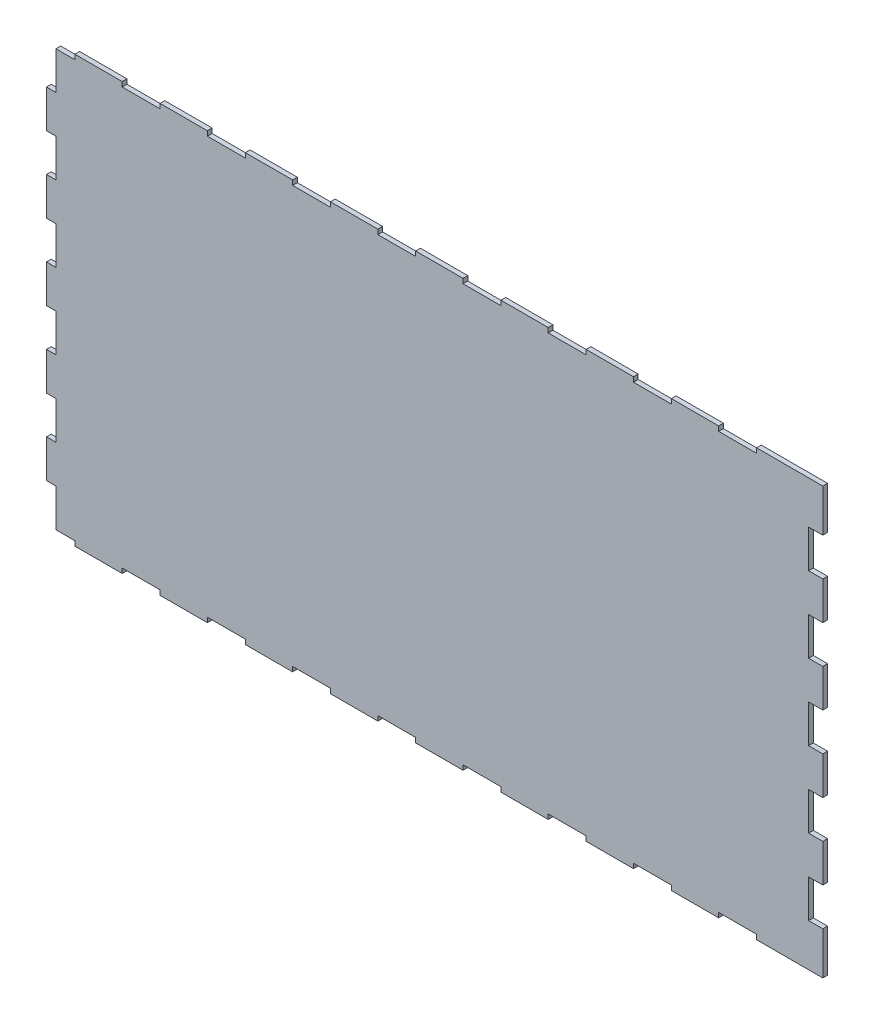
ISO-10303-21;
HEADER;
FILE_DESCRIPTION(('STEP AP214'),'2;1');
FILE_NAME('part.step','',(''),(''),'','','');
FILE_SCHEMA(('AUTOMOTIVE_DESIGN { 1 0 10303 214 1 1 1 1 }'));
ENDSEC;
DATA;
#1=APPLICATION_CONTEXT('core data for automotive mechanical design processes');
#2=APPLICATION_PROTOCOL_DEFINITION('international standard','automotive_design',2000,#1);
#3=PRODUCT_CONTEXT('',#1,'mechanical');
#4=PRODUCT('Part','Part','',(#3));
#5=PRODUCT_RELATED_PRODUCT_CATEGORY('part','',(#4));
#6=PRODUCT_DEFINITION_FORMATION('','',#4);
#7=PRODUCT_DEFINITION_CONTEXT('part definition',#1,'design');
#8=PRODUCT_DEFINITION('design','',#6,#7);
#9=PRODUCT_DEFINITION_SHAPE('','',#8);
#10=(LENGTH_UNIT() NAMED_UNIT(*) SI_UNIT(.MILLI.,.METRE.));
#11=(NAMED_UNIT(*) PLANE_ANGLE_UNIT() SI_UNIT($,.RADIAN.));
#12=(NAMED_UNIT(*) SI_UNIT($,.STERADIAN.) SOLID_ANGLE_UNIT());
#13=UNCERTAINTY_MEASURE_WITH_UNIT(LENGTH_MEASURE(1.E-05),#10,'distance_accuracy_value','');
#14=(GEOMETRIC_REPRESENTATION_CONTEXT(3) GLOBAL_UNCERTAINTY_ASSIGNED_CONTEXT((#13)) GLOBAL_UNIT_ASSIGNED_CONTEXT((#10,
#11,#12)) REPRESENTATION_CONTEXT('',''));
#15=CARTESIAN_POINT('',(0.,0.,0.));
#16=DIRECTION('',(0.,0.,1.));
#17=DIRECTION('',(1.,0.,0.));
#18=AXIS2_PLACEMENT_3D('',#15,#16,#17);
#19=CARTESIAN_POINT('',(110.,220.,5.));
#20=DIRECTION('',(0.,-1.,0.));
#21=DIRECTION('',(0.,0.,-1.));
#22=AXIS2_PLACEMENT_3D('',#19,#20,#21);
#23=PLANE('',#22);
#24=DIRECTION('',(0.,0.,1.));
#25=VECTOR('',#24,1.);
#26=CARTESIAN_POINT('',(90.,220.,0.));
#27=LINE('',#26,#25);
#28=CARTESIAN_POINT('',(90.,220.,0.));
#29=VERTEX_POINT('',#28);
#30=CARTESIAN_POINT('',(90.,220.,5.));
#31=VERTEX_POINT('',#30);
#32=EDGE_CURVE('E654',#29,#31,#27,.T.);
#33=ORIENTED_EDGE('',*,*,#32,.T.);
#34=DIRECTION('',(-1.,0.,0.));
#35=VECTOR('',#34,1.);
#36=CARTESIAN_POINT('',(110.,220.,5.));
#37=LINE('',#36,#35);
#38=CARTESIAN_POINT('',(110.,220.,5.));
#39=VERTEX_POINT('',#38);
#40=EDGE_CURVE('E1387',#39,#31,#37,.T.);
#41=ORIENTED_EDGE('',*,*,#40,.F.);
#42=DIRECTION('',(0.,0.,-1.));
#43=VECTOR('',#42,1.);
#44=CARTESIAN_POINT('',(110.,220.,5.));
#45=LINE('',#44,#43);
#46=CARTESIAN_POINT('',(110.,220.,0.));
#47=VERTEX_POINT('',#46);
#48=EDGE_CURVE('E1134',#39,#47,#45,.T.);
#49=ORIENTED_EDGE('',*,*,#48,.T.);
#50=DIRECTION('',(-1.,0.,0.));
#51=VECTOR('',#50,1.);
#52=CARTESIAN_POINT('',(110.,220.,0.));
#53=LINE('',#52,#51);
#54=EDGE_CURVE('E756',#47,#29,#53,.T.);
#55=ORIENTED_EDGE('',*,*,#54,.T.);
#56=EDGE_LOOP('',(#33,#41,#49,#55));
#57=FACE_BOUND('',#56,.T.);
#58=ADVANCED_FACE('F42',(#57),#23,.F.);
#59=CARTESIAN_POINT('',(110.,-220.,5.));
#60=DIRECTION('',(0.,1.,0.));
#61=DIRECTION('',(0.,0.,1.));
#62=AXIS2_PLACEMENT_3D('',#59,#60,#61);
#63=PLANE('',#62);
#64=DIRECTION('',(0.,0.,1.));
#65=VECTOR('',#64,1.);
#66=CARTESIAN_POINT('',(90.,-220.,0.));
#67=LINE('',#66,#65);
#68=CARTESIAN_POINT('',(90.,-220.,0.));
#69=VERTEX_POINT('',#68);
#70=CARTESIAN_POINT('',(90.,-220.,5.));
#71=VERTEX_POINT('',#70);
#72=EDGE_CURVE('E1562',#69,#71,#67,.T.);
#73=ORIENTED_EDGE('',*,*,#72,.F.);
#74=DIRECTION('',(1.,0.,0.));
#75=VECTOR('',#74,1.);
#76=CARTESIAN_POINT('',(110.,-220.,0.));
#77=LINE('',#76,#75);
#78=CARTESIAN_POINT('',(110.,-220.,0.));
#79=VERTEX_POINT('',#78);
#80=EDGE_CURVE('E760',#69,#79,#77,.T.);
#81=ORIENTED_EDGE('',*,*,#80,.T.);
#82=DIRECTION('',(0.,0.,-1.));
#83=VECTOR('',#82,1.);
#84=CARTESIAN_POINT('',(110.,-220.,5.));
#85=LINE('',#84,#83);
#86=CARTESIAN_POINT('',(110.,-220.,5.));
#87=VERTEX_POINT('',#86);
#88=EDGE_CURVE('E1130',#87,#79,#85,.T.);
#89=ORIENTED_EDGE('',*,*,#88,.F.);
#90=DIRECTION('',(1.,0.,0.));
#91=VECTOR('',#90,1.);
#92=CARTESIAN_POINT('',(110.,-220.,5.));
#93=LINE('',#92,#91);
#94=EDGE_CURVE('E1390',#71,#87,#93,.T.);
#95=ORIENTED_EDGE('',*,*,#94,.F.);
#96=EDGE_LOOP('',(#73,#81,#89,#95));
#97=FACE_BOUND('',#96,.T.);
#98=ADVANCED_FACE('F1936',(#97),#63,.F.);
#99=CARTESIAN_POINT('',(0.,0.,5.));
#100=DIRECTION('',(0.,0.,1.));
#101=DIRECTION('',(1.,0.,0.));
#102=AXIS2_PLACEMENT_3D('',#99,#100,#101);
#103=PLANE('',#102);
#104=ORIENTED_EDGE('',*,*,#40,.T.);
#105=DIRECTION('',(0.,-1.,0.));
#106=VECTOR('',#105,1.);
#107=CARTESIAN_POINT('',(90.,0.,5.));
#108=LINE('',#107,#106);
#109=CARTESIAN_POINT('',(90.,180.,5.));
#110=VERTEX_POINT('',#109);
#111=EDGE_CURVE('E1654',#31,#110,#108,.T.);
#112=ORIENTED_EDGE('',*,*,#111,.T.);
#113=DIRECTION('',(-1.,0.,0.));
#114=VECTOR('',#113,1.);
#115=CARTESIAN_POINT('',(0.,180.,5.));
#116=LINE('',#115,#114);
#117=CARTESIAN_POINT('',(80.,180.,5.));
#118=VERTEX_POINT('',#117);
#119=EDGE_CURVE('E1650',#110,#118,#116,.T.);
#120=ORIENTED_EDGE('',*,*,#119,.T.);
#121=DIRECTION('',(0.,-1.,0.));
#122=VECTOR('',#121,1.);
#123=CARTESIAN_POINT('',(80.,0.,5.));
#124=LINE('',#123,#122);
#125=CARTESIAN_POINT('',(80.,140.,5.));
#126=VERTEX_POINT('',#125);
#127=EDGE_CURVE('E1655',#118,#126,#124,.T.);
#128=ORIENTED_EDGE('',*,*,#127,.T.);
#129=DIRECTION('',(-1.,0.,0.));
#130=VECTOR('',#129,1.);
#131=CARTESIAN_POINT('',(-3.88578058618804E-13,140.,5.));
#132=LINE('',#131,#130);
#133=CARTESIAN_POINT('',(90.,140.,5.));
#134=VERTEX_POINT('',#133);
#135=EDGE_CURVE('E1659',#134,#126,#132,.T.);
#136=ORIENTED_EDGE('',*,*,#135,.F.);
#137=CARTESIAN_POINT('',(90.,100.,5.));
#138=VERTEX_POINT('',#137);
#139=EDGE_CURVE('E1663',#134,#138,#108,.T.);
#140=ORIENTED_EDGE('',*,*,#139,.T.);
#141=DIRECTION('',(-1.,0.,0.));
#142=VECTOR('',#141,1.);
#143=CARTESIAN_POINT('',(0.,100.,5.));
#144=LINE('',#143,#142);
#145=CARTESIAN_POINT('',(80.,100.,5.));
#146=VERTEX_POINT('',#145);
#147=EDGE_CURVE('E1667',#138,#146,#144,.T.);
#148=ORIENTED_EDGE('',*,*,#147,.T.);
#149=DIRECTION('',(0.,-1.,0.));
#150=VECTOR('',#149,1.);
#151=CARTESIAN_POINT('',(80.,0.,5.));
#152=LINE('',#151,#150);
#153=CARTESIAN_POINT('',(80.,60.,5.));
#154=VERTEX_POINT('',#153);
#155=EDGE_CURVE('E1671',#146,#154,#152,.T.);
#156=ORIENTED_EDGE('',*,*,#155,.T.);
#157=DIRECTION('',(-1.,0.,0.));
#158=VECTOR('',#157,1.);
#159=CARTESIAN_POINT('',(-1.66533453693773E-13,59.9999999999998,5.));
#160=LINE('',#159,#158);
#161=CARTESIAN_POINT('',(90.,60.,5.));
#162=VERTEX_POINT('',#161);
#163=EDGE_CURVE('E1675',#162,#154,#160,.T.);
#164=ORIENTED_EDGE('',*,*,#163,.F.);
#165=DIRECTION('',(0.,-1.,0.));
#166=VECTOR('',#165,1.);
#167=CARTESIAN_POINT('',(90.,0.,5.));
#168=LINE('',#167,#166);
#169=CARTESIAN_POINT('',(90.,20.,5.));
#170=VERTEX_POINT('',#169);
#171=EDGE_CURVE('E1679',#162,#170,#168,.T.);
#172=ORIENTED_EDGE('',*,*,#171,.T.);
#173=DIRECTION('',(-1.,0.,0.));
#174=VECTOR('',#173,1.);
#175=CARTESIAN_POINT('',(0.,20.,5.));
#176=LINE('',#175,#174);
#177=CARTESIAN_POINT('',(80.,20.,5.));
#178=VERTEX_POINT('',#177);
#179=EDGE_CURVE('E1683',#170,#178,#176,.T.);
#180=ORIENTED_EDGE('',*,*,#179,.T.);
#181=DIRECTION('',(0.,-1.,0.));
#182=VECTOR('',#181,1.);
#183=CARTESIAN_POINT('',(80.,0.,5.));
#184=LINE('',#183,#182);
#185=CARTESIAN_POINT('',(80.,-20.,5.));
#186=VERTEX_POINT('',#185);
#187=EDGE_CURVE('E1687',#178,#186,#184,.T.);
#188=ORIENTED_EDGE('',*,*,#187,.T.);
#189=DIRECTION('',(-1.,0.,0.));
#190=VECTOR('',#189,1.);
#191=CARTESIAN_POINT('',(0.,-20.0000000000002,5.));
#192=LINE('',#191,#190);
#193=CARTESIAN_POINT('',(90.,-20.,5.));
#194=VERTEX_POINT('',#193);
#195=EDGE_CURVE('E1691',#194,#186,#192,.T.);
#196=ORIENTED_EDGE('',*,*,#195,.F.);
#197=DIRECTION('',(0.,-1.,0.));
#198=VECTOR('',#197,1.);
#199=CARTESIAN_POINT('',(90.,0.,5.));
#200=LINE('',#199,#198);
#201=CARTESIAN_POINT('',(90.,-60.,5.));
#202=VERTEX_POINT('',#201);
#203=EDGE_CURVE('E1695',#194,#202,#200,.T.);
#204=ORIENTED_EDGE('',*,*,#203,.T.);
#205=DIRECTION('',(-1.,0.,0.));
#206=VECTOR('',#205,1.);
#207=CARTESIAN_POINT('',(0.,-60.,5.));
#208=LINE('',#207,#206);
#209=CARTESIAN_POINT('',(80.,-60.,5.));
#210=VERTEX_POINT('',#209);
#211=EDGE_CURVE('E1699',#202,#210,#208,.T.);
#212=ORIENTED_EDGE('',*,*,#211,.T.);
#213=DIRECTION('',(0.,-1.,0.));
#214=VECTOR('',#213,1.);
#215=CARTESIAN_POINT('',(80.,0.,5.));
#216=LINE('',#215,#214);
#217=CARTESIAN_POINT('',(80.,-100.,5.));
#218=VERTEX_POINT('',#217);
#219=EDGE_CURVE('E1703',#210,#218,#216,.T.);
#220=ORIENTED_EDGE('',*,*,#219,.T.);
#221=DIRECTION('',(-1.,0.,0.));
#222=VECTOR('',#221,1.);
#223=CARTESIAN_POINT('',(2.7755575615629E-13,-100.,5.));
#224=LINE('',#223,#222);
#225=CARTESIAN_POINT('',(90.,-100.,5.));
#226=VERTEX_POINT('',#225);
#227=EDGE_CURVE('E1707',#226,#218,#224,.T.);
#228=ORIENTED_EDGE('',*,*,#227,.F.);
#229=DIRECTION('',(0.,-1.,0.));
#230=VECTOR('',#229,1.);
#231=CARTESIAN_POINT('',(90.,0.,5.));
#232=LINE('',#231,#230);
#233=CARTESIAN_POINT('',(90.,-140.,5.));
#234=VERTEX_POINT('',#233);
#235=EDGE_CURVE('E1711',#226,#234,#232,.T.);
#236=ORIENTED_EDGE('',*,*,#235,.T.);
#237=DIRECTION('',(-1.,0.,0.));
#238=VECTOR('',#237,1.);
#239=CARTESIAN_POINT('',(0.,-140.,5.));
#240=LINE('',#239,#238);
#241=CARTESIAN_POINT('',(80.,-140.,5.));
#242=VERTEX_POINT('',#241);
#243=EDGE_CURVE('E1715',#234,#242,#240,.T.);
#244=ORIENTED_EDGE('',*,*,#243,.T.);
#245=DIRECTION('',(0.,-1.,0.));
#246=VECTOR('',#245,1.);
#247=CARTESIAN_POINT('',(80.,0.,5.));
#248=LINE('',#247,#246);
#249=CARTESIAN_POINT('',(80.,-180.,5.));
#250=VERTEX_POINT('',#249);
#251=EDGE_CURVE('E1719',#242,#250,#248,.T.);
#252=ORIENTED_EDGE('',*,*,#251,.T.);
#253=DIRECTION('',(-1.,0.,0.));
#254=VECTOR('',#253,1.);
#255=CARTESIAN_POINT('',(4.99600361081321E-13,-180.,5.));
#256=LINE('',#255,#254);
#257=CARTESIAN_POINT('',(90.,-180.,5.));
#258=VERTEX_POINT('',#257);
#259=EDGE_CURVE('E1723',#258,#250,#256,.T.);
#260=ORIENTED_EDGE('',*,*,#259,.F.);
#261=DIRECTION('',(0.,-1.,0.));
#262=VECTOR('',#261,1.);
#263=CARTESIAN_POINT('',(90.0000000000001,0.,5.));
#264=LINE('',#263,#262);
#265=EDGE_CURVE('E1727',#258,#71,#264,.T.);
#266=ORIENTED_EDGE('',*,*,#265,.T.);
#267=ORIENTED_EDGE('',*,*,#94,.T.);
#268=DIRECTION('',(0.,-1.,0.));
#269=VECTOR('',#268,1.);
#270=CARTESIAN_POINT('',(110.,-225.,5.));
#271=LINE('',#270,#269);
#272=CARTESIAN_POINT('',(110.,-225.,5.));
#273=VERTEX_POINT('',#272);
#274=EDGE_CURVE('E1393',#87,#273,#271,.T.);
#275=ORIENTED_EDGE('',*,*,#274,.T.);
#276=DIRECTION('',(1.,0.,0.));
#277=VECTOR('',#276,1.);
#278=CARTESIAN_POINT('',(160.,-225.,5.));
#279=LINE('',#278,#277);
#280=CARTESIAN_POINT('',(160.,-225.,5.));
#281=VERTEX_POINT('',#280);
#282=EDGE_CURVE('E1396',#273,#281,#279,.T.);
#283=ORIENTED_EDGE('',*,*,#282,.T.);
#284=DIRECTION('',(0.,1.,0.));
#285=VECTOR('',#284,1.);
#286=CARTESIAN_POINT('',(160.,-220.,5.));
#287=LINE('',#286,#285);
#288=CARTESIAN_POINT('',(160.,-220.,5.));
#289=VERTEX_POINT('',#288);
#290=EDGE_CURVE('E1399',#281,#289,#287,.T.);
#291=ORIENTED_EDGE('',*,*,#290,.T.);
#292=DIRECTION('',(1.,0.,0.));
#293=VECTOR('',#292,1.);
#294=CARTESIAN_POINT('',(200.,-220.,5.));
#295=LINE('',#294,#293);
#296=CARTESIAN_POINT('',(200.,-220.,5.));
#297=VERTEX_POINT('',#296);
#298=EDGE_CURVE('E1402',#289,#297,#295,.T.);
#299=ORIENTED_EDGE('',*,*,#298,.T.);
#300=DIRECTION('',(0.,-1.,0.));
#301=VECTOR('',#300,1.);
#302=CARTESIAN_POINT('',(200.,-225.,5.));
#303=LINE('',#302,#301);
#304=CARTESIAN_POINT('',(200.,-225.,5.));
#305=VERTEX_POINT('',#304);
#306=EDGE_CURVE('E1405',#297,#305,#303,.T.);
#307=ORIENTED_EDGE('',*,*,#306,.T.);
#308=DIRECTION('',(1.,0.,0.));
#309=VECTOR('',#308,1.);
#310=CARTESIAN_POINT('',(250.,-225.,5.));
#311=LINE('',#310,#309);
#312=CARTESIAN_POINT('',(250.,-225.,5.));
#313=VERTEX_POINT('',#312);
#314=EDGE_CURVE('E1408',#305,#313,#311,.T.);
#315=ORIENTED_EDGE('',*,*,#314,.T.);
#316=DIRECTION('',(0.,1.,0.));
#317=VECTOR('',#316,1.);
#318=CARTESIAN_POINT('',(250.,-220.,5.));
#319=LINE('',#318,#317);
#320=CARTESIAN_POINT('',(250.,-220.,5.));
#321=VERTEX_POINT('',#320);
#322=EDGE_CURVE('E1411',#313,#321,#319,.T.);
#323=ORIENTED_EDGE('',*,*,#322,.T.);
#324=DIRECTION('',(1.,0.,0.));
#325=VECTOR('',#324,1.);
#326=CARTESIAN_POINT('',(290.,-220.,5.));
#327=LINE('',#326,#325);
#328=CARTESIAN_POINT('',(290.,-220.,5.));
#329=VERTEX_POINT('',#328);
#330=EDGE_CURVE('E1414',#321,#329,#327,.T.);
#331=ORIENTED_EDGE('',*,*,#330,.T.);
#332=DIRECTION('',(0.,-1.,0.));
#333=VECTOR('',#332,1.);
#334=CARTESIAN_POINT('',(290.,-225.,5.));
#335=LINE('',#334,#333);
#336=CARTESIAN_POINT('',(290.,-225.,5.));
#337=VERTEX_POINT('',#336);
#338=EDGE_CURVE('E1417',#329,#337,#335,.T.);
#339=ORIENTED_EDGE('',*,*,#338,.T.);
#340=DIRECTION('',(1.,0.,0.));
#341=VECTOR('',#340,1.);
#342=CARTESIAN_POINT('',(340.,-225.,5.));
#343=LINE('',#342,#341);
#344=CARTESIAN_POINT('',(340.,-225.,5.));
#345=VERTEX_POINT('',#344);
#346=EDGE_CURVE('E1420',#337,#345,#343,.T.);
#347=ORIENTED_EDGE('',*,*,#346,.T.);
#348=DIRECTION('',(0.,1.,0.));
#349=VECTOR('',#348,1.);
#350=CARTESIAN_POINT('',(340.,-220.,5.));
#351=LINE('',#350,#349);
#352=CARTESIAN_POINT('',(340.,-220.,5.));
#353=VERTEX_POINT('',#352);
#354=EDGE_CURVE('E1423',#345,#353,#351,.T.);
#355=ORIENTED_EDGE('',*,*,#354,.T.);
#356=DIRECTION('',(1.,0.,0.));
#357=VECTOR('',#356,1.);
#358=CARTESIAN_POINT('',(380.,-220.,5.));
#359=LINE('',#358,#357);
#360=CARTESIAN_POINT('',(380.,-220.,5.));
#361=VERTEX_POINT('',#360);
#362=EDGE_CURVE('E1426',#353,#361,#359,.T.);
#363=ORIENTED_EDGE('',*,*,#362,.T.);
#364=DIRECTION('',(0.,-1.,0.));
#365=VECTOR('',#364,1.);
#366=CARTESIAN_POINT('',(380.,-225.,5.));
#367=LINE('',#366,#365);
#368=CARTESIAN_POINT('',(380.,-225.,5.));
#369=VERTEX_POINT('',#368);
#370=EDGE_CURVE('E1429',#361,#369,#367,.T.);
#371=ORIENTED_EDGE('',*,*,#370,.T.);
#372=DIRECTION('',(1.,0.,0.));
#373=VECTOR('',#372,1.);
#374=CARTESIAN_POINT('',(430.,-225.,5.));
#375=LINE('',#374,#373);
#376=CARTESIAN_POINT('',(430.,-225.,5.));
#377=VERTEX_POINT('',#376);
#378=EDGE_CURVE('E1432',#369,#377,#375,.T.);
#379=ORIENTED_EDGE('',*,*,#378,.T.);
#380=DIRECTION('',(0.,1.,0.));
#381=VECTOR('',#380,1.);
#382=CARTESIAN_POINT('',(430.,-220.,5.));
#383=LINE('',#382,#381);
#384=CARTESIAN_POINT('',(430.,-220.,5.));
#385=VERTEX_POINT('',#384);
#386=EDGE_CURVE('E1435',#377,#385,#383,.T.);
#387=ORIENTED_EDGE('',*,*,#386,.T.);
#388=DIRECTION('',(1.,0.,0.));
#389=VECTOR('',#388,1.);
#390=CARTESIAN_POINT('',(470.,-220.,5.));
#391=LINE('',#390,#389);
#392=CARTESIAN_POINT('',(470.,-220.,5.));
#393=VERTEX_POINT('',#392);
#394=EDGE_CURVE('E1438',#385,#393,#391,.T.);
#395=ORIENTED_EDGE('',*,*,#394,.T.);
#396=DIRECTION('',(0.,-1.,0.));
#397=VECTOR('',#396,1.);
#398=CARTESIAN_POINT('',(470.,-225.,5.));
#399=LINE('',#398,#397);
#400=CARTESIAN_POINT('',(470.,-225.,5.));
#401=VERTEX_POINT('',#400);
#402=EDGE_CURVE('E1441',#393,#401,#399,.T.);
#403=ORIENTED_EDGE('',*,*,#402,.T.);
#404=DIRECTION('',(1.,0.,0.));
#405=VECTOR('',#404,1.);
#406=CARTESIAN_POINT('',(520.,-225.,5.));
#407=LINE('',#406,#405);
#408=CARTESIAN_POINT('',(520.,-225.,5.));
#409=VERTEX_POINT('',#408);
#410=EDGE_CURVE('E1444',#401,#409,#407,.T.);
#411=ORIENTED_EDGE('',*,*,#410,.T.);
#412=DIRECTION('',(0.,1.,0.));
#413=VECTOR('',#412,1.);
#414=CARTESIAN_POINT('',(520.,-220.,5.));
#415=LINE('',#414,#413);
#416=CARTESIAN_POINT('',(520.,-220.,5.));
#417=VERTEX_POINT('',#416);
#418=EDGE_CURVE('E1447',#409,#417,#415,.T.);
#419=ORIENTED_EDGE('',*,*,#418,.T.);
#420=DIRECTION('',(1.,0.,0.));
#421=VECTOR('',#420,1.);
#422=CARTESIAN_POINT('',(560.,-220.,5.));
#423=LINE('',#422,#421);
#424=CARTESIAN_POINT('',(560.,-220.,5.));
#425=VERTEX_POINT('',#424);
#426=EDGE_CURVE('E1450',#417,#425,#423,.T.);
#427=ORIENTED_EDGE('',*,*,#426,.T.);
#428=DIRECTION('',(0.,-1.,0.));
#429=VECTOR('',#428,1.);
#430=CARTESIAN_POINT('',(560.,-225.,5.));
#431=LINE('',#430,#429);
#432=CARTESIAN_POINT('',(560.,-225.,5.));
#433=VERTEX_POINT('',#432);
#434=EDGE_CURVE('E1453',#425,#433,#431,.T.);
#435=ORIENTED_EDGE('',*,*,#434,.T.);
#436=DIRECTION('',(1.,0.,0.));
#437=VECTOR('',#436,1.);
#438=CARTESIAN_POINT('',(610.,-225.,5.));
#439=LINE('',#438,#437);
#440=CARTESIAN_POINT('',(610.,-225.,5.));
#441=VERTEX_POINT('',#440);
#442=EDGE_CURVE('E1456',#433,#441,#439,.T.);
#443=ORIENTED_EDGE('',*,*,#442,.T.);
#444=DIRECTION('',(0.,1.,0.));
#445=VECTOR('',#444,1.);
#446=CARTESIAN_POINT('',(610.,-220.,5.));
#447=LINE('',#446,#445);
#448=CARTESIAN_POINT('',(610.,-220.,5.));
#449=VERTEX_POINT('',#448);
#450=EDGE_CURVE('E1459',#441,#449,#447,.T.);
#451=ORIENTED_EDGE('',*,*,#450,.T.);
#452=DIRECTION('',(1.,0.,0.));
#453=VECTOR('',#452,1.);
#454=CARTESIAN_POINT('',(650.,-220.,5.));
#455=LINE('',#454,#453);
#456=CARTESIAN_POINT('',(650.,-220.,5.));
#457=VERTEX_POINT('',#456);
#458=EDGE_CURVE('E1462',#449,#457,#455,.T.);
#459=ORIENTED_EDGE('',*,*,#458,.T.);
#460=DIRECTION('',(0.,-1.,0.));
#461=VECTOR('',#460,1.);
#462=CARTESIAN_POINT('',(650.,-225.,5.));
#463=LINE('',#462,#461);
#464=CARTESIAN_POINT('',(650.,-225.,5.));
#465=VERTEX_POINT('',#464);
#466=EDGE_CURVE('E1465',#457,#465,#463,.T.);
#467=ORIENTED_EDGE('',*,*,#466,.T.);
#468=DIRECTION('',(1.,0.,0.));
#469=VECTOR('',#468,1.);
#470=CARTESIAN_POINT('',(700.,-225.,5.));
#471=LINE('',#470,#469);
#472=CARTESIAN_POINT('',(700.,-225.,5.));
#473=VERTEX_POINT('',#472);
#474=EDGE_CURVE('E1468',#465,#473,#471,.T.);
#475=ORIENTED_EDGE('',*,*,#474,.T.);
#476=DIRECTION('',(0.,1.,0.));
#477=VECTOR('',#476,1.);
#478=CARTESIAN_POINT('',(700.,-220.,5.));
#479=LINE('',#478,#477);
#480=CARTESIAN_POINT('',(700.,-220.,5.));
#481=VERTEX_POINT('',#480);
#482=EDGE_CURVE('E1471',#473,#481,#479,.T.);
#483=ORIENTED_EDGE('',*,*,#482,.T.);
#484=DIRECTION('',(1.,0.,0.));
#485=VECTOR('',#484,1.);
#486=CARTESIAN_POINT('',(740.,-220.,5.));
#487=LINE('',#486,#485);
#488=CARTESIAN_POINT('',(740.,-220.,5.));
#489=VERTEX_POINT('',#488);
#490=EDGE_CURVE('E1474',#481,#489,#487,.T.);
#491=ORIENTED_EDGE('',*,*,#490,.T.);
#492=DIRECTION('',(0.,-1.,0.));
#493=VECTOR('',#492,1.);
#494=CARTESIAN_POINT('',(740.,-225.,5.));
#495=LINE('',#494,#493);
#496=CARTESIAN_POINT('',(740.,-225.,5.));
#497=VERTEX_POINT('',#496);
#498=EDGE_CURVE('E1477',#489,#497,#495,.T.);
#499=ORIENTED_EDGE('',*,*,#498,.T.);
#500=DIRECTION('',(1.,0.,0.));
#501=VECTOR('',#500,1.);
#502=CARTESIAN_POINT('',(790.,-225.,5.));
#503=LINE('',#502,#501);
#504=CARTESIAN_POINT('',(790.,-225.,5.));
#505=VERTEX_POINT('',#504);
#506=EDGE_CURVE('E1480',#497,#505,#503,.T.);
#507=ORIENTED_EDGE('',*,*,#506,.T.);
#508=DIRECTION('',(0.,1.,0.));
#509=VECTOR('',#508,1.);
#510=CARTESIAN_POINT('',(790.,-220.,5.));
#511=LINE('',#510,#509);
#512=CARTESIAN_POINT('',(790.,-220.,5.));
#513=VERTEX_POINT('',#512);
#514=EDGE_CURVE('E1483',#505,#513,#511,.T.);
#515=ORIENTED_EDGE('',*,*,#514,.T.);
#516=DIRECTION('',(1.,0.,0.));
#517=VECTOR('',#516,1.);
#518=CARTESIAN_POINT('',(830.,-220.,5.));
#519=LINE('',#518,#517);
#520=CARTESIAN_POINT('',(830.,-220.,5.));
#521=VERTEX_POINT('',#520);
#522=EDGE_CURVE('E1486',#513,#521,#519,.T.);
#523=ORIENTED_EDGE('',*,*,#522,.T.);
#524=DIRECTION('',(0.,-1.,0.));
#525=VECTOR('',#524,1.);
#526=CARTESIAN_POINT('',(830.,-225.,5.));
#527=LINE('',#526,#525);
#528=CARTESIAN_POINT('',(830.,-225.,5.));
#529=VERTEX_POINT('',#528);
#530=EDGE_CURVE('E1489',#521,#529,#527,.T.);
#531=ORIENTED_EDGE('',*,*,#530,.T.);
#532=DIRECTION('',(1.,0.,0.));
#533=VECTOR('',#532,1.);
#534=CARTESIAN_POINT('',(900.,-225.,5.));
#535=LINE('',#534,#533);
#536=CARTESIAN_POINT('',(900.,-225.,5.));
#537=VERTEX_POINT('',#536);
#538=EDGE_CURVE('E1492',#529,#537,#535,.T.);
#539=ORIENTED_EDGE('',*,*,#538,.T.);
#540=DIRECTION('',(0.,1.,0.));
#541=VECTOR('',#540,1.);
#542=CARTESIAN_POINT('',(900.,-225.,5.));
#543=LINE('',#542,#541);
#544=CARTESIAN_POINT('',(900.,-180.,5.));
#545=VERTEX_POINT('',#544);
#546=EDGE_CURVE('E1495',#537,#545,#543,.T.);
#547=ORIENTED_EDGE('',*,*,#546,.T.);
#548=DIRECTION('',(-1.,0.,0.));
#549=VECTOR('',#548,1.);
#550=CARTESIAN_POINT('',(900.,-180.,5.));
#551=LINE('',#550,#549);
#552=CARTESIAN_POINT('',(885.,-180.,5.));
#553=VERTEX_POINT('',#552);
#554=EDGE_CURVE('E1498',#545,#553,#551,.T.);
#555=ORIENTED_EDGE('',*,*,#554,.T.);
#556=DIRECTION('',(0.,1.,0.));
#557=VECTOR('',#556,1.);
#558=CARTESIAN_POINT('',(885.,-180.,5.));
#559=LINE('',#558,#557);
#560=CARTESIAN_POINT('',(885.,-140.,5.));
#561=VERTEX_POINT('',#560);
#562=EDGE_CURVE('E1501',#553,#561,#559,.T.);
#563=ORIENTED_EDGE('',*,*,#562,.T.);
#564=DIRECTION('',(1.,0.,0.));
#565=VECTOR('',#564,1.);
#566=CARTESIAN_POINT('',(900.,-140.,5.));
#567=LINE('',#566,#565);
#568=CARTESIAN_POINT('',(900.,-140.,5.));
#569=VERTEX_POINT('',#568);
#570=EDGE_CURVE('E1504',#561,#569,#567,.T.);
#571=ORIENTED_EDGE('',*,*,#570,.T.);
#572=DIRECTION('',(0.,1.,0.));
#573=VECTOR('',#572,1.);
#574=CARTESIAN_POINT('',(900.,-140.,5.));
#575=LINE('',#574,#573);
#576=CARTESIAN_POINT('',(900.,-100.,5.));
#577=VERTEX_POINT('',#576);
#578=EDGE_CURVE('E1507',#569,#577,#575,.T.);
#579=ORIENTED_EDGE('',*,*,#578,.T.);
#580=DIRECTION('',(-1.,0.,0.));
#581=VECTOR('',#580,1.);
#582=CARTESIAN_POINT('',(900.,-100.,5.));
#583=LINE('',#582,#581);
#584=CARTESIAN_POINT('',(885.,-100.,5.));
#585=VERTEX_POINT('',#584);
#586=EDGE_CURVE('E1510',#577,#585,#583,.T.);
#587=ORIENTED_EDGE('',*,*,#586,.T.);
#588=DIRECTION('',(0.,1.,0.));
#589=VECTOR('',#588,1.);
#590=CARTESIAN_POINT('',(885.,-100.,5.));
#591=LINE('',#590,#589);
#592=CARTESIAN_POINT('',(885.,-60.,5.));
#593=VERTEX_POINT('',#592);
#594=EDGE_CURVE('E1513',#585,#593,#591,.T.);
#595=ORIENTED_EDGE('',*,*,#594,.T.);
#596=DIRECTION('',(1.,0.,0.));
#597=VECTOR('',#596,1.);
#598=CARTESIAN_POINT('',(900.,-60.,5.));
#599=LINE('',#598,#597);
#600=CARTESIAN_POINT('',(900.,-60.,5.));
#601=VERTEX_POINT('',#600);
#602=EDGE_CURVE('E1516',#593,#601,#599,.T.);
#603=ORIENTED_EDGE('',*,*,#602,.T.);
#604=DIRECTION('',(0.,1.,0.));
#605=VECTOR('',#604,1.);
#606=CARTESIAN_POINT('',(900.,-60.,5.));
#607=LINE('',#606,#605);
#608=CARTESIAN_POINT('',(900.,-20.,5.));
#609=VERTEX_POINT('',#608);
#610=EDGE_CURVE('E1519',#601,#609,#607,.T.);
#611=ORIENTED_EDGE('',*,*,#610,.T.);
#612=DIRECTION('',(-1.,0.,0.));
#613=VECTOR('',#612,1.);
#614=CARTESIAN_POINT('',(900.,-20.,5.));
#615=LINE('',#614,#613);
#616=CARTESIAN_POINT('',(885.,-20.,5.));
#617=VERTEX_POINT('',#616);
#618=EDGE_CURVE('E1522',#609,#617,#615,.T.);
#619=ORIENTED_EDGE('',*,*,#618,.T.);
#620=DIRECTION('',(0.,1.,0.));
#621=VECTOR('',#620,1.);
#622=CARTESIAN_POINT('',(885.,-20.,5.));
#623=LINE('',#622,#621);
#624=CARTESIAN_POINT('',(885.,20.,5.));
#625=VERTEX_POINT('',#624);
#626=EDGE_CURVE('E1525',#617,#625,#623,.T.);
#627=ORIENTED_EDGE('',*,*,#626,.T.);
#628=DIRECTION('',(1.,0.,0.));
#629=VECTOR('',#628,1.);
#630=CARTESIAN_POINT('',(900.,20.,5.));
#631=LINE('',#630,#629);
#632=CARTESIAN_POINT('',(900.,20.,5.));
#633=VERTEX_POINT('',#632);
#634=EDGE_CURVE('E1528',#625,#633,#631,.T.);
#635=ORIENTED_EDGE('',*,*,#634,.T.);
#636=DIRECTION('',(0.,1.,0.));
#637=VECTOR('',#636,1.);
#638=CARTESIAN_POINT('',(900.,20.,5.));
#639=LINE('',#638,#637);
#640=CARTESIAN_POINT('',(900.,60.,5.));
#641=VERTEX_POINT('',#640);
#642=EDGE_CURVE('E1531',#633,#641,#639,.T.);
#643=ORIENTED_EDGE('',*,*,#642,.T.);
#644=DIRECTION('',(-1.,0.,0.));
#645=VECTOR('',#644,1.);
#646=CARTESIAN_POINT('',(900.,60.,5.));
#647=LINE('',#646,#645);
#648=CARTESIAN_POINT('',(885.,60.,5.));
#649=VERTEX_POINT('',#648);
#650=EDGE_CURVE('E1534',#641,#649,#647,.T.);
#651=ORIENTED_EDGE('',*,*,#650,.T.);
#652=DIRECTION('',(0.,1.,0.));
#653=VECTOR('',#652,1.);
#654=CARTESIAN_POINT('',(885.,60.,5.));
#655=LINE('',#654,#653);
#656=CARTESIAN_POINT('',(885.,100.,5.));
#657=VERTEX_POINT('',#656);
#658=EDGE_CURVE('E1537',#649,#657,#655,.T.);
#659=ORIENTED_EDGE('',*,*,#658,.T.);
#660=DIRECTION('',(1.,0.,0.));
#661=VECTOR('',#660,1.);
#662=CARTESIAN_POINT('',(900.,100.,5.));
#663=LINE('',#662,#661);
#664=CARTESIAN_POINT('',(900.,100.,5.));
#665=VERTEX_POINT('',#664);
#666=EDGE_CURVE('E1540',#657,#665,#663,.T.);
#667=ORIENTED_EDGE('',*,*,#666,.T.);
#668=DIRECTION('',(0.,1.,0.));
#669=VECTOR('',#668,1.);
#670=CARTESIAN_POINT('',(900.,100.,5.));
#671=LINE('',#670,#669);
#672=CARTESIAN_POINT('',(900.,140.,5.));
#673=VERTEX_POINT('',#672);
#674=EDGE_CURVE('E624',#665,#673,#671,.T.);
#675=ORIENTED_EDGE('',*,*,#674,.T.);
#676=DIRECTION('',(-1.,0.,0.));
#677=VECTOR('',#676,1.);
#678=CARTESIAN_POINT('',(900.,140.,5.));
#679=LINE('',#678,#677);
#680=CARTESIAN_POINT('',(885.,140.,5.));
#681=VERTEX_POINT('',#680);
#682=EDGE_CURVE('E616',#673,#681,#679,.T.);
#683=ORIENTED_EDGE('',*,*,#682,.T.);
#684=DIRECTION('',(0.,1.,0.));
#685=VECTOR('',#684,1.);
#686=CARTESIAN_POINT('',(885.,140.,5.));
#687=LINE('',#686,#685);
#688=CARTESIAN_POINT('',(885.,180.,5.));
#689=VERTEX_POINT('',#688);
#690=EDGE_CURVE('E621',#681,#689,#687,.T.);
#691=ORIENTED_EDGE('',*,*,#690,.T.);
#692=DIRECTION('',(1.,0.,0.));
#693=VECTOR('',#692,1.);
#694=CARTESIAN_POINT('',(900.,180.,5.));
#695=LINE('',#694,#693);
#696=CARTESIAN_POINT('',(900.,180.,5.));
#697=VERTEX_POINT('',#696);
#698=EDGE_CURVE('E67',#689,#697,#695,.T.);
#699=ORIENTED_EDGE('',*,*,#698,.T.);
#700=DIRECTION('',(0.,1.,0.));
#701=VECTOR('',#700,1.);
#702=CARTESIAN_POINT('',(900.,180.,5.));
#703=LINE('',#702,#701);
#704=CARTESIAN_POINT('',(900.,225.,5.));
#705=VERTEX_POINT('',#704);
#706=EDGE_CURVE('E923',#697,#705,#703,.T.);
#707=ORIENTED_EDGE('',*,*,#706,.T.);
#708=DIRECTION('',(-1.,0.,0.));
#709=VECTOR('',#708,1.);
#710=CARTESIAN_POINT('',(900.,225.,5.));
#711=LINE('',#710,#709);
#712=CARTESIAN_POINT('',(830.,225.,5.));
#713=VERTEX_POINT('',#712);
#714=EDGE_CURVE('E354',#705,#713,#711,.T.);
#715=ORIENTED_EDGE('',*,*,#714,.T.);
#716=DIRECTION('',(0.,-1.,0.));
#717=VECTOR('',#716,1.);
#718=CARTESIAN_POINT('',(830.,225.,5.));
#719=LINE('',#718,#717);
#720=CARTESIAN_POINT('',(830.,220.,5.));
#721=VERTEX_POINT('',#720);
#722=EDGE_CURVE('E1272',#713,#721,#719,.T.);
#723=ORIENTED_EDGE('',*,*,#722,.T.);
#724=DIRECTION('',(-1.,0.,0.));
#725=VECTOR('',#724,1.);
#726=CARTESIAN_POINT('',(830.,220.,5.));
#727=LINE('',#726,#725);
#728=CARTESIAN_POINT('',(790.,220.,5.));
#729=VERTEX_POINT('',#728);
#730=EDGE_CURVE('E1292',#721,#729,#727,.T.);
#731=ORIENTED_EDGE('',*,*,#730,.T.);
#732=DIRECTION('',(0.,1.,0.));
#733=VECTOR('',#732,1.);
#734=CARTESIAN_POINT('',(790.,225.,5.));
#735=LINE('',#734,#733);
#736=CARTESIAN_POINT('',(790.,225.,5.));
#737=VERTEX_POINT('',#736);
#738=EDGE_CURVE('E1288',#729,#737,#735,.T.);
#739=ORIENTED_EDGE('',*,*,#738,.T.);
#740=DIRECTION('',(-1.,0.,0.));
#741=VECTOR('',#740,1.);
#742=CARTESIAN_POINT('',(790.,225.,5.));
#743=LINE('',#742,#741);
#744=CARTESIAN_POINT('',(740.,225.,5.));
#745=VERTEX_POINT('',#744);
#746=EDGE_CURVE('E1291',#737,#745,#743,.T.);
#747=ORIENTED_EDGE('',*,*,#746,.T.);
#748=DIRECTION('',(0.,-1.,0.));
#749=VECTOR('',#748,1.);
#750=CARTESIAN_POINT('',(740.,225.,5.));
#751=LINE('',#750,#749);
#752=CARTESIAN_POINT('',(740.,220.,5.));
#753=VERTEX_POINT('',#752);
#754=EDGE_CURVE('E1296',#745,#753,#751,.T.);
#755=ORIENTED_EDGE('',*,*,#754,.T.);
#756=DIRECTION('',(-1.,0.,0.));
#757=VECTOR('',#756,1.);
#758=CARTESIAN_POINT('',(740.,220.,5.));
#759=LINE('',#758,#757);
#760=CARTESIAN_POINT('',(700.,220.,5.));
#761=VERTEX_POINT('',#760);
#762=EDGE_CURVE('E1303',#753,#761,#759,.T.);
#763=ORIENTED_EDGE('',*,*,#762,.T.);
#764=DIRECTION('',(0.,1.,0.));
#765=VECTOR('',#764,1.);
#766=CARTESIAN_POINT('',(700.,225.,5.));
#767=LINE('',#766,#765);
#768=CARTESIAN_POINT('',(700.,225.,5.));
#769=VERTEX_POINT('',#768);
#770=EDGE_CURVE('E1306',#761,#769,#767,.T.);
#771=ORIENTED_EDGE('',*,*,#770,.T.);
#772=DIRECTION('',(-1.,0.,0.));
#773=VECTOR('',#772,1.);
#774=CARTESIAN_POINT('',(700.,225.,5.));
#775=LINE('',#774,#773);
#776=CARTESIAN_POINT('',(650.,225.,5.));
#777=VERTEX_POINT('',#776);
#778=EDGE_CURVE('E1309',#769,#777,#775,.T.);
#779=ORIENTED_EDGE('',*,*,#778,.T.);
#780=DIRECTION('',(0.,-1.,0.));
#781=VECTOR('',#780,1.);
#782=CARTESIAN_POINT('',(650.,225.,5.));
#783=LINE('',#782,#781);
#784=CARTESIAN_POINT('',(650.,220.,5.));
#785=VERTEX_POINT('',#784);
#786=EDGE_CURVE('E1312',#777,#785,#783,.T.);
#787=ORIENTED_EDGE('',*,*,#786,.T.);
#788=DIRECTION('',(-1.,0.,0.));
#789=VECTOR('',#788,1.);
#790=CARTESIAN_POINT('',(650.,220.,5.));
#791=LINE('',#790,#789);
#792=CARTESIAN_POINT('',(610.,220.,5.));
#793=VERTEX_POINT('',#792);
#794=EDGE_CURVE('E1315',#785,#793,#791,.T.);
#795=ORIENTED_EDGE('',*,*,#794,.T.);
#796=DIRECTION('',(0.,1.,0.));
#797=VECTOR('',#796,1.);
#798=CARTESIAN_POINT('',(610.,225.,5.));
#799=LINE('',#798,#797);
#800=CARTESIAN_POINT('',(610.,225.,5.));
#801=VERTEX_POINT('',#800);
#802=EDGE_CURVE('E1318',#793,#801,#799,.T.);
#803=ORIENTED_EDGE('',*,*,#802,.T.);
#804=DIRECTION('',(-1.,0.,0.));
#805=VECTOR('',#804,1.);
#806=CARTESIAN_POINT('',(610.,225.,5.));
#807=LINE('',#806,#805);
#808=CARTESIAN_POINT('',(560.,225.,5.));
#809=VERTEX_POINT('',#808);
#810=EDGE_CURVE('E1321',#801,#809,#807,.T.);
#811=ORIENTED_EDGE('',*,*,#810,.T.);
#812=DIRECTION('',(0.,-1.,0.));
#813=VECTOR('',#812,1.);
#814=CARTESIAN_POINT('',(560.,225.,5.));
#815=LINE('',#814,#813);
#816=CARTESIAN_POINT('',(560.,220.,5.));
#817=VERTEX_POINT('',#816);
#818=EDGE_CURVE('E1324',#809,#817,#815,.T.);
#819=ORIENTED_EDGE('',*,*,#818,.T.);
#820=DIRECTION('',(-1.,0.,0.));
#821=VECTOR('',#820,1.);
#822=CARTESIAN_POINT('',(560.,220.,5.));
#823=LINE('',#822,#821);
#824=CARTESIAN_POINT('',(520.,220.,5.));
#825=VERTEX_POINT('',#824);
#826=EDGE_CURVE('E1327',#817,#825,#823,.T.);
#827=ORIENTED_EDGE('',*,*,#826,.T.);
#828=DIRECTION('',(0.,1.,0.));
#829=VECTOR('',#828,1.);
#830=CARTESIAN_POINT('',(520.,225.,5.));
#831=LINE('',#830,#829);
#832=CARTESIAN_POINT('',(520.,225.,5.));
#833=VERTEX_POINT('',#832);
#834=EDGE_CURVE('E1330',#825,#833,#831,.T.);
#835=ORIENTED_EDGE('',*,*,#834,.T.);
#836=DIRECTION('',(-1.,0.,0.));
#837=VECTOR('',#836,1.);
#838=CARTESIAN_POINT('',(520.,225.,5.));
#839=LINE('',#838,#837);
#840=CARTESIAN_POINT('',(470.,225.,5.));
#841=VERTEX_POINT('',#840);
#842=EDGE_CURVE('E1333',#833,#841,#839,.T.);
#843=ORIENTED_EDGE('',*,*,#842,.T.);
#844=DIRECTION('',(0.,-1.,0.));
#845=VECTOR('',#844,1.);
#846=CARTESIAN_POINT('',(470.,225.,5.));
#847=LINE('',#846,#845);
#848=CARTESIAN_POINT('',(470.,220.,5.));
#849=VERTEX_POINT('',#848);
#850=EDGE_CURVE('E1336',#841,#849,#847,.T.);
#851=ORIENTED_EDGE('',*,*,#850,.T.);
#852=DIRECTION('',(-1.,0.,0.));
#853=VECTOR('',#852,1.);
#854=CARTESIAN_POINT('',(470.,220.,5.));
#855=LINE('',#854,#853);
#856=CARTESIAN_POINT('',(430.,220.,5.));
#857=VERTEX_POINT('',#856);
#858=EDGE_CURVE('E1339',#849,#857,#855,.T.);
#859=ORIENTED_EDGE('',*,*,#858,.T.);
#860=DIRECTION('',(0.,1.,0.));
#861=VECTOR('',#860,1.);
#862=CARTESIAN_POINT('',(430.,225.,5.));
#863=LINE('',#862,#861);
#864=CARTESIAN_POINT('',(430.,225.,5.));
#865=VERTEX_POINT('',#864);
#866=EDGE_CURVE('E1342',#857,#865,#863,.T.);
#867=ORIENTED_EDGE('',*,*,#866,.T.);
#868=DIRECTION('',(-1.,0.,0.));
#869=VECTOR('',#868,1.);
#870=CARTESIAN_POINT('',(430.,225.,5.));
#871=LINE('',#870,#869);
#872=CARTESIAN_POINT('',(380.,225.,5.));
#873=VERTEX_POINT('',#872);
#874=EDGE_CURVE('E1345',#865,#873,#871,.T.);
#875=ORIENTED_EDGE('',*,*,#874,.T.);
#876=DIRECTION('',(0.,-1.,0.));
#877=VECTOR('',#876,1.);
#878=CARTESIAN_POINT('',(380.,225.,5.));
#879=LINE('',#878,#877);
#880=CARTESIAN_POINT('',(380.,220.,5.));
#881=VERTEX_POINT('',#880);
#882=EDGE_CURVE('E1348',#873,#881,#879,.T.);
#883=ORIENTED_EDGE('',*,*,#882,.T.);
#884=DIRECTION('',(-1.,0.,0.));
#885=VECTOR('',#884,1.);
#886=CARTESIAN_POINT('',(380.,220.,5.));
#887=LINE('',#886,#885);
#888=CARTESIAN_POINT('',(340.,220.,5.));
#889=VERTEX_POINT('',#888);
#890=EDGE_CURVE('E1351',#881,#889,#887,.T.);
#891=ORIENTED_EDGE('',*,*,#890,.T.);
#892=DIRECTION('',(0.,1.,0.));
#893=VECTOR('',#892,1.);
#894=CARTESIAN_POINT('',(340.,225.,5.));
#895=LINE('',#894,#893);
#896=CARTESIAN_POINT('',(340.,225.,5.));
#897=VERTEX_POINT('',#896);
#898=EDGE_CURVE('E1354',#889,#897,#895,.T.);
#899=ORIENTED_EDGE('',*,*,#898,.T.);
#900=DIRECTION('',(-1.,0.,0.));
#901=VECTOR('',#900,1.);
#902=CARTESIAN_POINT('',(340.,225.,5.));
#903=LINE('',#902,#901);
#904=CARTESIAN_POINT('',(290.,225.,5.));
#905=VERTEX_POINT('',#904);
#906=EDGE_CURVE('E1357',#897,#905,#903,.T.);
#907=ORIENTED_EDGE('',*,*,#906,.T.);
#908=DIRECTION('',(0.,-1.,0.));
#909=VECTOR('',#908,1.);
#910=CARTESIAN_POINT('',(290.,225.,5.));
#911=LINE('',#910,#909);
#912=CARTESIAN_POINT('',(290.,220.,5.));
#913=VERTEX_POINT('',#912);
#914=EDGE_CURVE('E1360',#905,#913,#911,.T.);
#915=ORIENTED_EDGE('',*,*,#914,.T.);
#916=DIRECTION('',(-1.,0.,0.));
#917=VECTOR('',#916,1.);
#918=CARTESIAN_POINT('',(290.,220.,5.));
#919=LINE('',#918,#917);
#920=CARTESIAN_POINT('',(250.,220.,5.));
#921=VERTEX_POINT('',#920);
#922=EDGE_CURVE('E1363',#913,#921,#919,.T.);
#923=ORIENTED_EDGE('',*,*,#922,.T.);
#924=DIRECTION('',(0.,1.,0.));
#925=VECTOR('',#924,1.);
#926=CARTESIAN_POINT('',(250.,225.,5.));
#927=LINE('',#926,#925);
#928=CARTESIAN_POINT('',(250.,225.,5.));
#929=VERTEX_POINT('',#928);
#930=EDGE_CURVE('E1366',#921,#929,#927,.T.);
#931=ORIENTED_EDGE('',*,*,#930,.T.);
#932=DIRECTION('',(-1.,0.,0.));
#933=VECTOR('',#932,1.);
#934=CARTESIAN_POINT('',(250.,225.,5.));
#935=LINE('',#934,#933);
#936=CARTESIAN_POINT('',(200.,225.,5.));
#937=VERTEX_POINT('',#936);
#938=EDGE_CURVE('E1369',#929,#937,#935,.T.);
#939=ORIENTED_EDGE('',*,*,#938,.T.);
#940=DIRECTION('',(0.,-1.,0.));
#941=VECTOR('',#940,1.);
#942=CARTESIAN_POINT('',(200.,225.,5.));
#943=LINE('',#942,#941);
#944=CARTESIAN_POINT('',(200.,220.,5.));
#945=VERTEX_POINT('',#944);
#946=EDGE_CURVE('E1372',#937,#945,#943,.T.);
#947=ORIENTED_EDGE('',*,*,#946,.T.);
#948=DIRECTION('',(-1.,0.,0.));
#949=VECTOR('',#948,1.);
#950=CARTESIAN_POINT('',(200.,220.,5.));
#951=LINE('',#950,#949);
#952=CARTESIAN_POINT('',(160.,220.,5.));
#953=VERTEX_POINT('',#952);
#954=EDGE_CURVE('E1375',#945,#953,#951,.T.);
#955=ORIENTED_EDGE('',*,*,#954,.T.);
#956=DIRECTION('',(0.,1.,0.));
#957=VECTOR('',#956,1.);
#958=CARTESIAN_POINT('',(160.,225.,5.));
#959=LINE('',#958,#957);
#960=CARTESIAN_POINT('',(160.,225.,5.));
#961=VERTEX_POINT('',#960);
#962=EDGE_CURVE('E1378',#953,#961,#959,.T.);
#963=ORIENTED_EDGE('',*,*,#962,.T.);
#964=DIRECTION('',(-1.,0.,0.));
#965=VECTOR('',#964,1.);
#966=CARTESIAN_POINT('',(160.,225.,5.));
#967=LINE('',#966,#965);
#968=CARTESIAN_POINT('',(110.,225.,5.));
#969=VERTEX_POINT('',#968);
#970=EDGE_CURVE('E1381',#961,#969,#967,.T.);
#971=ORIENTED_EDGE('',*,*,#970,.T.);
#972=DIRECTION('',(0.,-1.,0.));
#973=VECTOR('',#972,1.);
#974=CARTESIAN_POINT('',(110.,225.,5.));
#975=LINE('',#974,#973);
#976=EDGE_CURVE('E1384',#969,#39,#975,.T.);
#977=ORIENTED_EDGE('',*,*,#976,.T.);
#978=EDGE_LOOP('',(#104,#112,#120,#128,#136,#140,#148,#156,#164,#172,#180,#188,#196,#204,#212,
#220,#228,#236,#244,#252,#260,#266,#267,#275,#283,#291,#299,#307,#315,#323,#331,#339,#347,#355,
#363,#371,#379,#387,#395,#403,#411,#419,#427,#435,#443,#451,#459,#467,#475,#483,#491,#499,#507,
#515,#523,#531,#539,#547,#555,#563,#571,#579,#587,#595,#603,#611,#619,#627,#635,#643,#651,#659,
#667,#675,#683,#691,#699,#707,#715,#723,#731,#739,#747,#755,#763,#771,#779,#787,#795,#803,#811,
#819,#827,#835,#843,#851,#859,#867,#875,#883,#891,#899,#907,#915,#923,#931,#939,#947,#955,#963,
#971,#977));
#979=FACE_BOUND('',#978,.T.);
#980=ADVANCED_FACE('F619',(#979),#103,.T.);
#981=CARTESIAN_POINT('',(0.,0.,0.));
#982=DIRECTION('',(0.,0.,1.));
#983=DIRECTION('',(1.,0.,0.));
#984=AXIS2_PLACEMENT_3D('',#981,#982,#983);
#985=PLANE('',#984);
#986=DIRECTION('',(0.,-1.,0.));
#987=VECTOR('',#986,1.);
#988=CARTESIAN_POINT('',(90.,0.,0.));
#989=LINE('',#988,#987);
#990=CARTESIAN_POINT('',(90.,180.,0.));
#991=VERTEX_POINT('',#990);
#992=EDGE_CURVE('E1568',#29,#991,#989,.T.);
#993=ORIENTED_EDGE('',*,*,#992,.F.);
#994=ORIENTED_EDGE('',*,*,#54,.F.);
#995=DIRECTION('',(0.,-1.,0.));
#996=VECTOR('',#995,1.);
#997=CARTESIAN_POINT('',(110.,225.,0.));
#998=LINE('',#997,#996);
#999=CARTESIAN_POINT('',(110.,225.,0.));
#1000=VERTEX_POINT('',#999);
#1001=EDGE_CURVE('E753',#1000,#47,#998,.T.);
#1002=ORIENTED_EDGE('',*,*,#1001,.F.);
#1003=DIRECTION('',(-1.,0.,0.));
#1004=VECTOR('',#1003,1.);
#1005=CARTESIAN_POINT('',(160.,225.,0.));
#1006=LINE('',#1005,#1004);
#1007=CARTESIAN_POINT('',(160.,225.,0.));
#1008=VERTEX_POINT('',#1007);
#1009=EDGE_CURVE('E750',#1008,#1000,#1006,.T.);
#1010=ORIENTED_EDGE('',*,*,#1009,.F.);
#1011=DIRECTION('',(0.,1.,0.));
#1012=VECTOR('',#1011,1.);
#1013=CARTESIAN_POINT('',(160.,225.,0.));
#1014=LINE('',#1013,#1012);
#1015=CARTESIAN_POINT('',(160.,220.,0.));
#1016=VERTEX_POINT('',#1015);
#1017=EDGE_CURVE('E747',#1016,#1008,#1014,.T.);
#1018=ORIENTED_EDGE('',*,*,#1017,.F.);
#1019=DIRECTION('',(-1.,0.,0.));
#1020=VECTOR('',#1019,1.);
#1021=CARTESIAN_POINT('',(200.,220.,0.));
#1022=LINE('',#1021,#1020);
#1023=CARTESIAN_POINT('',(200.,220.,0.));
#1024=VERTEX_POINT('',#1023);
#1025=EDGE_CURVE('E744',#1024,#1016,#1022,.T.);
#1026=ORIENTED_EDGE('',*,*,#1025,.F.);
#1027=DIRECTION('',(0.,-1.,0.));
#1028=VECTOR('',#1027,1.);
#1029=CARTESIAN_POINT('',(200.,225.,0.));
#1030=LINE('',#1029,#1028);
#1031=CARTESIAN_POINT('',(200.,225.,0.));
#1032=VERTEX_POINT('',#1031);
#1033=EDGE_CURVE('E741',#1032,#1024,#1030,.T.);
#1034=ORIENTED_EDGE('',*,*,#1033,.F.);
#1035=DIRECTION('',(-1.,0.,0.));
#1036=VECTOR('',#1035,1.);
#1037=CARTESIAN_POINT('',(250.,225.,0.));
#1038=LINE('',#1037,#1036);
#1039=CARTESIAN_POINT('',(250.,225.,0.));
#1040=VERTEX_POINT('',#1039);
#1041=EDGE_CURVE('E738',#1040,#1032,#1038,.T.);
#1042=ORIENTED_EDGE('',*,*,#1041,.F.);
#1043=DIRECTION('',(0.,1.,0.));
#1044=VECTOR('',#1043,1.);
#1045=CARTESIAN_POINT('',(250.,225.,0.));
#1046=LINE('',#1045,#1044);
#1047=CARTESIAN_POINT('',(250.,220.,0.));
#1048=VERTEX_POINT('',#1047);
#1049=EDGE_CURVE('E735',#1048,#1040,#1046,.T.);
#1050=ORIENTED_EDGE('',*,*,#1049,.F.);
#1051=DIRECTION('',(-1.,0.,0.));
#1052=VECTOR('',#1051,1.);
#1053=CARTESIAN_POINT('',(290.,220.,0.));
#1054=LINE('',#1053,#1052);
#1055=CARTESIAN_POINT('',(290.,220.,0.));
#1056=VERTEX_POINT('',#1055);
#1057=EDGE_CURVE('E732',#1056,#1048,#1054,.T.);
#1058=ORIENTED_EDGE('',*,*,#1057,.F.);
#1059=DIRECTION('',(0.,-1.,0.));
#1060=VECTOR('',#1059,1.);
#1061=CARTESIAN_POINT('',(290.,225.,0.));
#1062=LINE('',#1061,#1060);
#1063=CARTESIAN_POINT('',(290.,225.,0.));
#1064=VERTEX_POINT('',#1063);
#1065=EDGE_CURVE('E729',#1064,#1056,#1062,.T.);
#1066=ORIENTED_EDGE('',*,*,#1065,.F.);
#1067=DIRECTION('',(-1.,0.,0.));
#1068=VECTOR('',#1067,1.);
#1069=CARTESIAN_POINT('',(340.,225.,0.));
#1070=LINE('',#1069,#1068);
#1071=CARTESIAN_POINT('',(340.,225.,0.));
#1072=VERTEX_POINT('',#1071);
#1073=EDGE_CURVE('E726',#1072,#1064,#1070,.T.);
#1074=ORIENTED_EDGE('',*,*,#1073,.F.);
#1075=DIRECTION('',(0.,1.,0.));
#1076=VECTOR('',#1075,1.);
#1077=CARTESIAN_POINT('',(340.,225.,0.));
#1078=LINE('',#1077,#1076);
#1079=CARTESIAN_POINT('',(340.,220.,0.));
#1080=VERTEX_POINT('',#1079);
#1081=EDGE_CURVE('E723',#1080,#1072,#1078,.T.);
#1082=ORIENTED_EDGE('',*,*,#1081,.F.);
#1083=DIRECTION('',(-1.,0.,0.));
#1084=VECTOR('',#1083,1.);
#1085=CARTESIAN_POINT('',(380.,220.,0.));
#1086=LINE('',#1085,#1084);
#1087=CARTESIAN_POINT('',(380.,220.,0.));
#1088=VERTEX_POINT('',#1087);
#1089=EDGE_CURVE('E720',#1088,#1080,#1086,.T.);
#1090=ORIENTED_EDGE('',*,*,#1089,.F.);
#1091=DIRECTION('',(0.,-1.,0.));
#1092=VECTOR('',#1091,1.);
#1093=CARTESIAN_POINT('',(380.,225.,0.));
#1094=LINE('',#1093,#1092);
#1095=CARTESIAN_POINT('',(380.,225.,0.));
#1096=VERTEX_POINT('',#1095);
#1097=EDGE_CURVE('E717',#1096,#1088,#1094,.T.);
#1098=ORIENTED_EDGE('',*,*,#1097,.F.);
#1099=DIRECTION('',(-1.,0.,0.));
#1100=VECTOR('',#1099,1.);
#1101=CARTESIAN_POINT('',(430.,225.,0.));
#1102=LINE('',#1101,#1100);
#1103=CARTESIAN_POINT('',(430.,225.,0.));
#1104=VERTEX_POINT('',#1103);
#1105=EDGE_CURVE('E714',#1104,#1096,#1102,.T.);
#1106=ORIENTED_EDGE('',*,*,#1105,.F.);
#1107=DIRECTION('',(0.,1.,0.));
#1108=VECTOR('',#1107,1.);
#1109=CARTESIAN_POINT('',(430.,225.,0.));
#1110=LINE('',#1109,#1108);
#1111=CARTESIAN_POINT('',(430.,220.,0.));
#1112=VERTEX_POINT('',#1111);
#1113=EDGE_CURVE('E711',#1112,#1104,#1110,.T.);
#1114=ORIENTED_EDGE('',*,*,#1113,.F.);
#1115=DIRECTION('',(-1.,0.,0.));
#1116=VECTOR('',#1115,1.);
#1117=CARTESIAN_POINT('',(470.,220.,0.));
#1118=LINE('',#1117,#1116);
#1119=CARTESIAN_POINT('',(470.,220.,0.));
#1120=VERTEX_POINT('',#1119);
#1121=EDGE_CURVE('E708',#1120,#1112,#1118,.T.);
#1122=ORIENTED_EDGE('',*,*,#1121,.F.);
#1123=DIRECTION('',(0.,-1.,0.));
#1124=VECTOR('',#1123,1.);
#1125=CARTESIAN_POINT('',(470.,225.,0.));
#1126=LINE('',#1125,#1124);
#1127=CARTESIAN_POINT('',(470.,225.,0.));
#1128=VERTEX_POINT('',#1127);
#1129=EDGE_CURVE('E705',#1128,#1120,#1126,.T.);
#1130=ORIENTED_EDGE('',*,*,#1129,.F.);
#1131=DIRECTION('',(-1.,0.,0.));
#1132=VECTOR('',#1131,1.);
#1133=CARTESIAN_POINT('',(520.,225.,0.));
#1134=LINE('',#1133,#1132);
#1135=CARTESIAN_POINT('',(520.,225.,0.));
#1136=VERTEX_POINT('',#1135);
#1137=EDGE_CURVE('E702',#1136,#1128,#1134,.T.);
#1138=ORIENTED_EDGE('',*,*,#1137,.F.);
#1139=DIRECTION('',(0.,1.,0.));
#1140=VECTOR('',#1139,1.);
#1141=CARTESIAN_POINT('',(520.,225.,0.));
#1142=LINE('',#1141,#1140);
#1143=CARTESIAN_POINT('',(520.,220.,0.));
#1144=VERTEX_POINT('',#1143);
#1145=EDGE_CURVE('E699',#1144,#1136,#1142,.T.);
#1146=ORIENTED_EDGE('',*,*,#1145,.F.);
#1147=DIRECTION('',(-1.,0.,0.));
#1148=VECTOR('',#1147,1.);
#1149=CARTESIAN_POINT('',(560.,220.,0.));
#1150=LINE('',#1149,#1148);
#1151=CARTESIAN_POINT('',(560.,220.,0.));
#1152=VERTEX_POINT('',#1151);
#1153=EDGE_CURVE('E696',#1152,#1144,#1150,.T.);
#1154=ORIENTED_EDGE('',*,*,#1153,.F.);
#1155=DIRECTION('',(0.,-1.,0.));
#1156=VECTOR('',#1155,1.);
#1157=CARTESIAN_POINT('',(560.,225.,0.));
#1158=LINE('',#1157,#1156);
#1159=CARTESIAN_POINT('',(560.,225.,0.));
#1160=VERTEX_POINT('',#1159);
#1161=EDGE_CURVE('E693',#1160,#1152,#1158,.T.);
#1162=ORIENTED_EDGE('',*,*,#1161,.F.);
#1163=DIRECTION('',(-1.,0.,0.));
#1164=VECTOR('',#1163,1.);
#1165=CARTESIAN_POINT('',(610.,225.,0.));
#1166=LINE('',#1165,#1164);
#1167=CARTESIAN_POINT('',(610.,225.,0.));
#1168=VERTEX_POINT('',#1167);
#1169=EDGE_CURVE('E690',#1168,#1160,#1166,.T.);
#1170=ORIENTED_EDGE('',*,*,#1169,.F.);
#1171=DIRECTION('',(0.,1.,0.));
#1172=VECTOR('',#1171,1.);
#1173=CARTESIAN_POINT('',(610.,225.,0.));
#1174=LINE('',#1173,#1172);
#1175=CARTESIAN_POINT('',(610.,220.,0.));
#1176=VERTEX_POINT('',#1175);
#1177=EDGE_CURVE('E687',#1176,#1168,#1174,.T.);
#1178=ORIENTED_EDGE('',*,*,#1177,.F.);
#1179=DIRECTION('',(-1.,0.,0.));
#1180=VECTOR('',#1179,1.);
#1181=CARTESIAN_POINT('',(650.,220.,0.));
#1182=LINE('',#1181,#1180);
#1183=CARTESIAN_POINT('',(650.,220.,0.));
#1184=VERTEX_POINT('',#1183);
#1185=EDGE_CURVE('E684',#1184,#1176,#1182,.T.);
#1186=ORIENTED_EDGE('',*,*,#1185,.F.);
#1187=DIRECTION('',(0.,-1.,0.));
#1188=VECTOR('',#1187,1.);
#1189=CARTESIAN_POINT('',(650.,225.,0.));
#1190=LINE('',#1189,#1188);
#1191=CARTESIAN_POINT('',(650.,225.,0.));
#1192=VERTEX_POINT('',#1191);
#1193=EDGE_CURVE('E681',#1192,#1184,#1190,.T.);
#1194=ORIENTED_EDGE('',*,*,#1193,.F.);
#1195=DIRECTION('',(-1.,0.,0.));
#1196=VECTOR('',#1195,1.);
#1197=CARTESIAN_POINT('',(700.,225.,0.));
#1198=LINE('',#1197,#1196);
#1199=CARTESIAN_POINT('',(700.,225.,0.));
#1200=VERTEX_POINT('',#1199);
#1201=EDGE_CURVE('E678',#1200,#1192,#1198,.T.);
#1202=ORIENTED_EDGE('',*,*,#1201,.F.);
#1203=DIRECTION('',(0.,1.,0.));
#1204=VECTOR('',#1203,1.);
#1205=CARTESIAN_POINT('',(700.,225.,0.));
#1206=LINE('',#1205,#1204);
#1207=CARTESIAN_POINT('',(700.,220.,0.));
#1208=VERTEX_POINT('',#1207);
#1209=EDGE_CURVE('E675',#1208,#1200,#1206,.T.);
#1210=ORIENTED_EDGE('',*,*,#1209,.F.);
#1211=DIRECTION('',(-1.,0.,0.));
#1212=VECTOR('',#1211,1.);
#1213=CARTESIAN_POINT('',(740.,220.,0.));
#1214=LINE('',#1213,#1212);
#1215=CARTESIAN_POINT('',(740.,220.,0.));
#1216=VERTEX_POINT('',#1215);
#1217=EDGE_CURVE('E672',#1216,#1208,#1214,.T.);
#1218=ORIENTED_EDGE('',*,*,#1217,.F.);
#1219=DIRECTION('',(0.,-1.,0.));
#1220=VECTOR('',#1219,1.);
#1221=CARTESIAN_POINT('',(740.,225.,0.));
#1222=LINE('',#1221,#1220);
#1223=CARTESIAN_POINT('',(740.,225.,0.));
#1224=VERTEX_POINT('',#1223);
#1225=EDGE_CURVE('E669',#1224,#1216,#1222,.T.);
#1226=ORIENTED_EDGE('',*,*,#1225,.F.);
#1227=DIRECTION('',(-1.,0.,0.));
#1228=VECTOR('',#1227,1.);
#1229=CARTESIAN_POINT('',(790.,225.,0.));
#1230=LINE('',#1229,#1228);
#1231=CARTESIAN_POINT('',(790.,225.,0.));
#1232=VERTEX_POINT('',#1231);
#1233=EDGE_CURVE('E666',#1232,#1224,#1230,.T.);
#1234=ORIENTED_EDGE('',*,*,#1233,.F.);
#1235=DIRECTION('',(0.,1.,0.));
#1236=VECTOR('',#1235,1.);
#1237=CARTESIAN_POINT('',(790.,225.,0.));
#1238=LINE('',#1237,#1236);
#1239=CARTESIAN_POINT('',(790.,220.,0.));
#1240=VERTEX_POINT('',#1239);
#1241=EDGE_CURVE('E663',#1240,#1232,#1238,.T.);
#1242=ORIENTED_EDGE('',*,*,#1241,.F.);
#1243=DIRECTION('',(-1.,0.,0.));
#1244=VECTOR('',#1243,1.);
#1245=CARTESIAN_POINT('',(830.,220.,0.));
#1246=LINE('',#1245,#1244);
#1247=CARTESIAN_POINT('',(830.,220.,0.));
#1248=VERTEX_POINT('',#1247);
#1249=EDGE_CURVE('E660',#1248,#1240,#1246,.T.);
#1250=ORIENTED_EDGE('',*,*,#1249,.F.);
#1251=DIRECTION('',(0.,-1.,0.));
#1252=VECTOR('',#1251,1.);
#1253=CARTESIAN_POINT('',(830.,225.,0.));
#1254=LINE('',#1253,#1252);
#1255=CARTESIAN_POINT('',(830.,225.,0.));
#1256=VERTEX_POINT('',#1255);
#1257=EDGE_CURVE('E657',#1256,#1248,#1254,.T.);
#1258=ORIENTED_EDGE('',*,*,#1257,.F.);
#1259=DIRECTION('',(-1.,0.,0.));
#1260=VECTOR('',#1259,1.);
#1261=CARTESIAN_POINT('',(900.,225.,0.));
#1262=LINE('',#1261,#1260);
#1263=CARTESIAN_POINT('',(900.,225.,0.));
#1264=VERTEX_POINT('',#1263);
#1265=EDGE_CURVE('E653',#1264,#1256,#1262,.T.);
#1266=ORIENTED_EDGE('',*,*,#1265,.F.);
#1267=DIRECTION('',(0.,1.,0.));
#1268=VECTOR('',#1267,1.);
#1269=CARTESIAN_POINT('',(900.,180.,0.));
#1270=LINE('',#1269,#1268);
#1271=CARTESIAN_POINT('',(900.,180.,0.));
#1272=VERTEX_POINT('',#1271);
#1273=EDGE_CURVE('E649',#1272,#1264,#1270,.T.);
#1274=ORIENTED_EDGE('',*,*,#1273,.F.);
#1275=DIRECTION('',(1.,0.,0.));
#1276=VECTOR('',#1275,1.);
#1277=CARTESIAN_POINT('',(900.,180.,0.));
#1278=LINE('',#1277,#1276);
#1279=CARTESIAN_POINT('',(885.,180.,0.));
#1280=VERTEX_POINT('',#1279);
#1281=EDGE_CURVE('E346',#1280,#1272,#1278,.T.);
#1282=ORIENTED_EDGE('',*,*,#1281,.F.);
#1283=DIRECTION('',(0.,1.,0.));
#1284=VECTOR('',#1283,1.);
#1285=CARTESIAN_POINT('',(885.,140.,0.));
#1286=LINE('',#1285,#1284);
#1287=CARTESIAN_POINT('',(885.,140.,0.));
#1288=VERTEX_POINT('',#1287);
#1289=EDGE_CURVE('E918',#1288,#1280,#1286,.T.);
#1290=ORIENTED_EDGE('',*,*,#1289,.F.);
#1291=DIRECTION('',(-1.,0.,0.));
#1292=VECTOR('',#1291,1.);
#1293=CARTESIAN_POINT('',(900.,140.,0.));
#1294=LINE('',#1293,#1292);
#1295=CARTESIAN_POINT('',(900.,140.,0.));
#1296=VERTEX_POINT('',#1295);
#1297=EDGE_CURVE('E634',#1296,#1288,#1294,.T.);
#1298=ORIENTED_EDGE('',*,*,#1297,.F.);
#1299=DIRECTION('',(0.,1.,0.));
#1300=VECTOR('',#1299,1.);
#1301=CARTESIAN_POINT('',(900.,100.,0.));
#1302=LINE('',#1301,#1300);
#1303=CARTESIAN_POINT('',(900.,100.,0.));
#1304=VERTEX_POINT('',#1303);
#1305=EDGE_CURVE('E913',#1304,#1296,#1302,.T.);
#1306=ORIENTED_EDGE('',*,*,#1305,.F.);
#1307=DIRECTION('',(1.,0.,0.));
#1308=VECTOR('',#1307,1.);
#1309=CARTESIAN_POINT('',(900.,100.,0.));
#1310=LINE('',#1309,#1308);
#1311=CARTESIAN_POINT('',(885.,100.,0.));
#1312=VERTEX_POINT('',#1311);
#1313=EDGE_CURVE('E910',#1312,#1304,#1310,.T.);
#1314=ORIENTED_EDGE('',*,*,#1313,.F.);
#1315=DIRECTION('',(0.,1.,0.));
#1316=VECTOR('',#1315,1.);
#1317=CARTESIAN_POINT('',(885.,60.,0.));
#1318=LINE('',#1317,#1316);
#1319=CARTESIAN_POINT('',(885.,60.,0.));
#1320=VERTEX_POINT('',#1319);
#1321=EDGE_CURVE('E907',#1320,#1312,#1318,.T.);
#1322=ORIENTED_EDGE('',*,*,#1321,.F.);
#1323=DIRECTION('',(-1.,0.,0.));
#1324=VECTOR('',#1323,1.);
#1325=CARTESIAN_POINT('',(900.,60.,0.));
#1326=LINE('',#1325,#1324);
#1327=CARTESIAN_POINT('',(900.,60.,0.));
#1328=VERTEX_POINT('',#1327);
#1329=EDGE_CURVE('E904',#1328,#1320,#1326,.T.);
#1330=ORIENTED_EDGE('',*,*,#1329,.F.);
#1331=DIRECTION('',(0.,1.,0.));
#1332=VECTOR('',#1331,1.);
#1333=CARTESIAN_POINT('',(900.,20.,0.));
#1334=LINE('',#1333,#1332);
#1335=CARTESIAN_POINT('',(900.,20.,0.));
#1336=VERTEX_POINT('',#1335);
#1337=EDGE_CURVE('E901',#1336,#1328,#1334,.T.);
#1338=ORIENTED_EDGE('',*,*,#1337,.F.);
#1339=DIRECTION('',(1.,0.,0.));
#1340=VECTOR('',#1339,1.);
#1341=CARTESIAN_POINT('',(900.,20.,0.));
#1342=LINE('',#1341,#1340);
#1343=CARTESIAN_POINT('',(885.,20.,0.));
#1344=VERTEX_POINT('',#1343);
#1345=EDGE_CURVE('E898',#1344,#1336,#1342,.T.);
#1346=ORIENTED_EDGE('',*,*,#1345,.F.);
#1347=DIRECTION('',(0.,1.,0.));
#1348=VECTOR('',#1347,1.);
#1349=CARTESIAN_POINT('',(885.,-20.,0.));
#1350=LINE('',#1349,#1348);
#1351=CARTESIAN_POINT('',(885.,-20.,0.));
#1352=VERTEX_POINT('',#1351);
#1353=EDGE_CURVE('E895',#1352,#1344,#1350,.T.);
#1354=ORIENTED_EDGE('',*,*,#1353,.F.);
#1355=DIRECTION('',(-1.,0.,0.));
#1356=VECTOR('',#1355,1.);
#1357=CARTESIAN_POINT('',(900.,-20.,0.));
#1358=LINE('',#1357,#1356);
#1359=CARTESIAN_POINT('',(900.,-20.,0.));
#1360=VERTEX_POINT('',#1359);
#1361=EDGE_CURVE('E892',#1360,#1352,#1358,.T.);
#1362=ORIENTED_EDGE('',*,*,#1361,.F.);
#1363=DIRECTION('',(0.,1.,0.));
#1364=VECTOR('',#1363,1.);
#1365=CARTESIAN_POINT('',(900.,-60.,0.));
#1366=LINE('',#1365,#1364);
#1367=CARTESIAN_POINT('',(900.,-60.,0.));
#1368=VERTEX_POINT('',#1367);
#1369=EDGE_CURVE('E889',#1368,#1360,#1366,.T.);
#1370=ORIENTED_EDGE('',*,*,#1369,.F.);
#1371=DIRECTION('',(1.,0.,0.));
#1372=VECTOR('',#1371,1.);
#1373=CARTESIAN_POINT('',(900.,-60.,0.));
#1374=LINE('',#1373,#1372);
#1375=CARTESIAN_POINT('',(885.,-60.,0.));
#1376=VERTEX_POINT('',#1375);
#1377=EDGE_CURVE('E886',#1376,#1368,#1374,.T.);
#1378=ORIENTED_EDGE('',*,*,#1377,.F.);
#1379=DIRECTION('',(0.,1.,0.));
#1380=VECTOR('',#1379,1.);
#1381=CARTESIAN_POINT('',(885.,-100.,0.));
#1382=LINE('',#1381,#1380);
#1383=CARTESIAN_POINT('',(885.,-100.,0.));
#1384=VERTEX_POINT('',#1383);
#1385=EDGE_CURVE('E883',#1384,#1376,#1382,.T.);
#1386=ORIENTED_EDGE('',*,*,#1385,.F.);
#1387=DIRECTION('',(-1.,0.,0.));
#1388=VECTOR('',#1387,1.);
#1389=CARTESIAN_POINT('',(900.,-100.,0.));
#1390=LINE('',#1389,#1388);
#1391=CARTESIAN_POINT('',(900.,-100.,0.));
#1392=VERTEX_POINT('',#1391);
#1393=EDGE_CURVE('E880',#1392,#1384,#1390,.T.);
#1394=ORIENTED_EDGE('',*,*,#1393,.F.);
#1395=DIRECTION('',(0.,1.,0.));
#1396=VECTOR('',#1395,1.);
#1397=CARTESIAN_POINT('',(900.,-140.,0.));
#1398=LINE('',#1397,#1396);
#1399=CARTESIAN_POINT('',(900.,-140.,0.));
#1400=VERTEX_POINT('',#1399);
#1401=EDGE_CURVE('E877',#1400,#1392,#1398,.T.);
#1402=ORIENTED_EDGE('',*,*,#1401,.F.);
#1403=DIRECTION('',(1.,0.,0.));
#1404=VECTOR('',#1403,1.);
#1405=CARTESIAN_POINT('',(900.,-140.,0.));
#1406=LINE('',#1405,#1404);
#1407=CARTESIAN_POINT('',(885.,-140.,0.));
#1408=VERTEX_POINT('',#1407);
#1409=EDGE_CURVE('E874',#1408,#1400,#1406,.T.);
#1410=ORIENTED_EDGE('',*,*,#1409,.F.);
#1411=DIRECTION('',(0.,1.,0.));
#1412=VECTOR('',#1411,1.);
#1413=CARTESIAN_POINT('',(885.,-180.,0.));
#1414=LINE('',#1413,#1412);
#1415=CARTESIAN_POINT('',(885.,-180.,0.));
#1416=VERTEX_POINT('',#1415);
#1417=EDGE_CURVE('E871',#1416,#1408,#1414,.T.);
#1418=ORIENTED_EDGE('',*,*,#1417,.F.);
#1419=DIRECTION('',(-1.,0.,0.));
#1420=VECTOR('',#1419,1.);
#1421=CARTESIAN_POINT('',(900.,-180.,0.));
#1422=LINE('',#1421,#1420);
#1423=CARTESIAN_POINT('',(900.,-180.,0.));
#1424=VERTEX_POINT('',#1423);
#1425=EDGE_CURVE('E868',#1424,#1416,#1422,.T.);
#1426=ORIENTED_EDGE('',*,*,#1425,.F.);
#1427=DIRECTION('',(0.,1.,0.));
#1428=VECTOR('',#1427,1.);
#1429=CARTESIAN_POINT('',(900.,-225.,0.));
#1430=LINE('',#1429,#1428);
#1431=CARTESIAN_POINT('',(900.,-225.,0.));
#1432=VERTEX_POINT('',#1431);
#1433=EDGE_CURVE('E865',#1432,#1424,#1430,.T.);
#1434=ORIENTED_EDGE('',*,*,#1433,.F.);
#1435=DIRECTION('',(1.,0.,0.));
#1436=VECTOR('',#1435,1.);
#1437=CARTESIAN_POINT('',(900.,-225.,0.));
#1438=LINE('',#1437,#1436);
#1439=CARTESIAN_POINT('',(830.,-225.,0.));
#1440=VERTEX_POINT('',#1439);
#1441=EDGE_CURVE('E862',#1440,#1432,#1438,.T.);
#1442=ORIENTED_EDGE('',*,*,#1441,.F.);
#1443=DIRECTION('',(0.,-1.,0.));
#1444=VECTOR('',#1443,1.);
#1445=CARTESIAN_POINT('',(830.,-225.,0.));
#1446=LINE('',#1445,#1444);
#1447=CARTESIAN_POINT('',(830.,-220.,0.));
#1448=VERTEX_POINT('',#1447);
#1449=EDGE_CURVE('E859',#1448,#1440,#1446,.T.);
#1450=ORIENTED_EDGE('',*,*,#1449,.F.);
#1451=DIRECTION('',(1.,0.,0.));
#1452=VECTOR('',#1451,1.);
#1453=CARTESIAN_POINT('',(830.,-220.,0.));
#1454=LINE('',#1453,#1452);
#1455=CARTESIAN_POINT('',(790.,-220.,0.));
#1456=VERTEX_POINT('',#1455);
#1457=EDGE_CURVE('E856',#1456,#1448,#1454,.T.);
#1458=ORIENTED_EDGE('',*,*,#1457,.F.);
#1459=DIRECTION('',(0.,1.,0.));
#1460=VECTOR('',#1459,1.);
#1461=CARTESIAN_POINT('',(790.,-220.,0.));
#1462=LINE('',#1461,#1460);
#1463=CARTESIAN_POINT('',(790.,-225.,0.));
#1464=VERTEX_POINT('',#1463);
#1465=EDGE_CURVE('E853',#1464,#1456,#1462,.T.);
#1466=ORIENTED_EDGE('',*,*,#1465,.F.);
#1467=DIRECTION('',(1.,0.,0.));
#1468=VECTOR('',#1467,1.);
#1469=CARTESIAN_POINT('',(790.,-225.,0.));
#1470=LINE('',#1469,#1468);
#1471=CARTESIAN_POINT('',(740.,-225.,0.));
#1472=VERTEX_POINT('',#1471);
#1473=EDGE_CURVE('E850',#1472,#1464,#1470,.T.);
#1474=ORIENTED_EDGE('',*,*,#1473,.F.);
#1475=DIRECTION('',(0.,-1.,0.));
#1476=VECTOR('',#1475,1.);
#1477=CARTESIAN_POINT('',(740.,-225.,0.));
#1478=LINE('',#1477,#1476);
#1479=CARTESIAN_POINT('',(740.,-220.,0.));
#1480=VERTEX_POINT('',#1479);
#1481=EDGE_CURVE('E847',#1480,#1472,#1478,.T.);
#1482=ORIENTED_EDGE('',*,*,#1481,.F.);
#1483=DIRECTION('',(1.,0.,0.));
#1484=VECTOR('',#1483,1.);
#1485=CARTESIAN_POINT('',(740.,-220.,0.));
#1486=LINE('',#1485,#1484);
#1487=CARTESIAN_POINT('',(700.,-220.,0.));
#1488=VERTEX_POINT('',#1487);
#1489=EDGE_CURVE('E844',#1488,#1480,#1486,.T.);
#1490=ORIENTED_EDGE('',*,*,#1489,.F.);
#1491=DIRECTION('',(0.,1.,0.));
#1492=VECTOR('',#1491,1.);
#1493=CARTESIAN_POINT('',(700.,-220.,0.));
#1494=LINE('',#1493,#1492);
#1495=CARTESIAN_POINT('',(700.,-225.,0.));
#1496=VERTEX_POINT('',#1495);
#1497=EDGE_CURVE('E841',#1496,#1488,#1494,.T.);
#1498=ORIENTED_EDGE('',*,*,#1497,.F.);
#1499=DIRECTION('',(1.,0.,0.));
#1500=VECTOR('',#1499,1.);
#1501=CARTESIAN_POINT('',(700.,-225.,0.));
#1502=LINE('',#1501,#1500);
#1503=CARTESIAN_POINT('',(650.,-225.,0.));
#1504=VERTEX_POINT('',#1503);
#1505=EDGE_CURVE('E838',#1504,#1496,#1502,.T.);
#1506=ORIENTED_EDGE('',*,*,#1505,.F.);
#1507=DIRECTION('',(0.,-1.,0.));
#1508=VECTOR('',#1507,1.);
#1509=CARTESIAN_POINT('',(650.,-225.,0.));
#1510=LINE('',#1509,#1508);
#1511=CARTESIAN_POINT('',(650.,-220.,0.));
#1512=VERTEX_POINT('',#1511);
#1513=EDGE_CURVE('E835',#1512,#1504,#1510,.T.);
#1514=ORIENTED_EDGE('',*,*,#1513,.F.);
#1515=DIRECTION('',(1.,0.,0.));
#1516=VECTOR('',#1515,1.);
#1517=CARTESIAN_POINT('',(650.,-220.,0.));
#1518=LINE('',#1517,#1516);
#1519=CARTESIAN_POINT('',(610.,-220.,0.));
#1520=VERTEX_POINT('',#1519);
#1521=EDGE_CURVE('E832',#1520,#1512,#1518,.T.);
#1522=ORIENTED_EDGE('',*,*,#1521,.F.);
#1523=DIRECTION('',(0.,1.,0.));
#1524=VECTOR('',#1523,1.);
#1525=CARTESIAN_POINT('',(610.,-220.,0.));
#1526=LINE('',#1525,#1524);
#1527=CARTESIAN_POINT('',(610.,-225.,0.));
#1528=VERTEX_POINT('',#1527);
#1529=EDGE_CURVE('E829',#1528,#1520,#1526,.T.);
#1530=ORIENTED_EDGE('',*,*,#1529,.F.);
#1531=DIRECTION('',(1.,0.,0.));
#1532=VECTOR('',#1531,1.);
#1533=CARTESIAN_POINT('',(610.,-225.,0.));
#1534=LINE('',#1533,#1532);
#1535=CARTESIAN_POINT('',(560.,-225.,0.));
#1536=VERTEX_POINT('',#1535);
#1537=EDGE_CURVE('E826',#1536,#1528,#1534,.T.);
#1538=ORIENTED_EDGE('',*,*,#1537,.F.);
#1539=DIRECTION('',(0.,-1.,0.));
#1540=VECTOR('',#1539,1.);
#1541=CARTESIAN_POINT('',(560.,-225.,0.));
#1542=LINE('',#1541,#1540);
#1543=CARTESIAN_POINT('',(560.,-220.,0.));
#1544=VERTEX_POINT('',#1543);
#1545=EDGE_CURVE('E823',#1544,#1536,#1542,.T.);
#1546=ORIENTED_EDGE('',*,*,#1545,.F.);
#1547=DIRECTION('',(1.,0.,0.));
#1548=VECTOR('',#1547,1.);
#1549=CARTESIAN_POINT('',(560.,-220.,0.));
#1550=LINE('',#1549,#1548);
#1551=CARTESIAN_POINT('',(520.,-220.,0.));
#1552=VERTEX_POINT('',#1551);
#1553=EDGE_CURVE('E820',#1552,#1544,#1550,.T.);
#1554=ORIENTED_EDGE('',*,*,#1553,.F.);
#1555=DIRECTION('',(0.,1.,0.));
#1556=VECTOR('',#1555,1.);
#1557=CARTESIAN_POINT('',(520.,-220.,0.));
#1558=LINE('',#1557,#1556);
#1559=CARTESIAN_POINT('',(520.,-225.,0.));
#1560=VERTEX_POINT('',#1559);
#1561=EDGE_CURVE('E817',#1560,#1552,#1558,.T.);
#1562=ORIENTED_EDGE('',*,*,#1561,.F.);
#1563=DIRECTION('',(1.,0.,0.));
#1564=VECTOR('',#1563,1.);
#1565=CARTESIAN_POINT('',(520.,-225.,0.));
#1566=LINE('',#1565,#1564);
#1567=CARTESIAN_POINT('',(470.,-225.,0.));
#1568=VERTEX_POINT('',#1567);
#1569=EDGE_CURVE('E814',#1568,#1560,#1566,.T.);
#1570=ORIENTED_EDGE('',*,*,#1569,.F.);
#1571=DIRECTION('',(0.,-1.,0.));
#1572=VECTOR('',#1571,1.);
#1573=CARTESIAN_POINT('',(470.,-225.,0.));
#1574=LINE('',#1573,#1572);
#1575=CARTESIAN_POINT('',(470.,-220.,0.));
#1576=VERTEX_POINT('',#1575);
#1577=EDGE_CURVE('E811',#1576,#1568,#1574,.T.);
#1578=ORIENTED_EDGE('',*,*,#1577,.F.);
#1579=DIRECTION('',(1.,0.,0.));
#1580=VECTOR('',#1579,1.);
#1581=CARTESIAN_POINT('',(470.,-220.,0.));
#1582=LINE('',#1581,#1580);
#1583=CARTESIAN_POINT('',(430.,-220.,0.));
#1584=VERTEX_POINT('',#1583);
#1585=EDGE_CURVE('E808',#1584,#1576,#1582,.T.);
#1586=ORIENTED_EDGE('',*,*,#1585,.F.);
#1587=DIRECTION('',(0.,1.,0.));
#1588=VECTOR('',#1587,1.);
#1589=CARTESIAN_POINT('',(430.,-220.,0.));
#1590=LINE('',#1589,#1588);
#1591=CARTESIAN_POINT('',(430.,-225.,0.));
#1592=VERTEX_POINT('',#1591);
#1593=EDGE_CURVE('E805',#1592,#1584,#1590,.T.);
#1594=ORIENTED_EDGE('',*,*,#1593,.F.);
#1595=DIRECTION('',(1.,0.,0.));
#1596=VECTOR('',#1595,1.);
#1597=CARTESIAN_POINT('',(430.,-225.,0.));
#1598=LINE('',#1597,#1596);
#1599=CARTESIAN_POINT('',(380.,-225.,0.));
#1600=VERTEX_POINT('',#1599);
#1601=EDGE_CURVE('E802',#1600,#1592,#1598,.T.);
#1602=ORIENTED_EDGE('',*,*,#1601,.F.);
#1603=DIRECTION('',(0.,-1.,0.));
#1604=VECTOR('',#1603,1.);
#1605=CARTESIAN_POINT('',(380.,-225.,0.));
#1606=LINE('',#1605,#1604);
#1607=CARTESIAN_POINT('',(380.,-220.,0.));
#1608=VERTEX_POINT('',#1607);
#1609=EDGE_CURVE('E799',#1608,#1600,#1606,.T.);
#1610=ORIENTED_EDGE('',*,*,#1609,.F.);
#1611=DIRECTION('',(1.,0.,0.));
#1612=VECTOR('',#1611,1.);
#1613=CARTESIAN_POINT('',(380.,-220.,0.));
#1614=LINE('',#1613,#1612);
#1615=CARTESIAN_POINT('',(340.,-220.,0.));
#1616=VERTEX_POINT('',#1615);
#1617=EDGE_CURVE('E796',#1616,#1608,#1614,.T.);
#1618=ORIENTED_EDGE('',*,*,#1617,.F.);
#1619=DIRECTION('',(0.,1.,0.));
#1620=VECTOR('',#1619,1.);
#1621=CARTESIAN_POINT('',(340.,-220.,0.));
#1622=LINE('',#1621,#1620);
#1623=CARTESIAN_POINT('',(340.,-225.,0.));
#1624=VERTEX_POINT('',#1623);
#1625=EDGE_CURVE('E793',#1624,#1616,#1622,.T.);
#1626=ORIENTED_EDGE('',*,*,#1625,.F.);
#1627=DIRECTION('',(1.,0.,0.));
#1628=VECTOR('',#1627,1.);
#1629=CARTESIAN_POINT('',(340.,-225.,0.));
#1630=LINE('',#1629,#1628);
#1631=CARTESIAN_POINT('',(290.,-225.,0.));
#1632=VERTEX_POINT('',#1631);
#1633=EDGE_CURVE('E790',#1632,#1624,#1630,.T.);
#1634=ORIENTED_EDGE('',*,*,#1633,.F.);
#1635=DIRECTION('',(0.,-1.,0.));
#1636=VECTOR('',#1635,1.);
#1637=CARTESIAN_POINT('',(290.,-225.,0.));
#1638=LINE('',#1637,#1636);
#1639=CARTESIAN_POINT('',(290.,-220.,0.));
#1640=VERTEX_POINT('',#1639);
#1641=EDGE_CURVE('E787',#1640,#1632,#1638,.T.);
#1642=ORIENTED_EDGE('',*,*,#1641,.F.);
#1643=DIRECTION('',(1.,0.,0.));
#1644=VECTOR('',#1643,1.);
#1645=CARTESIAN_POINT('',(290.,-220.,0.));
#1646=LINE('',#1645,#1644);
#1647=CARTESIAN_POINT('',(250.,-220.,0.));
#1648=VERTEX_POINT('',#1647);
#1649=EDGE_CURVE('E784',#1648,#1640,#1646,.T.);
#1650=ORIENTED_EDGE('',*,*,#1649,.F.);
#1651=DIRECTION('',(0.,1.,0.));
#1652=VECTOR('',#1651,1.);
#1653=CARTESIAN_POINT('',(250.,-220.,0.));
#1654=LINE('',#1653,#1652);
#1655=CARTESIAN_POINT('',(250.,-225.,0.));
#1656=VERTEX_POINT('',#1655);
#1657=EDGE_CURVE('E781',#1656,#1648,#1654,.T.);
#1658=ORIENTED_EDGE('',*,*,#1657,.F.);
#1659=DIRECTION('',(1.,0.,0.));
#1660=VECTOR('',#1659,1.);
#1661=CARTESIAN_POINT('',(250.,-225.,0.));
#1662=LINE('',#1661,#1660);
#1663=CARTESIAN_POINT('',(200.,-225.,0.));
#1664=VERTEX_POINT('',#1663);
#1665=EDGE_CURVE('E778',#1664,#1656,#1662,.T.);
#1666=ORIENTED_EDGE('',*,*,#1665,.F.);
#1667=DIRECTION('',(0.,-1.,0.));
#1668=VECTOR('',#1667,1.);
#1669=CARTESIAN_POINT('',(200.,-225.,0.));
#1670=LINE('',#1669,#1668);
#1671=CARTESIAN_POINT('',(200.,-220.,0.));
#1672=VERTEX_POINT('',#1671);
#1673=EDGE_CURVE('E775',#1672,#1664,#1670,.T.);
#1674=ORIENTED_EDGE('',*,*,#1673,.F.);
#1675=DIRECTION('',(1.,0.,0.));
#1676=VECTOR('',#1675,1.);
#1677=CARTESIAN_POINT('',(200.,-220.,0.));
#1678=LINE('',#1677,#1676);
#1679=CARTESIAN_POINT('',(160.,-220.,0.));
#1680=VERTEX_POINT('',#1679);
#1681=EDGE_CURVE('E772',#1680,#1672,#1678,.T.);
#1682=ORIENTED_EDGE('',*,*,#1681,.F.);
#1683=DIRECTION('',(0.,1.,0.));
#1684=VECTOR('',#1683,1.);
#1685=CARTESIAN_POINT('',(160.,-220.,0.));
#1686=LINE('',#1685,#1684);
#1687=CARTESIAN_POINT('',(160.,-225.,0.));
#1688=VERTEX_POINT('',#1687);
#1689=EDGE_CURVE('E769',#1688,#1680,#1686,.T.);
#1690=ORIENTED_EDGE('',*,*,#1689,.F.);
#1691=DIRECTION('',(1.,0.,0.));
#1692=VECTOR('',#1691,1.);
#1693=CARTESIAN_POINT('',(160.,-225.,0.));
#1694=LINE('',#1693,#1692);
#1695=CARTESIAN_POINT('',(110.,-225.,0.));
#1696=VERTEX_POINT('',#1695);
#1697=EDGE_CURVE('E766',#1696,#1688,#1694,.T.);
#1698=ORIENTED_EDGE('',*,*,#1697,.F.);
#1699=DIRECTION('',(0.,-1.,0.));
#1700=VECTOR('',#1699,1.);
#1701=CARTESIAN_POINT('',(110.,-225.,0.));
#1702=LINE('',#1701,#1700);
#1703=EDGE_CURVE('E763',#79,#1696,#1702,.T.);
#1704=ORIENTED_EDGE('',*,*,#1703,.F.);
#1705=ORIENTED_EDGE('',*,*,#80,.F.);
#1706=DIRECTION('',(0.,-1.,0.));
#1707=VECTOR('',#1706,1.);
#1708=CARTESIAN_POINT('',(90.0000000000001,0.,0.));
#1709=LINE('',#1708,#1707);
#1710=CARTESIAN_POINT('',(90.,-180.,0.));
#1711=VERTEX_POINT('',#1710);
#1712=EDGE_CURVE('E1805',#1711,#69,#1709,.T.);
#1713=ORIENTED_EDGE('',*,*,#1712,.F.);
#1714=DIRECTION('',(-1.,0.,0.));
#1715=VECTOR('',#1714,1.);
#1716=CARTESIAN_POINT('',(4.99600361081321E-13,-180.,0.));
#1717=LINE('',#1716,#1715);
#1718=CARTESIAN_POINT('',(80.,-180.,0.));
#1719=VERTEX_POINT('',#1718);
#1720=EDGE_CURVE('E58',#1711,#1719,#1717,.T.);
#1721=ORIENTED_EDGE('',*,*,#1720,.T.);
#1722=DIRECTION('',(0.,-1.,0.));
#1723=VECTOR('',#1722,1.);
#1724=CARTESIAN_POINT('',(80.,0.,0.));
#1725=LINE('',#1724,#1723);
#1726=CARTESIAN_POINT('',(80.,-140.,0.));
#1727=VERTEX_POINT('',#1726);
#1728=EDGE_CURVE('E1799',#1727,#1719,#1725,.T.);
#1729=ORIENTED_EDGE('',*,*,#1728,.F.);
#1730=DIRECTION('',(-1.,0.,0.));
#1731=VECTOR('',#1730,1.);
#1732=CARTESIAN_POINT('',(0.,-140.,0.));
#1733=LINE('',#1732,#1731);
#1734=CARTESIAN_POINT('',(90.,-140.,0.));
#1735=VERTEX_POINT('',#1734);
#1736=EDGE_CURVE('E1795',#1735,#1727,#1733,.T.);
#1737=ORIENTED_EDGE('',*,*,#1736,.F.);
#1738=DIRECTION('',(0.,-1.,0.));
#1739=VECTOR('',#1738,1.);
#1740=CARTESIAN_POINT('',(90.,0.,0.));
#1741=LINE('',#1740,#1739);
#1742=CARTESIAN_POINT('',(90.,-100.,0.));
#1743=VERTEX_POINT('',#1742);
#1744=EDGE_CURVE('E1791',#1743,#1735,#1741,.T.);
#1745=ORIENTED_EDGE('',*,*,#1744,.F.);
#1746=DIRECTION('',(-1.,0.,0.));
#1747=VECTOR('',#1746,1.);
#1748=CARTESIAN_POINT('',(2.7755575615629E-13,-100.,0.));
#1749=LINE('',#1748,#1747);
#1750=CARTESIAN_POINT('',(80.,-100.,0.));
#1751=VERTEX_POINT('',#1750);
#1752=EDGE_CURVE('E1787',#1743,#1751,#1749,.T.);
#1753=ORIENTED_EDGE('',*,*,#1752,.T.);
#1754=DIRECTION('',(0.,-1.,0.));
#1755=VECTOR('',#1754,1.);
#1756=CARTESIAN_POINT('',(80.,0.,0.));
#1757=LINE('',#1756,#1755);
#1758=CARTESIAN_POINT('',(80.,-60.,0.));
#1759=VERTEX_POINT('',#1758);
#1760=EDGE_CURVE('E1783',#1759,#1751,#1757,.T.);
#1761=ORIENTED_EDGE('',*,*,#1760,.F.);
#1762=DIRECTION('',(-1.,0.,0.));
#1763=VECTOR('',#1762,1.);
#1764=CARTESIAN_POINT('',(0.,-60.,0.));
#1765=LINE('',#1764,#1763);
#1766=CARTESIAN_POINT('',(90.,-60.,0.));
#1767=VERTEX_POINT('',#1766);
#1768=EDGE_CURVE('E1779',#1767,#1759,#1765,.T.);
#1769=ORIENTED_EDGE('',*,*,#1768,.F.);
#1770=DIRECTION('',(0.,-1.,0.));
#1771=VECTOR('',#1770,1.);
#1772=CARTESIAN_POINT('',(90.,0.,0.));
#1773=LINE('',#1772,#1771);
#1774=CARTESIAN_POINT('',(90.,-20.,0.));
#1775=VERTEX_POINT('',#1774);
#1776=EDGE_CURVE('E1775',#1775,#1767,#1773,.T.);
#1777=ORIENTED_EDGE('',*,*,#1776,.F.);
#1778=DIRECTION('',(-1.,0.,0.));
#1779=VECTOR('',#1778,1.);
#1780=CARTESIAN_POINT('',(0.,-20.0000000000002,0.));
#1781=LINE('',#1780,#1779);
#1782=CARTESIAN_POINT('',(80.,-20.,0.));
#1783=VERTEX_POINT('',#1782);
#1784=EDGE_CURVE('E1771',#1775,#1783,#1781,.T.);
#1785=ORIENTED_EDGE('',*,*,#1784,.T.);
#1786=DIRECTION('',(0.,-1.,0.));
#1787=VECTOR('',#1786,1.);
#1788=CARTESIAN_POINT('',(80.,0.,0.));
#1789=LINE('',#1788,#1787);
#1790=CARTESIAN_POINT('',(80.,20.,0.));
#1791=VERTEX_POINT('',#1790);
#1792=EDGE_CURVE('E1767',#1791,#1783,#1789,.T.);
#1793=ORIENTED_EDGE('',*,*,#1792,.F.);
#1794=DIRECTION('',(-1.,0.,0.));
#1795=VECTOR('',#1794,1.);
#1796=CARTESIAN_POINT('',(0.,20.,0.));
#1797=LINE('',#1796,#1795);
#1798=CARTESIAN_POINT('',(90.,20.,0.));
#1799=VERTEX_POINT('',#1798);
#1800=EDGE_CURVE('E1763',#1799,#1791,#1797,.T.);
#1801=ORIENTED_EDGE('',*,*,#1800,.F.);
#1802=DIRECTION('',(0.,-1.,0.));
#1803=VECTOR('',#1802,1.);
#1804=CARTESIAN_POINT('',(90.,0.,0.));
#1805=LINE('',#1804,#1803);
#1806=CARTESIAN_POINT('',(90.,60.,0.));
#1807=VERTEX_POINT('',#1806);
#1808=EDGE_CURVE('E1759',#1807,#1799,#1805,.T.);
#1809=ORIENTED_EDGE('',*,*,#1808,.F.);
#1810=DIRECTION('',(-1.,0.,0.));
#1811=VECTOR('',#1810,1.);
#1812=CARTESIAN_POINT('',(-1.66533453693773E-13,59.9999999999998,0.));
#1813=LINE('',#1812,#1811);
#1814=CARTESIAN_POINT('',(80.,60.,0.));
#1815=VERTEX_POINT('',#1814);
#1816=EDGE_CURVE('E1755',#1807,#1815,#1813,.T.);
#1817=ORIENTED_EDGE('',*,*,#1816,.T.);
#1818=DIRECTION('',(0.,-1.,0.));
#1819=VECTOR('',#1818,1.);
#1820=CARTESIAN_POINT('',(80.,0.,0.));
#1821=LINE('',#1820,#1819);
#1822=CARTESIAN_POINT('',(80.,100.,0.));
#1823=VERTEX_POINT('',#1822);
#1824=EDGE_CURVE('E1751',#1823,#1815,#1821,.T.);
#1825=ORIENTED_EDGE('',*,*,#1824,.F.);
#1826=DIRECTION('',(-1.,0.,0.));
#1827=VECTOR('',#1826,1.);
#1828=CARTESIAN_POINT('',(0.,100.,0.));
#1829=LINE('',#1828,#1827);
#1830=CARTESIAN_POINT('',(90.,100.,0.));
#1831=VERTEX_POINT('',#1830);
#1832=EDGE_CURVE('E1747',#1831,#1823,#1829,.T.);
#1833=ORIENTED_EDGE('',*,*,#1832,.F.);
#1834=CARTESIAN_POINT('',(90.,140.,0.));
#1835=VERTEX_POINT('',#1834);
#1836=EDGE_CURVE('E1743',#1835,#1831,#989,.T.);
#1837=ORIENTED_EDGE('',*,*,#1836,.F.);
#1838=DIRECTION('',(-1.,0.,0.));
#1839=VECTOR('',#1838,1.);
#1840=CARTESIAN_POINT('',(-3.88578058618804E-13,140.,0.));
#1841=LINE('',#1840,#1839);
#1842=CARTESIAN_POINT('',(80.,140.,0.));
#1843=VERTEX_POINT('',#1842);
#1844=EDGE_CURVE('E1739',#1835,#1843,#1841,.T.);
#1845=ORIENTED_EDGE('',*,*,#1844,.T.);
#1846=DIRECTION('',(0.,-1.,0.));
#1847=VECTOR('',#1846,1.);
#1848=CARTESIAN_POINT('',(80.,0.,0.));
#1849=LINE('',#1848,#1847);
#1850=CARTESIAN_POINT('',(80.,180.,0.));
#1851=VERTEX_POINT('',#1850);
#1852=EDGE_CURVE('E1735',#1851,#1843,#1849,.T.);
#1853=ORIENTED_EDGE('',*,*,#1852,.F.);
#1854=DIRECTION('',(-1.,0.,0.));
#1855=VECTOR('',#1854,1.);
#1856=CARTESIAN_POINT('',(0.,180.,0.));
#1857=LINE('',#1856,#1855);
#1858=EDGE_CURVE('E1731',#991,#1851,#1857,.T.);
#1859=ORIENTED_EDGE('',*,*,#1858,.F.);
#1860=EDGE_LOOP('',(#993,#994,#1002,#1010,#1018,#1026,#1034,#1042,#1050,#1058,#1066,#1074,#1082,
#1090,#1098,#1106,#1114,#1122,#1130,#1138,#1146,#1154,#1162,#1170,#1178,#1186,#1194,#1202,#1210,
#1218,#1226,#1234,#1242,#1250,#1258,#1266,#1274,#1282,#1290,#1298,#1306,#1314,#1322,#1330,#1338,
#1346,#1354,#1362,#1370,#1378,#1386,#1394,#1402,#1410,#1418,#1426,#1434,#1442,#1450,#1458,#1466,
#1474,#1482,#1490,#1498,#1506,#1514,#1522,#1530,#1538,#1546,#1554,#1562,#1570,#1578,#1586,#1594,
#1602,#1610,#1618,#1626,#1634,#1642,#1650,#1658,#1666,#1674,#1682,#1690,#1698,#1704,#1705,#1713,
#1721,#1729,#1737,#1745,#1753,#1761,#1769,#1777,#1785,#1793,#1801,#1809,#1817,#1825,#1833,#1837,
#1845,#1853,#1859));
#1861=FACE_BOUND('',#1860,.T.);
#1862=ADVANCED_FACE('F1276',(#1861),#985,.F.);
#1863=CARTESIAN_POINT('',(900.,180.,5.));
#1864=DIRECTION('',(-1.,0.,0.));
#1865=DIRECTION('',(0.,0.,1.));
#1866=AXIS2_PLACEMENT_3D('',#1863,#1864,#1865);
#1867=PLANE('',#1866);
#1868=ORIENTED_EDGE('',*,*,#1273,.T.);
#1869=DIRECTION('',(0.,0.,-1.));
#1870=VECTOR('',#1869,1.);
#1871=CARTESIAN_POINT('',(900.,225.,5.));
#1872=LINE('',#1871,#1870);
#1873=EDGE_CURVE('E11',#705,#1264,#1872,.T.);
#1874=ORIENTED_EDGE('',*,*,#1873,.F.);
#1875=ORIENTED_EDGE('',*,*,#706,.F.);
#1876=DIRECTION('',(0.,0.,-1.));
#1877=VECTOR('',#1876,1.);
#1878=CARTESIAN_POINT('',(900.,180.,5.));
#1879=LINE('',#1878,#1877);
#1880=EDGE_CURVE('E645',#697,#1272,#1879,.T.);
#1881=ORIENTED_EDGE('',*,*,#1880,.T.);
#1882=EDGE_LOOP('',(#1868,#1874,#1875,#1881));
#1883=FACE_BOUND('',#1882,.T.);
#1884=ADVANCED_FACE('F44',(#1883),#1867,.F.);
#1885=CARTESIAN_POINT('',(900.,225.,5.));
#1886=DIRECTION('',(0.,-1.,0.));
#1887=DIRECTION('',(0.,0.,-1.));
#1888=AXIS2_PLACEMENT_3D('',#1885,#1886,#1887);
#1889=PLANE('',#1888);
#1890=ORIENTED_EDGE('',*,*,#1265,.T.);
#1891=DIRECTION('',(0.,0.,-1.));
#1892=VECTOR('',#1891,1.);
#1893=CARTESIAN_POINT('',(830.,225.,5.));
#1894=LINE('',#1893,#1892);
#1895=EDGE_CURVE('E51',#713,#1256,#1894,.T.);
#1896=ORIENTED_EDGE('',*,*,#1895,.F.);
#1897=ORIENTED_EDGE('',*,*,#714,.F.);
#1898=ORIENTED_EDGE('',*,*,#1873,.T.);
#1899=EDGE_LOOP('',(#1890,#1896,#1897,#1898));
#1900=FACE_BOUND('',#1899,.T.);
#1901=ADVANCED_FACE('F2086',(#1900),#1889,.F.);
#1902=CARTESIAN_POINT('',(830.,225.,5.));
#1903=DIRECTION('',(1.,0.,0.));
#1904=DIRECTION('',(0.,0.,-1.));
#1905=AXIS2_PLACEMENT_3D('',#1902,#1903,#1904);
#1906=PLANE('',#1905);
#1907=ORIENTED_EDGE('',*,*,#1257,.T.);
#1908=DIRECTION('',(0.,0.,-1.));
#1909=VECTOR('',#1908,1.);
#1910=CARTESIAN_POINT('',(830.,220.,5.));
#1911=LINE('',#1910,#1909);
#1912=EDGE_CURVE('E1262',#721,#1248,#1911,.T.);
#1913=ORIENTED_EDGE('',*,*,#1912,.F.);
#1914=ORIENTED_EDGE('',*,*,#722,.F.);
#1915=ORIENTED_EDGE('',*,*,#1895,.T.);
#1916=EDGE_LOOP('',(#1907,#1913,#1914,#1915));
#1917=FACE_BOUND('',#1916,.T.);
#1918=ADVANCED_FACE('F1270',(#1917),#1906,.F.);
#1919=CARTESIAN_POINT('',(830.,220.,5.));
#1920=DIRECTION('',(0.,-1.,0.));
#1921=DIRECTION('',(0.,0.,-1.));
#1922=AXIS2_PLACEMENT_3D('',#1919,#1920,#1921);
#1923=PLANE('',#1922);
#1924=ORIENTED_EDGE('',*,*,#1249,.T.);
#1925=DIRECTION('',(0.,0.,-1.));
#1926=VECTOR('',#1925,1.);
#1927=CARTESIAN_POINT('',(790.,220.,5.));
#1928=LINE('',#1927,#1926);
#1929=EDGE_CURVE('E1258',#729,#1240,#1928,.T.);
#1930=ORIENTED_EDGE('',*,*,#1929,.F.);
#1931=ORIENTED_EDGE('',*,*,#730,.F.);
#1932=ORIENTED_EDGE('',*,*,#1912,.T.);
#1933=EDGE_LOOP('',(#1924,#1930,#1931,#1932));
#1934=FACE_BOUND('',#1933,.T.);
#1935=ADVANCED_FACE('F1282',(#1934),#1923,.F.);
#1936=CARTESIAN_POINT('',(790.,225.,5.));
#1937=DIRECTION('',(-1.,0.,0.));
#1938=DIRECTION('',(0.,0.,1.));
#1939=AXIS2_PLACEMENT_3D('',#1936,#1937,#1938);
#1940=PLANE('',#1939);
#1941=ORIENTED_EDGE('',*,*,#1241,.T.);
#1942=DIRECTION('',(0.,0.,-1.));
#1943=VECTOR('',#1942,1.);
#1944=CARTESIAN_POINT('',(790.,225.,5.));
#1945=LINE('',#1944,#1943);
#1946=EDGE_CURVE('E1254',#737,#1232,#1945,.T.);
#1947=ORIENTED_EDGE('',*,*,#1946,.F.);
#1948=ORIENTED_EDGE('',*,*,#738,.F.);
#1949=ORIENTED_EDGE('',*,*,#1929,.T.);
#1950=EDGE_LOOP('',(#1941,#1947,#1948,#1949));
#1951=FACE_BOUND('',#1950,.T.);
#1952=ADVANCED_FACE('F1286',(#1951),#1940,.F.);
#1953=CARTESIAN_POINT('',(790.,225.,5.));
#1954=DIRECTION('',(0.,-1.,0.));
#1955=DIRECTION('',(0.,0.,-1.));
#1956=AXIS2_PLACEMENT_3D('',#1953,#1954,#1955);
#1957=PLANE('',#1956);
#1958=ORIENTED_EDGE('',*,*,#1233,.T.);
#1959=DIRECTION('',(0.,0.,-1.));
#1960=VECTOR('',#1959,1.);
#1961=CARTESIAN_POINT('',(740.,225.,5.));
#1962=LINE('',#1961,#1960);
#1963=EDGE_CURVE('E1250',#745,#1224,#1962,.T.);
#1964=ORIENTED_EDGE('',*,*,#1963,.F.);
#1965=ORIENTED_EDGE('',*,*,#746,.F.);
#1966=ORIENTED_EDGE('',*,*,#1946,.T.);
#1967=EDGE_LOOP('',(#1958,#1964,#1965,#1966));
#1968=FACE_BOUND('',#1967,.T.);
#1969=ADVANCED_FACE('F2076',(#1968),#1957,.F.);
#1970=CARTESIAN_POINT('',(740.,225.,5.));
#1971=DIRECTION('',(1.,0.,0.));
#1972=DIRECTION('',(0.,0.,-1.));
#1973=AXIS2_PLACEMENT_3D('',#1970,#1971,#1972);
#1974=PLANE('',#1973);
#1975=ORIENTED_EDGE('',*,*,#1225,.T.);
#1976=DIRECTION('',(0.,0.,-1.));
#1977=VECTOR('',#1976,1.);
#1978=CARTESIAN_POINT('',(740.,220.,5.));
#1979=LINE('',#1978,#1977);
#1980=EDGE_CURVE('E1246',#753,#1216,#1979,.T.);
#1981=ORIENTED_EDGE('',*,*,#1980,.F.);
#1982=ORIENTED_EDGE('',*,*,#754,.F.);
#1983=ORIENTED_EDGE('',*,*,#1963,.T.);
#1984=EDGE_LOOP('',(#1975,#1981,#1982,#1983));
#1985=FACE_BOUND('',#1984,.T.);
#1986=ADVANCED_FACE('F2072',(#1985),#1974,.F.);
#1987=CARTESIAN_POINT('',(740.,220.,5.));
#1988=DIRECTION('',(0.,-1.,0.));
#1989=DIRECTION('',(0.,0.,-1.));
#1990=AXIS2_PLACEMENT_3D('',#1987,#1988,#1989);
#1991=PLANE('',#1990);
#1992=ORIENTED_EDGE('',*,*,#1217,.T.);
#1993=DIRECTION('',(0.,0.,-1.));
#1994=VECTOR('',#1993,1.);
#1995=CARTESIAN_POINT('',(700.,220.,5.));
#1996=LINE('',#1995,#1994);
#1997=EDGE_CURVE('E1242',#761,#1208,#1996,.T.);
#1998=ORIENTED_EDGE('',*,*,#1997,.F.);
#1999=ORIENTED_EDGE('',*,*,#762,.F.);
#2000=ORIENTED_EDGE('',*,*,#1980,.T.);
#2001=EDGE_LOOP('',(#1992,#1998,#1999,#2000));
#2002=FACE_BOUND('',#2001,.T.);
#2003=ADVANCED_FACE('F2068',(#2002),#1991,.F.);
#2004=CARTESIAN_POINT('',(700.,225.,5.));
#2005=DIRECTION('',(-1.,0.,0.));
#2006=DIRECTION('',(0.,0.,1.));
#2007=AXIS2_PLACEMENT_3D('',#2004,#2005,#2006);
#2008=PLANE('',#2007);
#2009=ORIENTED_EDGE('',*,*,#1209,.T.);
#2010=DIRECTION('',(0.,0.,-1.));
#2011=VECTOR('',#2010,1.);
#2012=CARTESIAN_POINT('',(700.,225.,5.));
#2013=LINE('',#2012,#2011);
#2014=EDGE_CURVE('E1238',#769,#1200,#2013,.T.);
#2015=ORIENTED_EDGE('',*,*,#2014,.F.);
#2016=ORIENTED_EDGE('',*,*,#770,.F.);
#2017=ORIENTED_EDGE('',*,*,#1997,.T.);
#2018=EDGE_LOOP('',(#2009,#2015,#2016,#2017));
#2019=FACE_BOUND('',#2018,.T.);
#2020=ADVANCED_FACE('F2064',(#2019),#2008,.F.);
#2021=CARTESIAN_POINT('',(700.,225.,5.));
#2022=DIRECTION('',(0.,-1.,0.));
#2023=DIRECTION('',(0.,0.,-1.));
#2024=AXIS2_PLACEMENT_3D('',#2021,#2022,#2023);
#2025=PLANE('',#2024);
#2026=ORIENTED_EDGE('',*,*,#1201,.T.);
#2027=DIRECTION('',(0.,0.,-1.));
#2028=VECTOR('',#2027,1.);
#2029=CARTESIAN_POINT('',(650.,225.,5.));
#2030=LINE('',#2029,#2028);
#2031=EDGE_CURVE('E1234',#777,#1192,#2030,.T.);
#2032=ORIENTED_EDGE('',*,*,#2031,.F.);
#2033=ORIENTED_EDGE('',*,*,#778,.F.);
#2034=ORIENTED_EDGE('',*,*,#2014,.T.);
#2035=EDGE_LOOP('',(#2026,#2032,#2033,#2034));
#2036=FACE_BOUND('',#2035,.T.);
#2037=ADVANCED_FACE('F2060',(#2036),#2025,.F.);
#2038=CARTESIAN_POINT('',(650.,225.,5.));
#2039=DIRECTION('',(1.,0.,0.));
#2040=DIRECTION('',(0.,0.,-1.));
#2041=AXIS2_PLACEMENT_3D('',#2038,#2039,#2040);
#2042=PLANE('',#2041);
#2043=ORIENTED_EDGE('',*,*,#1193,.T.);
#2044=DIRECTION('',(0.,0.,-1.));
#2045=VECTOR('',#2044,1.);
#2046=CARTESIAN_POINT('',(650.,220.,5.));
#2047=LINE('',#2046,#2045);
#2048=EDGE_CURVE('E1230',#785,#1184,#2047,.T.);
#2049=ORIENTED_EDGE('',*,*,#2048,.F.);
#2050=ORIENTED_EDGE('',*,*,#786,.F.);
#2051=ORIENTED_EDGE('',*,*,#2031,.T.);
#2052=EDGE_LOOP('',(#2043,#2049,#2050,#2051));
#2053=FACE_BOUND('',#2052,.T.);
#2054=ADVANCED_FACE('F2056',(#2053),#2042,.F.);
#2055=CARTESIAN_POINT('',(650.,220.,5.));
#2056=DIRECTION('',(0.,-1.,0.));
#2057=DIRECTION('',(0.,0.,-1.));
#2058=AXIS2_PLACEMENT_3D('',#2055,#2056,#2057);
#2059=PLANE('',#2058);
#2060=ORIENTED_EDGE('',*,*,#1185,.T.);
#2061=DIRECTION('',(0.,0.,-1.));
#2062=VECTOR('',#2061,1.);
#2063=CARTESIAN_POINT('',(610.,220.,5.));
#2064=LINE('',#2063,#2062);
#2065=EDGE_CURVE('E1226',#793,#1176,#2064,.T.);
#2066=ORIENTED_EDGE('',*,*,#2065,.F.);
#2067=ORIENTED_EDGE('',*,*,#794,.F.);
#2068=ORIENTED_EDGE('',*,*,#2048,.T.);
#2069=EDGE_LOOP('',(#2060,#2066,#2067,#2068));
#2070=FACE_BOUND('',#2069,.T.);
#2071=ADVANCED_FACE('F2052',(#2070),#2059,.F.);
#2072=CARTESIAN_POINT('',(610.,225.,5.));
#2073=DIRECTION('',(-1.,0.,0.));
#2074=DIRECTION('',(0.,0.,1.));
#2075=AXIS2_PLACEMENT_3D('',#2072,#2073,#2074);
#2076=PLANE('',#2075);
#2077=ORIENTED_EDGE('',*,*,#1177,.T.);
#2078=DIRECTION('',(0.,0.,-1.));
#2079=VECTOR('',#2078,1.);
#2080=CARTESIAN_POINT('',(610.,225.,5.));
#2081=LINE('',#2080,#2079);
#2082=EDGE_CURVE('E1222',#801,#1168,#2081,.T.);
#2083=ORIENTED_EDGE('',*,*,#2082,.F.);
#2084=ORIENTED_EDGE('',*,*,#802,.F.);
#2085=ORIENTED_EDGE('',*,*,#2065,.T.);
#2086=EDGE_LOOP('',(#2077,#2083,#2084,#2085));
#2087=FACE_BOUND('',#2086,.T.);
#2088=ADVANCED_FACE('F2048',(#2087),#2076,.F.);
#2089=CARTESIAN_POINT('',(610.,225.,5.));
#2090=DIRECTION('',(0.,-1.,0.));
#2091=DIRECTION('',(0.,0.,-1.));
#2092=AXIS2_PLACEMENT_3D('',#2089,#2090,#2091);
#2093=PLANE('',#2092);
#2094=ORIENTED_EDGE('',*,*,#1169,.T.);
#2095=DIRECTION('',(0.,0.,-1.));
#2096=VECTOR('',#2095,1.);
#2097=CARTESIAN_POINT('',(560.,225.,5.));
#2098=LINE('',#2097,#2096);
#2099=EDGE_CURVE('E1218',#809,#1160,#2098,.T.);
#2100=ORIENTED_EDGE('',*,*,#2099,.F.);
#2101=ORIENTED_EDGE('',*,*,#810,.F.);
#2102=ORIENTED_EDGE('',*,*,#2082,.T.);
#2103=EDGE_LOOP('',(#2094,#2100,#2101,#2102));
#2104=FACE_BOUND('',#2103,.T.);
#2105=ADVANCED_FACE('F2044',(#2104),#2093,.F.);
#2106=CARTESIAN_POINT('',(560.,225.,5.));
#2107=DIRECTION('',(1.,0.,0.));
#2108=DIRECTION('',(0.,0.,-1.));
#2109=AXIS2_PLACEMENT_3D('',#2106,#2107,#2108);
#2110=PLANE('',#2109);
#2111=ORIENTED_EDGE('',*,*,#1161,.T.);
#2112=DIRECTION('',(0.,0.,-1.));
#2113=VECTOR('',#2112,1.);
#2114=CARTESIAN_POINT('',(560.,220.,5.));
#2115=LINE('',#2114,#2113);
#2116=EDGE_CURVE('E1214',#817,#1152,#2115,.T.);
#2117=ORIENTED_EDGE('',*,*,#2116,.F.);
#2118=ORIENTED_EDGE('',*,*,#818,.F.);
#2119=ORIENTED_EDGE('',*,*,#2099,.T.);
#2120=EDGE_LOOP('',(#2111,#2117,#2118,#2119));
#2121=FACE_BOUND('',#2120,.T.);
#2122=ADVANCED_FACE('F2040',(#2121),#2110,.F.);
#2123=CARTESIAN_POINT('',(560.,220.,5.));
#2124=DIRECTION('',(0.,-1.,0.));
#2125=DIRECTION('',(0.,0.,-1.));
#2126=AXIS2_PLACEMENT_3D('',#2123,#2124,#2125);
#2127=PLANE('',#2126);
#2128=ORIENTED_EDGE('',*,*,#1153,.T.);
#2129=DIRECTION('',(0.,0.,-1.));
#2130=VECTOR('',#2129,1.);
#2131=CARTESIAN_POINT('',(520.,220.,5.));
#2132=LINE('',#2131,#2130);
#2133=EDGE_CURVE('E1210',#825,#1144,#2132,.T.);
#2134=ORIENTED_EDGE('',*,*,#2133,.F.);
#2135=ORIENTED_EDGE('',*,*,#826,.F.);
#2136=ORIENTED_EDGE('',*,*,#2116,.T.);
#2137=EDGE_LOOP('',(#2128,#2134,#2135,#2136));
#2138=FACE_BOUND('',#2137,.T.);
#2139=ADVANCED_FACE('F2036',(#2138),#2127,.F.);
#2140=CARTESIAN_POINT('',(520.,225.,5.));
#2141=DIRECTION('',(-1.,0.,0.));
#2142=DIRECTION('',(0.,0.,1.));
#2143=AXIS2_PLACEMENT_3D('',#2140,#2141,#2142);
#2144=PLANE('',#2143);
#2145=ORIENTED_EDGE('',*,*,#1145,.T.);
#2146=DIRECTION('',(0.,0.,-1.));
#2147=VECTOR('',#2146,1.);
#2148=CARTESIAN_POINT('',(520.,225.,5.));
#2149=LINE('',#2148,#2147);
#2150=EDGE_CURVE('E1206',#833,#1136,#2149,.T.);
#2151=ORIENTED_EDGE('',*,*,#2150,.F.);
#2152=ORIENTED_EDGE('',*,*,#834,.F.);
#2153=ORIENTED_EDGE('',*,*,#2133,.T.);
#2154=EDGE_LOOP('',(#2145,#2151,#2152,#2153));
#2155=FACE_BOUND('',#2154,.T.);
#2156=ADVANCED_FACE('F2032',(#2155),#2144,.F.);
#2157=CARTESIAN_POINT('',(520.,225.,5.));
#2158=DIRECTION('',(0.,-1.,0.));
#2159=DIRECTION('',(0.,0.,-1.));
#2160=AXIS2_PLACEMENT_3D('',#2157,#2158,#2159);
#2161=PLANE('',#2160);
#2162=ORIENTED_EDGE('',*,*,#1137,.T.);
#2163=DIRECTION('',(0.,0.,-1.));
#2164=VECTOR('',#2163,1.);
#2165=CARTESIAN_POINT('',(470.,225.,5.));
#2166=LINE('',#2165,#2164);
#2167=EDGE_CURVE('E1202',#841,#1128,#2166,.T.);
#2168=ORIENTED_EDGE('',*,*,#2167,.F.);
#2169=ORIENTED_EDGE('',*,*,#842,.F.);
#2170=ORIENTED_EDGE('',*,*,#2150,.T.);
#2171=EDGE_LOOP('',(#2162,#2168,#2169,#2170));
#2172=FACE_BOUND('',#2171,.T.);
#2173=ADVANCED_FACE('F2028',(#2172),#2161,.F.);
#2174=CARTESIAN_POINT('',(470.,225.,5.));
#2175=DIRECTION('',(1.,0.,0.));
#2176=DIRECTION('',(0.,0.,-1.));
#2177=AXIS2_PLACEMENT_3D('',#2174,#2175,#2176);
#2178=PLANE('',#2177);
#2179=ORIENTED_EDGE('',*,*,#1129,.T.);
#2180=DIRECTION('',(0.,0.,-1.));
#2181=VECTOR('',#2180,1.);
#2182=CARTESIAN_POINT('',(470.,220.,5.));
#2183=LINE('',#2182,#2181);
#2184=EDGE_CURVE('E1198',#849,#1120,#2183,.T.);
#2185=ORIENTED_EDGE('',*,*,#2184,.F.);
#2186=ORIENTED_EDGE('',*,*,#850,.F.);
#2187=ORIENTED_EDGE('',*,*,#2167,.T.);
#2188=EDGE_LOOP('',(#2179,#2185,#2186,#2187));
#2189=FACE_BOUND('',#2188,.T.);
#2190=ADVANCED_FACE('F2024',(#2189),#2178,.F.);
#2191=CARTESIAN_POINT('',(470.,220.,5.));
#2192=DIRECTION('',(0.,-1.,0.));
#2193=DIRECTION('',(0.,0.,-1.));
#2194=AXIS2_PLACEMENT_3D('',#2191,#2192,#2193);
#2195=PLANE('',#2194);
#2196=ORIENTED_EDGE('',*,*,#1121,.T.);
#2197=DIRECTION('',(0.,0.,-1.));
#2198=VECTOR('',#2197,1.);
#2199=CARTESIAN_POINT('',(430.,220.,5.));
#2200=LINE('',#2199,#2198);
#2201=EDGE_CURVE('E1194',#857,#1112,#2200,.T.);
#2202=ORIENTED_EDGE('',*,*,#2201,.F.);
#2203=ORIENTED_EDGE('',*,*,#858,.F.);
#2204=ORIENTED_EDGE('',*,*,#2184,.T.);
#2205=EDGE_LOOP('',(#2196,#2202,#2203,#2204));
#2206=FACE_BOUND('',#2205,.T.);
#2207=ADVANCED_FACE('F2020',(#2206),#2195,.F.);
#2208=CARTESIAN_POINT('',(430.,225.,5.));
#2209=DIRECTION('',(-1.,0.,0.));
#2210=DIRECTION('',(0.,0.,1.));
#2211=AXIS2_PLACEMENT_3D('',#2208,#2209,#2210);
#2212=PLANE('',#2211);
#2213=ORIENTED_EDGE('',*,*,#1113,.T.);
#2214=DIRECTION('',(0.,0.,-1.));
#2215=VECTOR('',#2214,1.);
#2216=CARTESIAN_POINT('',(430.,225.,5.));
#2217=LINE('',#2216,#2215);
#2218=EDGE_CURVE('E1190',#865,#1104,#2217,.T.);
#2219=ORIENTED_EDGE('',*,*,#2218,.F.);
#2220=ORIENTED_EDGE('',*,*,#866,.F.);
#2221=ORIENTED_EDGE('',*,*,#2201,.T.);
#2222=EDGE_LOOP('',(#2213,#2219,#2220,#2221));
#2223=FACE_BOUND('',#2222,.T.);
#2224=ADVANCED_FACE('F2016',(#2223),#2212,.F.);
#2225=CARTESIAN_POINT('',(430.,225.,5.));
#2226=DIRECTION('',(0.,-1.,0.));
#2227=DIRECTION('',(0.,0.,-1.));
#2228=AXIS2_PLACEMENT_3D('',#2225,#2226,#2227);
#2229=PLANE('',#2228);
#2230=ORIENTED_EDGE('',*,*,#1105,.T.);
#2231=DIRECTION('',(0.,0.,-1.));
#2232=VECTOR('',#2231,1.);
#2233=CARTESIAN_POINT('',(380.,225.,5.));
#2234=LINE('',#2233,#2232);
#2235=EDGE_CURVE('E1186',#873,#1096,#2234,.T.);
#2236=ORIENTED_EDGE('',*,*,#2235,.F.);
#2237=ORIENTED_EDGE('',*,*,#874,.F.);
#2238=ORIENTED_EDGE('',*,*,#2218,.T.);
#2239=EDGE_LOOP('',(#2230,#2236,#2237,#2238));
#2240=FACE_BOUND('',#2239,.T.);
#2241=ADVANCED_FACE('F2012',(#2240),#2229,.F.);
#2242=CARTESIAN_POINT('',(380.,225.,5.));
#2243=DIRECTION('',(1.,0.,0.));
#2244=DIRECTION('',(0.,0.,-1.));
#2245=AXIS2_PLACEMENT_3D('',#2242,#2243,#2244);
#2246=PLANE('',#2245);
#2247=ORIENTED_EDGE('',*,*,#1097,.T.);
#2248=DIRECTION('',(0.,0.,-1.));
#2249=VECTOR('',#2248,1.);
#2250=CARTESIAN_POINT('',(380.,220.,5.));
#2251=LINE('',#2250,#2249);
#2252=EDGE_CURVE('E1182',#881,#1088,#2251,.T.);
#2253=ORIENTED_EDGE('',*,*,#2252,.F.);
#2254=ORIENTED_EDGE('',*,*,#882,.F.);
#2255=ORIENTED_EDGE('',*,*,#2235,.T.);
#2256=EDGE_LOOP('',(#2247,#2253,#2254,#2255));
#2257=FACE_BOUND('',#2256,.T.);
#2258=ADVANCED_FACE('F2008',(#2257),#2246,.F.);
#2259=CARTESIAN_POINT('',(380.,220.,5.));
#2260=DIRECTION('',(0.,-1.,0.));
#2261=DIRECTION('',(0.,0.,-1.));
#2262=AXIS2_PLACEMENT_3D('',#2259,#2260,#2261);
#2263=PLANE('',#2262);
#2264=ORIENTED_EDGE('',*,*,#1089,.T.);
#2265=DIRECTION('',(0.,0.,-1.));
#2266=VECTOR('',#2265,1.);
#2267=CARTESIAN_POINT('',(340.,220.,5.));
#2268=LINE('',#2267,#2266);
#2269=EDGE_CURVE('E1178',#889,#1080,#2268,.T.);
#2270=ORIENTED_EDGE('',*,*,#2269,.F.);
#2271=ORIENTED_EDGE('',*,*,#890,.F.);
#2272=ORIENTED_EDGE('',*,*,#2252,.T.);
#2273=EDGE_LOOP('',(#2264,#2270,#2271,#2272));
#2274=FACE_BOUND('',#2273,.T.);
#2275=ADVANCED_FACE('F2004',(#2274),#2263,.F.);
#2276=CARTESIAN_POINT('',(340.,225.,5.));
#2277=DIRECTION('',(-1.,0.,0.));
#2278=DIRECTION('',(0.,0.,1.));
#2279=AXIS2_PLACEMENT_3D('',#2276,#2277,#2278);
#2280=PLANE('',#2279);
#2281=ORIENTED_EDGE('',*,*,#1081,.T.);
#2282=DIRECTION('',(0.,0.,-1.));
#2283=VECTOR('',#2282,1.);
#2284=CARTESIAN_POINT('',(340.,225.,5.));
#2285=LINE('',#2284,#2283);
#2286=EDGE_CURVE('E1174',#897,#1072,#2285,.T.);
#2287=ORIENTED_EDGE('',*,*,#2286,.F.);
#2288=ORIENTED_EDGE('',*,*,#898,.F.);
#2289=ORIENTED_EDGE('',*,*,#2269,.T.);
#2290=EDGE_LOOP('',(#2281,#2287,#2288,#2289));
#2291=FACE_BOUND('',#2290,.T.);
#2292=ADVANCED_FACE('F2000',(#2291),#2280,.F.);
#2293=CARTESIAN_POINT('',(340.,225.,5.));
#2294=DIRECTION('',(0.,-1.,0.));
#2295=DIRECTION('',(0.,0.,-1.));
#2296=AXIS2_PLACEMENT_3D('',#2293,#2294,#2295);
#2297=PLANE('',#2296);
#2298=ORIENTED_EDGE('',*,*,#1073,.T.);
#2299=DIRECTION('',(0.,0.,-1.));
#2300=VECTOR('',#2299,1.);
#2301=CARTESIAN_POINT('',(290.,225.,5.));
#2302=LINE('',#2301,#2300);
#2303=EDGE_CURVE('E1170',#905,#1064,#2302,.T.);
#2304=ORIENTED_EDGE('',*,*,#2303,.F.);
#2305=ORIENTED_EDGE('',*,*,#906,.F.);
#2306=ORIENTED_EDGE('',*,*,#2286,.T.);
#2307=EDGE_LOOP('',(#2298,#2304,#2305,#2306));
#2308=FACE_BOUND('',#2307,.T.);
#2309=ADVANCED_FACE('F1996',(#2308),#2297,.F.);
#2310=CARTESIAN_POINT('',(290.,225.,5.));
#2311=DIRECTION('',(1.,0.,0.));
#2312=DIRECTION('',(0.,0.,-1.));
#2313=AXIS2_PLACEMENT_3D('',#2310,#2311,#2312);
#2314=PLANE('',#2313);
#2315=ORIENTED_EDGE('',*,*,#1065,.T.);
#2316=DIRECTION('',(0.,0.,-1.));
#2317=VECTOR('',#2316,1.);
#2318=CARTESIAN_POINT('',(290.,220.,5.));
#2319=LINE('',#2318,#2317);
#2320=EDGE_CURVE('E1166',#913,#1056,#2319,.T.);
#2321=ORIENTED_EDGE('',*,*,#2320,.F.);
#2322=ORIENTED_EDGE('',*,*,#914,.F.);
#2323=ORIENTED_EDGE('',*,*,#2303,.T.);
#2324=EDGE_LOOP('',(#2315,#2321,#2322,#2323));
#2325=FACE_BOUND('',#2324,.T.);
#2326=ADVANCED_FACE('F1992',(#2325),#2314,.F.);
#2327=CARTESIAN_POINT('',(290.,220.,5.));
#2328=DIRECTION('',(0.,-1.,0.));
#2329=DIRECTION('',(0.,0.,-1.));
#2330=AXIS2_PLACEMENT_3D('',#2327,#2328,#2329);
#2331=PLANE('',#2330);
#2332=ORIENTED_EDGE('',*,*,#1057,.T.);
#2333=DIRECTION('',(0.,0.,-1.));
#2334=VECTOR('',#2333,1.);
#2335=CARTESIAN_POINT('',(250.,220.,5.));
#2336=LINE('',#2335,#2334);
#2337=EDGE_CURVE('E1162',#921,#1048,#2336,.T.);
#2338=ORIENTED_EDGE('',*,*,#2337,.F.);
#2339=ORIENTED_EDGE('',*,*,#922,.F.);
#2340=ORIENTED_EDGE('',*,*,#2320,.T.);
#2341=EDGE_LOOP('',(#2332,#2338,#2339,#2340));
#2342=FACE_BOUND('',#2341,.T.);
#2343=ADVANCED_FACE('F1988',(#2342),#2331,.F.);
#2344=CARTESIAN_POINT('',(250.,225.,5.));
#2345=DIRECTION('',(-1.,0.,0.));
#2346=DIRECTION('',(0.,0.,1.));
#2347=AXIS2_PLACEMENT_3D('',#2344,#2345,#2346);
#2348=PLANE('',#2347);
#2349=ORIENTED_EDGE('',*,*,#1049,.T.);
#2350=DIRECTION('',(0.,0.,-1.));
#2351=VECTOR('',#2350,1.);
#2352=CARTESIAN_POINT('',(250.,225.,5.));
#2353=LINE('',#2352,#2351);
#2354=EDGE_CURVE('E1158',#929,#1040,#2353,.T.);
#2355=ORIENTED_EDGE('',*,*,#2354,.F.);
#2356=ORIENTED_EDGE('',*,*,#930,.F.);
#2357=ORIENTED_EDGE('',*,*,#2337,.T.);
#2358=EDGE_LOOP('',(#2349,#2355,#2356,#2357));
#2359=FACE_BOUND('',#2358,.T.);
#2360=ADVANCED_FACE('F1984',(#2359),#2348,.F.);
#2361=CARTESIAN_POINT('',(250.,225.,5.));
#2362=DIRECTION('',(0.,-1.,0.));
#2363=DIRECTION('',(0.,0.,-1.));
#2364=AXIS2_PLACEMENT_3D('',#2361,#2362,#2363);
#2365=PLANE('',#2364);
#2366=ORIENTED_EDGE('',*,*,#1041,.T.);
#2367=DIRECTION('',(0.,0.,-1.));
#2368=VECTOR('',#2367,1.);
#2369=CARTESIAN_POINT('',(200.,225.,5.));
#2370=LINE('',#2369,#2368);
#2371=EDGE_CURVE('E1154',#937,#1032,#2370,.T.);
#2372=ORIENTED_EDGE('',*,*,#2371,.F.);
#2373=ORIENTED_EDGE('',*,*,#938,.F.);
#2374=ORIENTED_EDGE('',*,*,#2354,.T.);
#2375=EDGE_LOOP('',(#2366,#2372,#2373,#2374));
#2376=FACE_BOUND('',#2375,.T.);
#2377=ADVANCED_FACE('F1980',(#2376),#2365,.F.);
#2378=CARTESIAN_POINT('',(200.,225.,5.));
#2379=DIRECTION('',(1.,0.,0.));
#2380=DIRECTION('',(0.,0.,-1.));
#2381=AXIS2_PLACEMENT_3D('',#2378,#2379,#2380);
#2382=PLANE('',#2381);
#2383=ORIENTED_EDGE('',*,*,#1033,.T.);
#2384=DIRECTION('',(0.,0.,-1.));
#2385=VECTOR('',#2384,1.);
#2386=CARTESIAN_POINT('',(200.,220.,5.));
#2387=LINE('',#2386,#2385);
#2388=EDGE_CURVE('E1150',#945,#1024,#2387,.T.);
#2389=ORIENTED_EDGE('',*,*,#2388,.F.);
#2390=ORIENTED_EDGE('',*,*,#946,.F.);
#2391=ORIENTED_EDGE('',*,*,#2371,.T.);
#2392=EDGE_LOOP('',(#2383,#2389,#2390,#2391));
#2393=FACE_BOUND('',#2392,.T.);
#2394=ADVANCED_FACE('F1976',(#2393),#2382,.F.);
#2395=CARTESIAN_POINT('',(200.,220.,5.));
#2396=DIRECTION('',(0.,-1.,0.));
#2397=DIRECTION('',(0.,0.,-1.));
#2398=AXIS2_PLACEMENT_3D('',#2395,#2396,#2397);
#2399=PLANE('',#2398);
#2400=ORIENTED_EDGE('',*,*,#1025,.T.);
#2401=DIRECTION('',(0.,0.,-1.));
#2402=VECTOR('',#2401,1.);
#2403=CARTESIAN_POINT('',(160.,220.,5.));
#2404=LINE('',#2403,#2402);
#2405=EDGE_CURVE('E1146',#953,#1016,#2404,.T.);
#2406=ORIENTED_EDGE('',*,*,#2405,.F.);
#2407=ORIENTED_EDGE('',*,*,#954,.F.);
#2408=ORIENTED_EDGE('',*,*,#2388,.T.);
#2409=EDGE_LOOP('',(#2400,#2406,#2407,#2408));
#2410=FACE_BOUND('',#2409,.T.);
#2411=ADVANCED_FACE('F1972',(#2410),#2399,.F.);
#2412=CARTESIAN_POINT('',(160.,225.,5.));
#2413=DIRECTION('',(-1.,0.,0.));
#2414=DIRECTION('',(0.,0.,1.));
#2415=AXIS2_PLACEMENT_3D('',#2412,#2413,#2414);
#2416=PLANE('',#2415);
#2417=ORIENTED_EDGE('',*,*,#1017,.T.);
#2418=DIRECTION('',(0.,0.,-1.));
#2419=VECTOR('',#2418,1.);
#2420=CARTESIAN_POINT('',(160.,225.,5.));
#2421=LINE('',#2420,#2419);
#2422=EDGE_CURVE('E1142',#961,#1008,#2421,.T.);
#2423=ORIENTED_EDGE('',*,*,#2422,.F.);
#2424=ORIENTED_EDGE('',*,*,#962,.F.);
#2425=ORIENTED_EDGE('',*,*,#2405,.T.);
#2426=EDGE_LOOP('',(#2417,#2423,#2424,#2425));
#2427=FACE_BOUND('',#2426,.T.);
#2428=ADVANCED_FACE('F1968',(#2427),#2416,.F.);
#2429=CARTESIAN_POINT('',(160.,225.,5.));
#2430=DIRECTION('',(0.,-1.,0.));
#2431=DIRECTION('',(0.,0.,-1.));
#2432=AXIS2_PLACEMENT_3D('',#2429,#2430,#2431);
#2433=PLANE('',#2432);
#2434=ORIENTED_EDGE('',*,*,#1009,.T.);
#2435=DIRECTION('',(0.,0.,-1.));
#2436=VECTOR('',#2435,1.);
#2437=CARTESIAN_POINT('',(110.,225.,5.));
#2438=LINE('',#2437,#2436);
#2439=EDGE_CURVE('E1138',#969,#1000,#2438,.T.);
#2440=ORIENTED_EDGE('',*,*,#2439,.F.);
#2441=ORIENTED_EDGE('',*,*,#970,.F.);
#2442=ORIENTED_EDGE('',*,*,#2422,.T.);
#2443=EDGE_LOOP('',(#2434,#2440,#2441,#2442));
#2444=FACE_BOUND('',#2443,.T.);
#2445=ADVANCED_FACE('F1964',(#2444),#2433,.F.);
#2446=CARTESIAN_POINT('',(110.,225.,5.));
#2447=DIRECTION('',(1.,0.,0.));
#2448=DIRECTION('',(0.,0.,-1.));
#2449=AXIS2_PLACEMENT_3D('',#2446,#2447,#2448);
#2450=PLANE('',#2449);
#2451=ORIENTED_EDGE('',*,*,#1001,.T.);
#2452=ORIENTED_EDGE('',*,*,#48,.F.);
#2453=ORIENTED_EDGE('',*,*,#976,.F.);
#2454=ORIENTED_EDGE('',*,*,#2439,.T.);
#2455=EDGE_LOOP('',(#2451,#2452,#2453,#2454));
#2456=FACE_BOUND('',#2455,.T.);
#2457=ADVANCED_FACE('F1961',(#2456),#2450,.F.);
#2458=CARTESIAN_POINT('',(110.,-225.,5.));
#2459=DIRECTION('',(1.,0.,0.));
#2460=DIRECTION('',(0.,0.,-1.));
#2461=AXIS2_PLACEMENT_3D('',#2458,#2459,#2460);
#2462=PLANE('',#2461);
#2463=ORIENTED_EDGE('',*,*,#1703,.T.);
#2464=DIRECTION('',(0.,0.,-1.));
#2465=VECTOR('',#2464,1.);
#2466=CARTESIAN_POINT('',(110.,-225.,5.));
#2467=LINE('',#2466,#2465);
#2468=EDGE_CURVE('E1126',#273,#1696,#2467,.T.);
#2469=ORIENTED_EDGE('',*,*,#2468,.F.);
#2470=ORIENTED_EDGE('',*,*,#274,.F.);
#2471=ORIENTED_EDGE('',*,*,#88,.T.);
#2472=EDGE_LOOP('',(#2463,#2469,#2470,#2471));
#2473=FACE_BOUND('',#2472,.T.);
#2474=ADVANCED_FACE('F1940',(#2473),#2462,.F.);
#2475=CARTESIAN_POINT('',(160.,-225.,5.));
#2476=DIRECTION('',(0.,1.,0.));
#2477=DIRECTION('',(0.,0.,1.));
#2478=AXIS2_PLACEMENT_3D('',#2475,#2476,#2477);
#2479=PLANE('',#2478);
#2480=ORIENTED_EDGE('',*,*,#1697,.T.);
#2481=DIRECTION('',(0.,0.,-1.));
#2482=VECTOR('',#2481,1.);
#2483=CARTESIAN_POINT('',(160.,-225.,5.));
#2484=LINE('',#2483,#2482);
#2485=EDGE_CURVE('E1122',#281,#1688,#2484,.T.);
#2486=ORIENTED_EDGE('',*,*,#2485,.F.);
#2487=ORIENTED_EDGE('',*,*,#282,.F.);
#2488=ORIENTED_EDGE('',*,*,#2468,.T.);
#2489=EDGE_LOOP('',(#2480,#2486,#2487,#2488));
#2490=FACE_BOUND('',#2489,.T.);
#2491=ADVANCED_FACE('F2296',(#2490),#2479,.F.);
#2492=CARTESIAN_POINT('',(160.,-220.,5.));
#2493=DIRECTION('',(-1.,0.,0.));
#2494=DIRECTION('',(0.,0.,1.));
#2495=AXIS2_PLACEMENT_3D('',#2492,#2493,#2494);
#2496=PLANE('',#2495);
#2497=ORIENTED_EDGE('',*,*,#1689,.T.);
#2498=DIRECTION('',(0.,0.,-1.));
#2499=VECTOR('',#2498,1.);
#2500=CARTESIAN_POINT('',(160.,-220.,5.));
#2501=LINE('',#2500,#2499);
#2502=EDGE_CURVE('E1118',#289,#1680,#2501,.T.);
#2503=ORIENTED_EDGE('',*,*,#2502,.F.);
#2504=ORIENTED_EDGE('',*,*,#290,.F.);
#2505=ORIENTED_EDGE('',*,*,#2485,.T.);
#2506=EDGE_LOOP('',(#2497,#2503,#2504,#2505));
#2507=FACE_BOUND('',#2506,.T.);
#2508=ADVANCED_FACE('F2292',(#2507),#2496,.F.);
#2509=CARTESIAN_POINT('',(200.,-220.,5.));
#2510=DIRECTION('',(0.,1.,0.));
#2511=DIRECTION('',(0.,0.,1.));
#2512=AXIS2_PLACEMENT_3D('',#2509,#2510,#2511);
#2513=PLANE('',#2512);
#2514=ORIENTED_EDGE('',*,*,#1681,.T.);
#2515=DIRECTION('',(0.,0.,-1.));
#2516=VECTOR('',#2515,1.);
#2517=CARTESIAN_POINT('',(200.,-220.,5.));
#2518=LINE('',#2517,#2516);
#2519=EDGE_CURVE('E1114',#297,#1672,#2518,.T.);
#2520=ORIENTED_EDGE('',*,*,#2519,.F.);
#2521=ORIENTED_EDGE('',*,*,#298,.F.);
#2522=ORIENTED_EDGE('',*,*,#2502,.T.);
#2523=EDGE_LOOP('',(#2514,#2520,#2521,#2522));
#2524=FACE_BOUND('',#2523,.T.);
#2525=ADVANCED_FACE('F2288',(#2524),#2513,.F.);
#2526=CARTESIAN_POINT('',(200.,-225.,5.));
#2527=DIRECTION('',(1.,0.,0.));
#2528=DIRECTION('',(0.,0.,-1.));
#2529=AXIS2_PLACEMENT_3D('',#2526,#2527,#2528);
#2530=PLANE('',#2529);
#2531=ORIENTED_EDGE('',*,*,#1673,.T.);
#2532=DIRECTION('',(0.,0.,-1.));
#2533=VECTOR('',#2532,1.);
#2534=CARTESIAN_POINT('',(200.,-225.,5.));
#2535=LINE('',#2534,#2533);
#2536=EDGE_CURVE('E1110',#305,#1664,#2535,.T.);
#2537=ORIENTED_EDGE('',*,*,#2536,.F.);
#2538=ORIENTED_EDGE('',*,*,#306,.F.);
#2539=ORIENTED_EDGE('',*,*,#2519,.T.);
#2540=EDGE_LOOP('',(#2531,#2537,#2538,#2539));
#2541=FACE_BOUND('',#2540,.T.);
#2542=ADVANCED_FACE('F2284',(#2541),#2530,.F.);
#2543=CARTESIAN_POINT('',(250.,-225.,5.));
#2544=DIRECTION('',(0.,1.,0.));
#2545=DIRECTION('',(0.,0.,1.));
#2546=AXIS2_PLACEMENT_3D('',#2543,#2544,#2545);
#2547=PLANE('',#2546);
#2548=ORIENTED_EDGE('',*,*,#1665,.T.);
#2549=DIRECTION('',(0.,0.,-1.));
#2550=VECTOR('',#2549,1.);
#2551=CARTESIAN_POINT('',(250.,-225.,5.));
#2552=LINE('',#2551,#2550);
#2553=EDGE_CURVE('E1106',#313,#1656,#2552,.T.);
#2554=ORIENTED_EDGE('',*,*,#2553,.F.);
#2555=ORIENTED_EDGE('',*,*,#314,.F.);
#2556=ORIENTED_EDGE('',*,*,#2536,.T.);
#2557=EDGE_LOOP('',(#2548,#2554,#2555,#2556));
#2558=FACE_BOUND('',#2557,.T.);
#2559=ADVANCED_FACE('F2280',(#2558),#2547,.F.);
#2560=CARTESIAN_POINT('',(250.,-220.,5.));
#2561=DIRECTION('',(-1.,0.,0.));
#2562=DIRECTION('',(0.,0.,1.));
#2563=AXIS2_PLACEMENT_3D('',#2560,#2561,#2562);
#2564=PLANE('',#2563);
#2565=ORIENTED_EDGE('',*,*,#1657,.T.);
#2566=DIRECTION('',(0.,0.,-1.));
#2567=VECTOR('',#2566,1.);
#2568=CARTESIAN_POINT('',(250.,-220.,5.));
#2569=LINE('',#2568,#2567);
#2570=EDGE_CURVE('E1102',#321,#1648,#2569,.T.);
#2571=ORIENTED_EDGE('',*,*,#2570,.F.);
#2572=ORIENTED_EDGE('',*,*,#322,.F.);
#2573=ORIENTED_EDGE('',*,*,#2553,.T.);
#2574=EDGE_LOOP('',(#2565,#2571,#2572,#2573));
#2575=FACE_BOUND('',#2574,.T.);
#2576=ADVANCED_FACE('F2276',(#2575),#2564,.F.);
#2577=CARTESIAN_POINT('',(290.,-220.,5.));
#2578=DIRECTION('',(0.,1.,0.));
#2579=DIRECTION('',(0.,0.,1.));
#2580=AXIS2_PLACEMENT_3D('',#2577,#2578,#2579);
#2581=PLANE('',#2580);
#2582=ORIENTED_EDGE('',*,*,#1649,.T.);
#2583=DIRECTION('',(0.,0.,-1.));
#2584=VECTOR('',#2583,1.);
#2585=CARTESIAN_POINT('',(290.,-220.,5.));
#2586=LINE('',#2585,#2584);
#2587=EDGE_CURVE('E1098',#329,#1640,#2586,.T.);
#2588=ORIENTED_EDGE('',*,*,#2587,.F.);
#2589=ORIENTED_EDGE('',*,*,#330,.F.);
#2590=ORIENTED_EDGE('',*,*,#2570,.T.);
#2591=EDGE_LOOP('',(#2582,#2588,#2589,#2590));
#2592=FACE_BOUND('',#2591,.T.);
#2593=ADVANCED_FACE('F2272',(#2592),#2581,.F.);
#2594=CARTESIAN_POINT('',(290.,-225.,5.));
#2595=DIRECTION('',(1.,0.,0.));
#2596=DIRECTION('',(0.,0.,-1.));
#2597=AXIS2_PLACEMENT_3D('',#2594,#2595,#2596);
#2598=PLANE('',#2597);
#2599=ORIENTED_EDGE('',*,*,#1641,.T.);
#2600=DIRECTION('',(0.,0.,-1.));
#2601=VECTOR('',#2600,1.);
#2602=CARTESIAN_POINT('',(290.,-225.,5.));
#2603=LINE('',#2602,#2601);
#2604=EDGE_CURVE('E1094',#337,#1632,#2603,.T.);
#2605=ORIENTED_EDGE('',*,*,#2604,.F.);
#2606=ORIENTED_EDGE('',*,*,#338,.F.);
#2607=ORIENTED_EDGE('',*,*,#2587,.T.);
#2608=EDGE_LOOP('',(#2599,#2605,#2606,#2607));
#2609=FACE_BOUND('',#2608,.T.);
#2610=ADVANCED_FACE('F2268',(#2609),#2598,.F.);
#2611=CARTESIAN_POINT('',(340.,-225.,5.));
#2612=DIRECTION('',(0.,1.,0.));
#2613=DIRECTION('',(0.,0.,1.));
#2614=AXIS2_PLACEMENT_3D('',#2611,#2612,#2613);
#2615=PLANE('',#2614);
#2616=ORIENTED_EDGE('',*,*,#1633,.T.);
#2617=DIRECTION('',(0.,0.,-1.));
#2618=VECTOR('',#2617,1.);
#2619=CARTESIAN_POINT('',(340.,-225.,5.));
#2620=LINE('',#2619,#2618);
#2621=EDGE_CURVE('E1090',#345,#1624,#2620,.T.);
#2622=ORIENTED_EDGE('',*,*,#2621,.F.);
#2623=ORIENTED_EDGE('',*,*,#346,.F.);
#2624=ORIENTED_EDGE('',*,*,#2604,.T.);
#2625=EDGE_LOOP('',(#2616,#2622,#2623,#2624));
#2626=FACE_BOUND('',#2625,.T.);
#2627=ADVANCED_FACE('F2264',(#2626),#2615,.F.);
#2628=CARTESIAN_POINT('',(340.,-220.,5.));
#2629=DIRECTION('',(-1.,0.,0.));
#2630=DIRECTION('',(0.,0.,1.));
#2631=AXIS2_PLACEMENT_3D('',#2628,#2629,#2630);
#2632=PLANE('',#2631);
#2633=ORIENTED_EDGE('',*,*,#1625,.T.);
#2634=DIRECTION('',(0.,0.,-1.));
#2635=VECTOR('',#2634,1.);
#2636=CARTESIAN_POINT('',(340.,-220.,5.));
#2637=LINE('',#2636,#2635);
#2638=EDGE_CURVE('E1086',#353,#1616,#2637,.T.);
#2639=ORIENTED_EDGE('',*,*,#2638,.F.);
#2640=ORIENTED_EDGE('',*,*,#354,.F.);
#2641=ORIENTED_EDGE('',*,*,#2621,.T.);
#2642=EDGE_LOOP('',(#2633,#2639,#2640,#2641));
#2643=FACE_BOUND('',#2642,.T.);
#2644=ADVANCED_FACE('F2260',(#2643),#2632,.F.);
#2645=CARTESIAN_POINT('',(380.,-220.,5.));
#2646=DIRECTION('',(0.,1.,0.));
#2647=DIRECTION('',(0.,0.,1.));
#2648=AXIS2_PLACEMENT_3D('',#2645,#2646,#2647);
#2649=PLANE('',#2648);
#2650=ORIENTED_EDGE('',*,*,#1617,.T.);
#2651=DIRECTION('',(0.,0.,-1.));
#2652=VECTOR('',#2651,1.);
#2653=CARTESIAN_POINT('',(380.,-220.,5.));
#2654=LINE('',#2653,#2652);
#2655=EDGE_CURVE('E1082',#361,#1608,#2654,.T.);
#2656=ORIENTED_EDGE('',*,*,#2655,.F.);
#2657=ORIENTED_EDGE('',*,*,#362,.F.);
#2658=ORIENTED_EDGE('',*,*,#2638,.T.);
#2659=EDGE_LOOP('',(#2650,#2656,#2657,#2658));
#2660=FACE_BOUND('',#2659,.T.);
#2661=ADVANCED_FACE('F2256',(#2660),#2649,.F.);
#2662=CARTESIAN_POINT('',(380.,-225.,5.));
#2663=DIRECTION('',(1.,0.,0.));
#2664=DIRECTION('',(0.,0.,-1.));
#2665=AXIS2_PLACEMENT_3D('',#2662,#2663,#2664);
#2666=PLANE('',#2665);
#2667=ORIENTED_EDGE('',*,*,#1609,.T.);
#2668=DIRECTION('',(0.,0.,-1.));
#2669=VECTOR('',#2668,1.);
#2670=CARTESIAN_POINT('',(380.,-225.,5.));
#2671=LINE('',#2670,#2669);
#2672=EDGE_CURVE('E1078',#369,#1600,#2671,.T.);
#2673=ORIENTED_EDGE('',*,*,#2672,.F.);
#2674=ORIENTED_EDGE('',*,*,#370,.F.);
#2675=ORIENTED_EDGE('',*,*,#2655,.T.);
#2676=EDGE_LOOP('',(#2667,#2673,#2674,#2675));
#2677=FACE_BOUND('',#2676,.T.);
#2678=ADVANCED_FACE('F2252',(#2677),#2666,.F.);
#2679=CARTESIAN_POINT('',(430.,-225.,5.));
#2680=DIRECTION('',(0.,1.,0.));
#2681=DIRECTION('',(0.,0.,1.));
#2682=AXIS2_PLACEMENT_3D('',#2679,#2680,#2681);
#2683=PLANE('',#2682);
#2684=ORIENTED_EDGE('',*,*,#1601,.T.);
#2685=DIRECTION('',(0.,0.,-1.));
#2686=VECTOR('',#2685,1.);
#2687=CARTESIAN_POINT('',(430.,-225.,5.));
#2688=LINE('',#2687,#2686);
#2689=EDGE_CURVE('E1074',#377,#1592,#2688,.T.);
#2690=ORIENTED_EDGE('',*,*,#2689,.F.);
#2691=ORIENTED_EDGE('',*,*,#378,.F.);
#2692=ORIENTED_EDGE('',*,*,#2672,.T.);
#2693=EDGE_LOOP('',(#2684,#2690,#2691,#2692));
#2694=FACE_BOUND('',#2693,.T.);
#2695=ADVANCED_FACE('F2248',(#2694),#2683,.F.);
#2696=CARTESIAN_POINT('',(430.,-220.,5.));
#2697=DIRECTION('',(-1.,0.,0.));
#2698=DIRECTION('',(0.,0.,1.));
#2699=AXIS2_PLACEMENT_3D('',#2696,#2697,#2698);
#2700=PLANE('',#2699);
#2701=ORIENTED_EDGE('',*,*,#1593,.T.);
#2702=DIRECTION('',(0.,0.,-1.));
#2703=VECTOR('',#2702,1.);
#2704=CARTESIAN_POINT('',(430.,-220.,5.));
#2705=LINE('',#2704,#2703);
#2706=EDGE_CURVE('E1070',#385,#1584,#2705,.T.);
#2707=ORIENTED_EDGE('',*,*,#2706,.F.);
#2708=ORIENTED_EDGE('',*,*,#386,.F.);
#2709=ORIENTED_EDGE('',*,*,#2689,.T.);
#2710=EDGE_LOOP('',(#2701,#2707,#2708,#2709));
#2711=FACE_BOUND('',#2710,.T.);
#2712=ADVANCED_FACE('F2244',(#2711),#2700,.F.);
#2713=CARTESIAN_POINT('',(470.,-220.,5.));
#2714=DIRECTION('',(0.,1.,0.));
#2715=DIRECTION('',(0.,0.,1.));
#2716=AXIS2_PLACEMENT_3D('',#2713,#2714,#2715);
#2717=PLANE('',#2716);
#2718=ORIENTED_EDGE('',*,*,#1585,.T.);
#2719=DIRECTION('',(0.,0.,-1.));
#2720=VECTOR('',#2719,1.);
#2721=CARTESIAN_POINT('',(470.,-220.,5.));
#2722=LINE('',#2721,#2720);
#2723=EDGE_CURVE('E1066',#393,#1576,#2722,.T.);
#2724=ORIENTED_EDGE('',*,*,#2723,.F.);
#2725=ORIENTED_EDGE('',*,*,#394,.F.);
#2726=ORIENTED_EDGE('',*,*,#2706,.T.);
#2727=EDGE_LOOP('',(#2718,#2724,#2725,#2726));
#2728=FACE_BOUND('',#2727,.T.);
#2729=ADVANCED_FACE('F2240',(#2728),#2717,.F.);
#2730=CARTESIAN_POINT('',(470.,-225.,5.));
#2731=DIRECTION('',(1.,0.,0.));
#2732=DIRECTION('',(0.,0.,-1.));
#2733=AXIS2_PLACEMENT_3D('',#2730,#2731,#2732);
#2734=PLANE('',#2733);
#2735=ORIENTED_EDGE('',*,*,#1577,.T.);
#2736=DIRECTION('',(0.,0.,-1.));
#2737=VECTOR('',#2736,1.);
#2738=CARTESIAN_POINT('',(470.,-225.,5.));
#2739=LINE('',#2738,#2737);
#2740=EDGE_CURVE('E1062',#401,#1568,#2739,.T.);
#2741=ORIENTED_EDGE('',*,*,#2740,.F.);
#2742=ORIENTED_EDGE('',*,*,#402,.F.);
#2743=ORIENTED_EDGE('',*,*,#2723,.T.);
#2744=EDGE_LOOP('',(#2735,#2741,#2742,#2743));
#2745=FACE_BOUND('',#2744,.T.);
#2746=ADVANCED_FACE('F2236',(#2745),#2734,.F.);
#2747=CARTESIAN_POINT('',(520.,-225.,5.));
#2748=DIRECTION('',(0.,1.,0.));
#2749=DIRECTION('',(0.,0.,1.));
#2750=AXIS2_PLACEMENT_3D('',#2747,#2748,#2749);
#2751=PLANE('',#2750);
#2752=ORIENTED_EDGE('',*,*,#1569,.T.);
#2753=DIRECTION('',(0.,0.,-1.));
#2754=VECTOR('',#2753,1.);
#2755=CARTESIAN_POINT('',(520.,-225.,5.));
#2756=LINE('',#2755,#2754);
#2757=EDGE_CURVE('E1058',#409,#1560,#2756,.T.);
#2758=ORIENTED_EDGE('',*,*,#2757,.F.);
#2759=ORIENTED_EDGE('',*,*,#410,.F.);
#2760=ORIENTED_EDGE('',*,*,#2740,.T.);
#2761=EDGE_LOOP('',(#2752,#2758,#2759,#2760));
#2762=FACE_BOUND('',#2761,.T.);
#2763=ADVANCED_FACE('F2232',(#2762),#2751,.F.);
#2764=CARTESIAN_POINT('',(520.,-220.,5.));
#2765=DIRECTION('',(-1.,0.,0.));
#2766=DIRECTION('',(0.,0.,1.));
#2767=AXIS2_PLACEMENT_3D('',#2764,#2765,#2766);
#2768=PLANE('',#2767);
#2769=ORIENTED_EDGE('',*,*,#1561,.T.);
#2770=DIRECTION('',(0.,0.,-1.));
#2771=VECTOR('',#2770,1.);
#2772=CARTESIAN_POINT('',(520.,-220.,5.));
#2773=LINE('',#2772,#2771);
#2774=EDGE_CURVE('E1054',#417,#1552,#2773,.T.);
#2775=ORIENTED_EDGE('',*,*,#2774,.F.);
#2776=ORIENTED_EDGE('',*,*,#418,.F.);
#2777=ORIENTED_EDGE('',*,*,#2757,.T.);
#2778=EDGE_LOOP('',(#2769,#2775,#2776,#2777));
#2779=FACE_BOUND('',#2778,.T.);
#2780=ADVANCED_FACE('F2228',(#2779),#2768,.F.);
#2781=CARTESIAN_POINT('',(560.,-220.,5.));
#2782=DIRECTION('',(0.,1.,0.));
#2783=DIRECTION('',(0.,0.,1.));
#2784=AXIS2_PLACEMENT_3D('',#2781,#2782,#2783);
#2785=PLANE('',#2784);
#2786=ORIENTED_EDGE('',*,*,#1553,.T.);
#2787=DIRECTION('',(0.,0.,-1.));
#2788=VECTOR('',#2787,1.);
#2789=CARTESIAN_POINT('',(560.,-220.,5.));
#2790=LINE('',#2789,#2788);
#2791=EDGE_CURVE('E1050',#425,#1544,#2790,.T.);
#2792=ORIENTED_EDGE('',*,*,#2791,.F.);
#2793=ORIENTED_EDGE('',*,*,#426,.F.);
#2794=ORIENTED_EDGE('',*,*,#2774,.T.);
#2795=EDGE_LOOP('',(#2786,#2792,#2793,#2794));
#2796=FACE_BOUND('',#2795,.T.);
#2797=ADVANCED_FACE('F2224',(#2796),#2785,.F.);
#2798=CARTESIAN_POINT('',(560.,-225.,5.));
#2799=DIRECTION('',(1.,0.,0.));
#2800=DIRECTION('',(0.,0.,-1.));
#2801=AXIS2_PLACEMENT_3D('',#2798,#2799,#2800);
#2802=PLANE('',#2801);
#2803=ORIENTED_EDGE('',*,*,#1545,.T.);
#2804=DIRECTION('',(0.,0.,-1.));
#2805=VECTOR('',#2804,1.);
#2806=CARTESIAN_POINT('',(560.,-225.,5.));
#2807=LINE('',#2806,#2805);
#2808=EDGE_CURVE('E1046',#433,#1536,#2807,.T.);
#2809=ORIENTED_EDGE('',*,*,#2808,.F.);
#2810=ORIENTED_EDGE('',*,*,#434,.F.);
#2811=ORIENTED_EDGE('',*,*,#2791,.T.);
#2812=EDGE_LOOP('',(#2803,#2809,#2810,#2811));
#2813=FACE_BOUND('',#2812,.T.);
#2814=ADVANCED_FACE('F2220',(#2813),#2802,.F.);
#2815=CARTESIAN_POINT('',(610.,-225.,5.));
#2816=DIRECTION('',(0.,1.,0.));
#2817=DIRECTION('',(0.,0.,1.));
#2818=AXIS2_PLACEMENT_3D('',#2815,#2816,#2817);
#2819=PLANE('',#2818);
#2820=ORIENTED_EDGE('',*,*,#1537,.T.);
#2821=DIRECTION('',(0.,0.,-1.));
#2822=VECTOR('',#2821,1.);
#2823=CARTESIAN_POINT('',(610.,-225.,5.));
#2824=LINE('',#2823,#2822);
#2825=EDGE_CURVE('E1042',#441,#1528,#2824,.T.);
#2826=ORIENTED_EDGE('',*,*,#2825,.F.);
#2827=ORIENTED_EDGE('',*,*,#442,.F.);
#2828=ORIENTED_EDGE('',*,*,#2808,.T.);
#2829=EDGE_LOOP('',(#2820,#2826,#2827,#2828));
#2830=FACE_BOUND('',#2829,.T.);
#2831=ADVANCED_FACE('F2216',(#2830),#2819,.F.);
#2832=CARTESIAN_POINT('',(610.,-220.,5.));
#2833=DIRECTION('',(-1.,0.,0.));
#2834=DIRECTION('',(0.,0.,1.));
#2835=AXIS2_PLACEMENT_3D('',#2832,#2833,#2834);
#2836=PLANE('',#2835);
#2837=ORIENTED_EDGE('',*,*,#1529,.T.);
#2838=DIRECTION('',(0.,0.,-1.));
#2839=VECTOR('',#2838,1.);
#2840=CARTESIAN_POINT('',(610.,-220.,5.));
#2841=LINE('',#2840,#2839);
#2842=EDGE_CURVE('E1038',#449,#1520,#2841,.T.);
#2843=ORIENTED_EDGE('',*,*,#2842,.F.);
#2844=ORIENTED_EDGE('',*,*,#450,.F.);
#2845=ORIENTED_EDGE('',*,*,#2825,.T.);
#2846=EDGE_LOOP('',(#2837,#2843,#2844,#2845));
#2847=FACE_BOUND('',#2846,.T.);
#2848=ADVANCED_FACE('F2212',(#2847),#2836,.F.);
#2849=CARTESIAN_POINT('',(650.,-220.,5.));
#2850=DIRECTION('',(0.,1.,0.));
#2851=DIRECTION('',(0.,0.,1.));
#2852=AXIS2_PLACEMENT_3D('',#2849,#2850,#2851);
#2853=PLANE('',#2852);
#2854=ORIENTED_EDGE('',*,*,#1521,.T.);
#2855=DIRECTION('',(0.,0.,-1.));
#2856=VECTOR('',#2855,1.);
#2857=CARTESIAN_POINT('',(650.,-220.,5.));
#2858=LINE('',#2857,#2856);
#2859=EDGE_CURVE('E1034',#457,#1512,#2858,.T.);
#2860=ORIENTED_EDGE('',*,*,#2859,.F.);
#2861=ORIENTED_EDGE('',*,*,#458,.F.);
#2862=ORIENTED_EDGE('',*,*,#2842,.T.);
#2863=EDGE_LOOP('',(#2854,#2860,#2861,#2862));
#2864=FACE_BOUND('',#2863,.T.);
#2865=ADVANCED_FACE('F2208',(#2864),#2853,.F.);
#2866=CARTESIAN_POINT('',(650.,-225.,5.));
#2867=DIRECTION('',(1.,0.,0.));
#2868=DIRECTION('',(0.,0.,-1.));
#2869=AXIS2_PLACEMENT_3D('',#2866,#2867,#2868);
#2870=PLANE('',#2869);
#2871=ORIENTED_EDGE('',*,*,#1513,.T.);
#2872=DIRECTION('',(0.,0.,-1.));
#2873=VECTOR('',#2872,1.);
#2874=CARTESIAN_POINT('',(650.,-225.,5.));
#2875=LINE('',#2874,#2873);
#2876=EDGE_CURVE('E1030',#465,#1504,#2875,.T.);
#2877=ORIENTED_EDGE('',*,*,#2876,.F.);
#2878=ORIENTED_EDGE('',*,*,#466,.F.);
#2879=ORIENTED_EDGE('',*,*,#2859,.T.);
#2880=EDGE_LOOP('',(#2871,#2877,#2878,#2879));
#2881=FACE_BOUND('',#2880,.T.);
#2882=ADVANCED_FACE('F2204',(#2881),#2870,.F.);
#2883=CARTESIAN_POINT('',(700.,-225.,5.));
#2884=DIRECTION('',(0.,1.,0.));
#2885=DIRECTION('',(0.,0.,1.));
#2886=AXIS2_PLACEMENT_3D('',#2883,#2884,#2885);
#2887=PLANE('',#2886);
#2888=ORIENTED_EDGE('',*,*,#1505,.T.);
#2889=DIRECTION('',(0.,0.,-1.));
#2890=VECTOR('',#2889,1.);
#2891=CARTESIAN_POINT('',(700.,-225.,5.));
#2892=LINE('',#2891,#2890);
#2893=EDGE_CURVE('E1026',#473,#1496,#2892,.T.);
#2894=ORIENTED_EDGE('',*,*,#2893,.F.);
#2895=ORIENTED_EDGE('',*,*,#474,.F.);
#2896=ORIENTED_EDGE('',*,*,#2876,.T.);
#2897=EDGE_LOOP('',(#2888,#2894,#2895,#2896));
#2898=FACE_BOUND('',#2897,.T.);
#2899=ADVANCED_FACE('F2200',(#2898),#2887,.F.);
#2900=CARTESIAN_POINT('',(700.,-220.,5.));
#2901=DIRECTION('',(-1.,0.,0.));
#2902=DIRECTION('',(0.,0.,1.));
#2903=AXIS2_PLACEMENT_3D('',#2900,#2901,#2902);
#2904=PLANE('',#2903);
#2905=ORIENTED_EDGE('',*,*,#1497,.T.);
#2906=DIRECTION('',(0.,0.,-1.));
#2907=VECTOR('',#2906,1.);
#2908=CARTESIAN_POINT('',(700.,-220.,5.));
#2909=LINE('',#2908,#2907);
#2910=EDGE_CURVE('E1022',#481,#1488,#2909,.T.);
#2911=ORIENTED_EDGE('',*,*,#2910,.F.);
#2912=ORIENTED_EDGE('',*,*,#482,.F.);
#2913=ORIENTED_EDGE('',*,*,#2893,.T.);
#2914=EDGE_LOOP('',(#2905,#2911,#2912,#2913));
#2915=FACE_BOUND('',#2914,.T.);
#2916=ADVANCED_FACE('F2196',(#2915),#2904,.F.);
#2917=CARTESIAN_POINT('',(740.,-220.,5.));
#2918=DIRECTION('',(0.,1.,0.));
#2919=DIRECTION('',(0.,0.,1.));
#2920=AXIS2_PLACEMENT_3D('',#2917,#2918,#2919);
#2921=PLANE('',#2920);
#2922=ORIENTED_EDGE('',*,*,#1489,.T.);
#2923=DIRECTION('',(0.,0.,-1.));
#2924=VECTOR('',#2923,1.);
#2925=CARTESIAN_POINT('',(740.,-220.,5.));
#2926=LINE('',#2925,#2924);
#2927=EDGE_CURVE('E1018',#489,#1480,#2926,.T.);
#2928=ORIENTED_EDGE('',*,*,#2927,.F.);
#2929=ORIENTED_EDGE('',*,*,#490,.F.);
#2930=ORIENTED_EDGE('',*,*,#2910,.T.);
#2931=EDGE_LOOP('',(#2922,#2928,#2929,#2930));
#2932=FACE_BOUND('',#2931,.T.);
#2933=ADVANCED_FACE('F2192',(#2932),#2921,.F.);
#2934=CARTESIAN_POINT('',(740.,-225.,5.));
#2935=DIRECTION('',(1.,0.,0.));
#2936=DIRECTION('',(0.,0.,-1.));
#2937=AXIS2_PLACEMENT_3D('',#2934,#2935,#2936);
#2938=PLANE('',#2937);
#2939=ORIENTED_EDGE('',*,*,#1481,.T.);
#2940=DIRECTION('',(0.,0.,-1.));
#2941=VECTOR('',#2940,1.);
#2942=CARTESIAN_POINT('',(740.,-225.,5.));
#2943=LINE('',#2942,#2941);
#2944=EDGE_CURVE('E1014',#497,#1472,#2943,.T.);
#2945=ORIENTED_EDGE('',*,*,#2944,.F.);
#2946=ORIENTED_EDGE('',*,*,#498,.F.);
#2947=ORIENTED_EDGE('',*,*,#2927,.T.);
#2948=EDGE_LOOP('',(#2939,#2945,#2946,#2947));
#2949=FACE_BOUND('',#2948,.T.);
#2950=ADVANCED_FACE('F2188',(#2949),#2938,.F.);
#2951=CARTESIAN_POINT('',(790.,-225.,5.));
#2952=DIRECTION('',(0.,1.,0.));
#2953=DIRECTION('',(0.,0.,1.));
#2954=AXIS2_PLACEMENT_3D('',#2951,#2952,#2953);
#2955=PLANE('',#2954);
#2956=ORIENTED_EDGE('',*,*,#1473,.T.);
#2957=DIRECTION('',(0.,0.,-1.));
#2958=VECTOR('',#2957,1.);
#2959=CARTESIAN_POINT('',(790.,-225.,5.));
#2960=LINE('',#2959,#2958);
#2961=EDGE_CURVE('E1010',#505,#1464,#2960,.T.);
#2962=ORIENTED_EDGE('',*,*,#2961,.F.);
#2963=ORIENTED_EDGE('',*,*,#506,.F.);
#2964=ORIENTED_EDGE('',*,*,#2944,.T.);
#2965=EDGE_LOOP('',(#2956,#2962,#2963,#2964));
#2966=FACE_BOUND('',#2965,.T.);
#2967=ADVANCED_FACE('F2184',(#2966),#2955,.F.);
#2968=CARTESIAN_POINT('',(790.,-220.,5.));
#2969=DIRECTION('',(-1.,0.,0.));
#2970=DIRECTION('',(0.,0.,1.));
#2971=AXIS2_PLACEMENT_3D('',#2968,#2969,#2970);
#2972=PLANE('',#2971);
#2973=ORIENTED_EDGE('',*,*,#1465,.T.);
#2974=DIRECTION('',(0.,0.,-1.));
#2975=VECTOR('',#2974,1.);
#2976=CARTESIAN_POINT('',(790.,-220.,5.));
#2977=LINE('',#2976,#2975);
#2978=EDGE_CURVE('E1006',#513,#1456,#2977,.T.);
#2979=ORIENTED_EDGE('',*,*,#2978,.F.);
#2980=ORIENTED_EDGE('',*,*,#514,.F.);
#2981=ORIENTED_EDGE('',*,*,#2961,.T.);
#2982=EDGE_LOOP('',(#2973,#2979,#2980,#2981));
#2983=FACE_BOUND('',#2982,.T.);
#2984=ADVANCED_FACE('F2180',(#2983),#2972,.F.);
#2985=CARTESIAN_POINT('',(830.,-220.,5.));
#2986=DIRECTION('',(0.,1.,0.));
#2987=DIRECTION('',(0.,0.,1.));
#2988=AXIS2_PLACEMENT_3D('',#2985,#2986,#2987);
#2989=PLANE('',#2988);
#2990=ORIENTED_EDGE('',*,*,#1457,.T.);
#2991=DIRECTION('',(0.,0.,-1.));
#2992=VECTOR('',#2991,1.);
#2993=CARTESIAN_POINT('',(830.,-220.,5.));
#2994=LINE('',#2993,#2992);
#2995=EDGE_CURVE('E1002',#521,#1448,#2994,.T.);
#2996=ORIENTED_EDGE('',*,*,#2995,.F.);
#2997=ORIENTED_EDGE('',*,*,#522,.F.);
#2998=ORIENTED_EDGE('',*,*,#2978,.T.);
#2999=EDGE_LOOP('',(#2990,#2996,#2997,#2998));
#3000=FACE_BOUND('',#2999,.T.);
#3001=ADVANCED_FACE('F2176',(#3000),#2989,.F.);
#3002=CARTESIAN_POINT('',(830.,-225.,5.));
#3003=DIRECTION('',(1.,0.,0.));
#3004=DIRECTION('',(0.,0.,-1.));
#3005=AXIS2_PLACEMENT_3D('',#3002,#3003,#3004);
#3006=PLANE('',#3005);
#3007=ORIENTED_EDGE('',*,*,#1449,.T.);
#3008=DIRECTION('',(0.,0.,-1.));
#3009=VECTOR('',#3008,1.);
#3010=CARTESIAN_POINT('',(830.,-225.,5.));
#3011=LINE('',#3010,#3009);
#3012=EDGE_CURVE('E998',#529,#1440,#3011,.T.);
#3013=ORIENTED_EDGE('',*,*,#3012,.F.);
#3014=ORIENTED_EDGE('',*,*,#530,.F.);
#3015=ORIENTED_EDGE('',*,*,#2995,.T.);
#3016=EDGE_LOOP('',(#3007,#3013,#3014,#3015));
#3017=FACE_BOUND('',#3016,.T.);
#3018=ADVANCED_FACE('F2172',(#3017),#3006,.F.);
#3019=CARTESIAN_POINT('',(900.,-225.,5.));
#3020=DIRECTION('',(0.,1.,0.));
#3021=DIRECTION('',(0.,0.,1.));
#3022=AXIS2_PLACEMENT_3D('',#3019,#3020,#3021);
#3023=PLANE('',#3022);
#3024=ORIENTED_EDGE('',*,*,#1441,.T.);
#3025=DIRECTION('',(0.,0.,-1.));
#3026=VECTOR('',#3025,1.);
#3027=CARTESIAN_POINT('',(900.,-225.,5.));
#3028=LINE('',#3027,#3026);
#3029=EDGE_CURVE('E994',#537,#1432,#3028,.T.);
#3030=ORIENTED_EDGE('',*,*,#3029,.F.);
#3031=ORIENTED_EDGE('',*,*,#538,.F.);
#3032=ORIENTED_EDGE('',*,*,#3012,.T.);
#3033=EDGE_LOOP('',(#3024,#3030,#3031,#3032));
#3034=FACE_BOUND('',#3033,.T.);
#3035=ADVANCED_FACE('F2168',(#3034),#3023,.F.);
#3036=CARTESIAN_POINT('',(900.,-225.,5.));
#3037=DIRECTION('',(-1.,0.,0.));
#3038=DIRECTION('',(0.,0.,1.));
#3039=AXIS2_PLACEMENT_3D('',#3036,#3037,#3038);
#3040=PLANE('',#3039);
#3041=ORIENTED_EDGE('',*,*,#1433,.T.);
#3042=DIRECTION('',(0.,0.,-1.));
#3043=VECTOR('',#3042,1.);
#3044=CARTESIAN_POINT('',(900.,-180.,5.));
#3045=LINE('',#3044,#3043);
#3046=EDGE_CURVE('E990',#545,#1424,#3045,.T.);
#3047=ORIENTED_EDGE('',*,*,#3046,.F.);
#3048=ORIENTED_EDGE('',*,*,#546,.F.);
#3049=ORIENTED_EDGE('',*,*,#3029,.T.);
#3050=EDGE_LOOP('',(#3041,#3047,#3048,#3049));
#3051=FACE_BOUND('',#3050,.T.);
#3052=ADVANCED_FACE('F2164',(#3051),#3040,.F.);
#3053=CARTESIAN_POINT('',(900.,-180.,5.));
#3054=DIRECTION('',(0.,-1.,0.));
#3055=DIRECTION('',(0.,0.,-1.));
#3056=AXIS2_PLACEMENT_3D('',#3053,#3054,#3055);
#3057=PLANE('',#3056);
#3058=ORIENTED_EDGE('',*,*,#1425,.T.);
#3059=DIRECTION('',(0.,0.,-1.));
#3060=VECTOR('',#3059,1.);
#3061=CARTESIAN_POINT('',(885.,-180.,5.));
#3062=LINE('',#3061,#3060);
#3063=EDGE_CURVE('E986',#553,#1416,#3062,.T.);
#3064=ORIENTED_EDGE('',*,*,#3063,.F.);
#3065=ORIENTED_EDGE('',*,*,#554,.F.);
#3066=ORIENTED_EDGE('',*,*,#3046,.T.);
#3067=EDGE_LOOP('',(#3058,#3064,#3065,#3066));
#3068=FACE_BOUND('',#3067,.T.);
#3069=ADVANCED_FACE('F2160',(#3068),#3057,.F.);
#3070=CARTESIAN_POINT('',(885.,-180.,5.));
#3071=DIRECTION('',(-1.,0.,0.));
#3072=DIRECTION('',(0.,0.,1.));
#3073=AXIS2_PLACEMENT_3D('',#3070,#3071,#3072);
#3074=PLANE('',#3073);
#3075=ORIENTED_EDGE('',*,*,#1417,.T.);
#3076=DIRECTION('',(0.,0.,-1.));
#3077=VECTOR('',#3076,1.);
#3078=CARTESIAN_POINT('',(885.,-140.,5.));
#3079=LINE('',#3078,#3077);
#3080=EDGE_CURVE('E982',#561,#1408,#3079,.T.);
#3081=ORIENTED_EDGE('',*,*,#3080,.F.);
#3082=ORIENTED_EDGE('',*,*,#562,.F.);
#3083=ORIENTED_EDGE('',*,*,#3063,.T.);
#3084=EDGE_LOOP('',(#3075,#3081,#3082,#3083));
#3085=FACE_BOUND('',#3084,.T.);
#3086=ADVANCED_FACE('F2156',(#3085),#3074,.F.);
#3087=CARTESIAN_POINT('',(900.,-140.,5.));
#3088=DIRECTION('',(0.,1.,0.));
#3089=DIRECTION('',(0.,0.,1.));
#3090=AXIS2_PLACEMENT_3D('',#3087,#3088,#3089);
#3091=PLANE('',#3090);
#3092=ORIENTED_EDGE('',*,*,#1409,.T.);
#3093=DIRECTION('',(0.,0.,-1.));
#3094=VECTOR('',#3093,1.);
#3095=CARTESIAN_POINT('',(900.,-140.,5.));
#3096=LINE('',#3095,#3094);
#3097=EDGE_CURVE('E978',#569,#1400,#3096,.T.);
#3098=ORIENTED_EDGE('',*,*,#3097,.F.);
#3099=ORIENTED_EDGE('',*,*,#570,.F.);
#3100=ORIENTED_EDGE('',*,*,#3080,.T.);
#3101=EDGE_LOOP('',(#3092,#3098,#3099,#3100));
#3102=FACE_BOUND('',#3101,.T.);
#3103=ADVANCED_FACE('F2152',(#3102),#3091,.F.);
#3104=CARTESIAN_POINT('',(900.,-140.,5.));
#3105=DIRECTION('',(-1.,0.,0.));
#3106=DIRECTION('',(0.,0.,1.));
#3107=AXIS2_PLACEMENT_3D('',#3104,#3105,#3106);
#3108=PLANE('',#3107);
#3109=ORIENTED_EDGE('',*,*,#1401,.T.);
#3110=DIRECTION('',(0.,0.,-1.));
#3111=VECTOR('',#3110,1.);
#3112=CARTESIAN_POINT('',(900.,-100.,5.));
#3113=LINE('',#3112,#3111);
#3114=EDGE_CURVE('E974',#577,#1392,#3113,.T.);
#3115=ORIENTED_EDGE('',*,*,#3114,.F.);
#3116=ORIENTED_EDGE('',*,*,#578,.F.);
#3117=ORIENTED_EDGE('',*,*,#3097,.T.);
#3118=EDGE_LOOP('',(#3109,#3115,#3116,#3117));
#3119=FACE_BOUND('',#3118,.T.);
#3120=ADVANCED_FACE('F2148',(#3119),#3108,.F.);
#3121=CARTESIAN_POINT('',(900.,-100.,5.));
#3122=DIRECTION('',(0.,-1.,0.));
#3123=DIRECTION('',(0.,0.,-1.));
#3124=AXIS2_PLACEMENT_3D('',#3121,#3122,#3123);
#3125=PLANE('',#3124);
#3126=ORIENTED_EDGE('',*,*,#1393,.T.);
#3127=DIRECTION('',(0.,0.,-1.));
#3128=VECTOR('',#3127,1.);
#3129=CARTESIAN_POINT('',(885.,-100.,5.));
#3130=LINE('',#3129,#3128);
#3131=EDGE_CURVE('E970',#585,#1384,#3130,.T.);
#3132=ORIENTED_EDGE('',*,*,#3131,.F.);
#3133=ORIENTED_EDGE('',*,*,#586,.F.);
#3134=ORIENTED_EDGE('',*,*,#3114,.T.);
#3135=EDGE_LOOP('',(#3126,#3132,#3133,#3134));
#3136=FACE_BOUND('',#3135,.T.);
#3137=ADVANCED_FACE('F2144',(#3136),#3125,.F.);
#3138=CARTESIAN_POINT('',(885.,-100.,5.));
#3139=DIRECTION('',(-1.,0.,0.));
#3140=DIRECTION('',(0.,0.,1.));
#3141=AXIS2_PLACEMENT_3D('',#3138,#3139,#3140);
#3142=PLANE('',#3141);
#3143=ORIENTED_EDGE('',*,*,#1385,.T.);
#3144=DIRECTION('',(0.,0.,-1.));
#3145=VECTOR('',#3144,1.);
#3146=CARTESIAN_POINT('',(885.,-60.,5.));
#3147=LINE('',#3146,#3145);
#3148=EDGE_CURVE('E966',#593,#1376,#3147,.T.);
#3149=ORIENTED_EDGE('',*,*,#3148,.F.);
#3150=ORIENTED_EDGE('',*,*,#594,.F.);
#3151=ORIENTED_EDGE('',*,*,#3131,.T.);
#3152=EDGE_LOOP('',(#3143,#3149,#3150,#3151));
#3153=FACE_BOUND('',#3152,.T.);
#3154=ADVANCED_FACE('F2140',(#3153),#3142,.F.);
#3155=CARTESIAN_POINT('',(900.,-60.,5.));
#3156=DIRECTION('',(0.,1.,0.));
#3157=DIRECTION('',(0.,0.,1.));
#3158=AXIS2_PLACEMENT_3D('',#3155,#3156,#3157);
#3159=PLANE('',#3158);
#3160=ORIENTED_EDGE('',*,*,#1377,.T.);
#3161=DIRECTION('',(0.,0.,-1.));
#3162=VECTOR('',#3161,1.);
#3163=CARTESIAN_POINT('',(900.,-60.,5.));
#3164=LINE('',#3163,#3162);
#3165=EDGE_CURVE('E962',#601,#1368,#3164,.T.);
#3166=ORIENTED_EDGE('',*,*,#3165,.F.);
#3167=ORIENTED_EDGE('',*,*,#602,.F.);
#3168=ORIENTED_EDGE('',*,*,#3148,.T.);
#3169=EDGE_LOOP('',(#3160,#3166,#3167,#3168));
#3170=FACE_BOUND('',#3169,.T.);
#3171=ADVANCED_FACE('F2136',(#3170),#3159,.F.);
#3172=CARTESIAN_POINT('',(900.,-60.,5.));
#3173=DIRECTION('',(-1.,0.,0.));
#3174=DIRECTION('',(0.,0.,1.));
#3175=AXIS2_PLACEMENT_3D('',#3172,#3173,#3174);
#3176=PLANE('',#3175);
#3177=ORIENTED_EDGE('',*,*,#1369,.T.);
#3178=DIRECTION('',(0.,0.,-1.));
#3179=VECTOR('',#3178,1.);
#3180=CARTESIAN_POINT('',(900.,-20.,5.));
#3181=LINE('',#3180,#3179);
#3182=EDGE_CURVE('E958',#609,#1360,#3181,.T.);
#3183=ORIENTED_EDGE('',*,*,#3182,.F.);
#3184=ORIENTED_EDGE('',*,*,#610,.F.);
#3185=ORIENTED_EDGE('',*,*,#3165,.T.);
#3186=EDGE_LOOP('',(#3177,#3183,#3184,#3185));
#3187=FACE_BOUND('',#3186,.T.);
#3188=ADVANCED_FACE('F2132',(#3187),#3176,.F.);
#3189=CARTESIAN_POINT('',(900.,-20.,5.));
#3190=DIRECTION('',(0.,-1.,0.));
#3191=DIRECTION('',(0.,0.,-1.));
#3192=AXIS2_PLACEMENT_3D('',#3189,#3190,#3191);
#3193=PLANE('',#3192);
#3194=ORIENTED_EDGE('',*,*,#1361,.T.);
#3195=DIRECTION('',(0.,0.,-1.));
#3196=VECTOR('',#3195,1.);
#3197=CARTESIAN_POINT('',(885.,-20.,5.));
#3198=LINE('',#3197,#3196);
#3199=EDGE_CURVE('E954',#617,#1352,#3198,.T.);
#3200=ORIENTED_EDGE('',*,*,#3199,.F.);
#3201=ORIENTED_EDGE('',*,*,#618,.F.);
#3202=ORIENTED_EDGE('',*,*,#3182,.T.);
#3203=EDGE_LOOP('',(#3194,#3200,#3201,#3202));
#3204=FACE_BOUND('',#3203,.T.);
#3205=ADVANCED_FACE('F2128',(#3204),#3193,.F.);
#3206=CARTESIAN_POINT('',(885.,-20.,5.));
#3207=DIRECTION('',(-1.,0.,0.));
#3208=DIRECTION('',(0.,0.,1.));
#3209=AXIS2_PLACEMENT_3D('',#3206,#3207,#3208);
#3210=PLANE('',#3209);
#3211=ORIENTED_EDGE('',*,*,#1353,.T.);
#3212=DIRECTION('',(0.,0.,-1.));
#3213=VECTOR('',#3212,1.);
#3214=CARTESIAN_POINT('',(885.,20.,5.));
#3215=LINE('',#3214,#3213);
#3216=EDGE_CURVE('E950',#625,#1344,#3215,.T.);
#3217=ORIENTED_EDGE('',*,*,#3216,.F.);
#3218=ORIENTED_EDGE('',*,*,#626,.F.);
#3219=ORIENTED_EDGE('',*,*,#3199,.T.);
#3220=EDGE_LOOP('',(#3211,#3217,#3218,#3219));
#3221=FACE_BOUND('',#3220,.T.);
#3222=ADVANCED_FACE('F2124',(#3221),#3210,.F.);
#3223=CARTESIAN_POINT('',(900.,20.,5.));
#3224=DIRECTION('',(0.,1.,0.));
#3225=DIRECTION('',(0.,0.,1.));
#3226=AXIS2_PLACEMENT_3D('',#3223,#3224,#3225);
#3227=PLANE('',#3226);
#3228=ORIENTED_EDGE('',*,*,#1345,.T.);
#3229=DIRECTION('',(0.,0.,-1.));
#3230=VECTOR('',#3229,1.);
#3231=CARTESIAN_POINT('',(900.,20.,5.));
#3232=LINE('',#3231,#3230);
#3233=EDGE_CURVE('E946',#633,#1336,#3232,.T.);
#3234=ORIENTED_EDGE('',*,*,#3233,.F.);
#3235=ORIENTED_EDGE('',*,*,#634,.F.);
#3236=ORIENTED_EDGE('',*,*,#3216,.T.);
#3237=EDGE_LOOP('',(#3228,#3234,#3235,#3236));
#3238=FACE_BOUND('',#3237,.T.);
#3239=ADVANCED_FACE('F2120',(#3238),#3227,.F.);
#3240=CARTESIAN_POINT('',(900.,20.,5.));
#3241=DIRECTION('',(-1.,0.,0.));
#3242=DIRECTION('',(0.,0.,1.));
#3243=AXIS2_PLACEMENT_3D('',#3240,#3241,#3242);
#3244=PLANE('',#3243);
#3245=ORIENTED_EDGE('',*,*,#1337,.T.);
#3246=DIRECTION('',(0.,0.,-1.));
#3247=VECTOR('',#3246,1.);
#3248=CARTESIAN_POINT('',(900.,60.,5.));
#3249=LINE('',#3248,#3247);
#3250=EDGE_CURVE('E942',#641,#1328,#3249,.T.);
#3251=ORIENTED_EDGE('',*,*,#3250,.F.);
#3252=ORIENTED_EDGE('',*,*,#642,.F.);
#3253=ORIENTED_EDGE('',*,*,#3233,.T.);
#3254=EDGE_LOOP('',(#3245,#3251,#3252,#3253));
#3255=FACE_BOUND('',#3254,.T.);
#3256=ADVANCED_FACE('F2116',(#3255),#3244,.F.);
#3257=CARTESIAN_POINT('',(900.,60.,5.));
#3258=DIRECTION('',(0.,-1.,0.));
#3259=DIRECTION('',(0.,0.,-1.));
#3260=AXIS2_PLACEMENT_3D('',#3257,#3258,#3259);
#3261=PLANE('',#3260);
#3262=ORIENTED_EDGE('',*,*,#1329,.T.);
#3263=DIRECTION('',(0.,0.,-1.));
#3264=VECTOR('',#3263,1.);
#3265=CARTESIAN_POINT('',(885.,60.,5.));
#3266=LINE('',#3265,#3264);
#3267=EDGE_CURVE('E938',#649,#1320,#3266,.T.);
#3268=ORIENTED_EDGE('',*,*,#3267,.F.);
#3269=ORIENTED_EDGE('',*,*,#650,.F.);
#3270=ORIENTED_EDGE('',*,*,#3250,.T.);
#3271=EDGE_LOOP('',(#3262,#3268,#3269,#3270));
#3272=FACE_BOUND('',#3271,.T.);
#3273=ADVANCED_FACE('F2112',(#3272),#3261,.F.);
#3274=CARTESIAN_POINT('',(885.,60.,5.));
#3275=DIRECTION('',(-1.,0.,0.));
#3276=DIRECTION('',(0.,0.,1.));
#3277=AXIS2_PLACEMENT_3D('',#3274,#3275,#3276);
#3278=PLANE('',#3277);
#3279=ORIENTED_EDGE('',*,*,#1321,.T.);
#3280=DIRECTION('',(0.,0.,-1.));
#3281=VECTOR('',#3280,1.);
#3282=CARTESIAN_POINT('',(885.,100.,5.));
#3283=LINE('',#3282,#3281);
#3284=EDGE_CURVE('E934',#657,#1312,#3283,.T.);
#3285=ORIENTED_EDGE('',*,*,#3284,.F.);
#3286=ORIENTED_EDGE('',*,*,#658,.F.);
#3287=ORIENTED_EDGE('',*,*,#3267,.T.);
#3288=EDGE_LOOP('',(#3279,#3285,#3286,#3287));
#3289=FACE_BOUND('',#3288,.T.);
#3290=ADVANCED_FACE('F2109',(#3289),#3278,.F.);
#3291=CARTESIAN_POINT('',(900.,100.,5.));
#3292=DIRECTION('',(0.,1.,0.));
#3293=DIRECTION('',(0.,0.,1.));
#3294=AXIS2_PLACEMENT_3D('',#3291,#3292,#3293);
#3295=PLANE('',#3294);
#3296=ORIENTED_EDGE('',*,*,#1313,.T.);
#3297=DIRECTION('',(0.,0.,-1.));
#3298=VECTOR('',#3297,1.);
#3299=CARTESIAN_POINT('',(900.,100.,5.));
#3300=LINE('',#3299,#3298);
#3301=EDGE_CURVE('E930',#665,#1304,#3300,.T.);
#3302=ORIENTED_EDGE('',*,*,#3301,.F.);
#3303=ORIENTED_EDGE('',*,*,#666,.F.);
#3304=ORIENTED_EDGE('',*,*,#3284,.T.);
#3305=EDGE_LOOP('',(#3296,#3302,#3303,#3304));
#3306=FACE_BOUND('',#3305,.T.);
#3307=ADVANCED_FACE('F1548',(#3306),#3295,.F.);
#3308=CARTESIAN_POINT('',(900.,100.,5.));
#3309=DIRECTION('',(-1.,0.,0.));
#3310=DIRECTION('',(0.,0.,1.));
#3311=AXIS2_PLACEMENT_3D('',#3308,#3309,#3310);
#3312=PLANE('',#3311);
#3313=ORIENTED_EDGE('',*,*,#1305,.T.);
#3314=DIRECTION('',(0.,0.,-1.));
#3315=VECTOR('',#3314,1.);
#3316=CARTESIAN_POINT('',(900.,140.,5.));
#3317=LINE('',#3316,#3315);
#3318=EDGE_CURVE('E638',#673,#1296,#3317,.T.);
#3319=ORIENTED_EDGE('',*,*,#3318,.F.);
#3320=ORIENTED_EDGE('',*,*,#674,.F.);
#3321=ORIENTED_EDGE('',*,*,#3301,.T.);
#3322=EDGE_LOOP('',(#3313,#3319,#3320,#3321));
#3323=FACE_BOUND('',#3322,.T.);
#3324=ADVANCED_FACE('F1552',(#3323),#3312,.F.);
#3325=CARTESIAN_POINT('',(900.,140.,5.));
#3326=DIRECTION('',(0.,-1.,0.));
#3327=DIRECTION('',(0.,0.,-1.));
#3328=AXIS2_PLACEMENT_3D('',#3325,#3326,#3327);
#3329=PLANE('',#3328);
#3330=ORIENTED_EDGE('',*,*,#1297,.T.);
#3331=DIRECTION('',(0.,0.,-1.));
#3332=VECTOR('',#3331,1.);
#3333=CARTESIAN_POINT('',(885.,140.,5.));
#3334=LINE('',#3333,#3332);
#3335=EDGE_CURVE('E631',#681,#1288,#3334,.T.);
#3336=ORIENTED_EDGE('',*,*,#3335,.F.);
#3337=ORIENTED_EDGE('',*,*,#682,.F.);
#3338=ORIENTED_EDGE('',*,*,#3318,.T.);
#3339=EDGE_LOOP('',(#3330,#3336,#3337,#3338));
#3340=FACE_BOUND('',#3339,.T.);
#3341=ADVANCED_FACE('F632',(#3340),#3329,.F.);
#3342=CARTESIAN_POINT('',(885.,140.,5.));
#3343=DIRECTION('',(-1.,0.,0.));
#3344=DIRECTION('',(0.,0.,1.));
#3345=AXIS2_PLACEMENT_3D('',#3342,#3343,#3344);
#3346=PLANE('',#3345);
#3347=ORIENTED_EDGE('',*,*,#1289,.T.);
#3348=DIRECTION('',(0.,0.,-1.));
#3349=VECTOR('',#3348,1.);
#3350=CARTESIAN_POINT('',(885.,180.,5.));
#3351=LINE('',#3350,#3349);
#3352=EDGE_CURVE('E639',#689,#1280,#3351,.T.);
#3353=ORIENTED_EDGE('',*,*,#3352,.F.);
#3354=ORIENTED_EDGE('',*,*,#690,.F.);
#3355=ORIENTED_EDGE('',*,*,#3335,.T.);
#3356=EDGE_LOOP('',(#3347,#3353,#3354,#3355));
#3357=FACE_BOUND('',#3356,.T.);
#3358=ADVANCED_FACE('F641',(#3357),#3346,.F.);
#3359=CARTESIAN_POINT('',(900.,180.,5.));
#3360=DIRECTION('',(0.,1.,0.));
#3361=DIRECTION('',(0.,0.,1.));
#3362=AXIS2_PLACEMENT_3D('',#3359,#3360,#3361);
#3363=PLANE('',#3362);
#3364=ORIENTED_EDGE('',*,*,#1281,.T.);
#3365=ORIENTED_EDGE('',*,*,#1880,.F.);
#3366=ORIENTED_EDGE('',*,*,#698,.F.);
#3367=ORIENTED_EDGE('',*,*,#3352,.T.);
#3368=EDGE_LOOP('',(#3364,#3365,#3366,#3367));
#3369=FACE_BOUND('',#3368,.T.);
#3370=ADVANCED_FACE('F1553',(#3369),#3363,.F.);
#3371=CARTESIAN_POINT('',(90.,0.,0.));
#3372=DIRECTION('',(-1.,0.,0.));
#3373=DIRECTION('',(0.,-1.,0.));
#3374=AXIS2_PLACEMENT_3D('',#3371,#3372,#3373);
#3375=PLANE('',#3374);
#3376=ORIENTED_EDGE('',*,*,#111,.F.);
#3377=ORIENTED_EDGE('',*,*,#32,.F.);
#3378=ORIENTED_EDGE('',*,*,#992,.T.);
#3379=DIRECTION('',(0.,0.,1.));
#3380=VECTOR('',#3379,1.);
#3381=CARTESIAN_POINT('',(90.,180.,0.));
#3382=LINE('',#3381,#3380);
#3383=EDGE_CURVE('E1643',#991,#110,#3382,.T.);
#3384=ORIENTED_EDGE('',*,*,#3383,.T.);
#3385=EDGE_LOOP('',(#3376,#3377,#3378,#3384));
#3386=FACE_BOUND('',#3385,.T.);
#3387=ADVANCED_FACE('F1821',(#3386),#3375,.T.);
#3388=CARTESIAN_POINT('',(0.,180.,0.));
#3389=DIRECTION('',(0.,1.,0.));
#3390=DIRECTION('',(0.,0.,1.));
#3391=AXIS2_PLACEMENT_3D('',#3388,#3389,#3390);
#3392=PLANE('',#3391);
#3393=ORIENTED_EDGE('',*,*,#119,.F.);
#3394=ORIENTED_EDGE('',*,*,#3383,.F.);
#3395=ORIENTED_EDGE('',*,*,#1858,.T.);
#3396=DIRECTION('',(0.,0.,1.));
#3397=VECTOR('',#3396,1.);
#3398=CARTESIAN_POINT('',(80.,180.,0.));
#3399=LINE('',#3398,#3397);
#3400=EDGE_CURVE('E1639',#1851,#118,#3399,.T.);
#3401=ORIENTED_EDGE('',*,*,#3400,.T.);
#3402=EDGE_LOOP('',(#3393,#3394,#3395,#3401));
#3403=FACE_BOUND('',#3402,.T.);
#3404=ADVANCED_FACE('F1837',(#3403),#3392,.T.);
#3405=CARTESIAN_POINT('',(80.,0.,0.));
#3406=DIRECTION('',(-1.,0.,0.));
#3407=DIRECTION('',(0.,0.,1.));
#3408=AXIS2_PLACEMENT_3D('',#3405,#3406,#3407);
#3409=PLANE('',#3408);
#3410=ORIENTED_EDGE('',*,*,#127,.F.);
#3411=ORIENTED_EDGE('',*,*,#3400,.F.);
#3412=ORIENTED_EDGE('',*,*,#1852,.T.);
#3413=DIRECTION('',(0.,0.,1.));
#3414=VECTOR('',#3413,1.);
#3415=CARTESIAN_POINT('',(80.,140.,0.));
#3416=LINE('',#3415,#3414);
#3417=EDGE_CURVE('E1635',#1843,#126,#3416,.T.);
#3418=ORIENTED_EDGE('',*,*,#3417,.T.);
#3419=EDGE_LOOP('',(#3410,#3411,#3412,#3418));
#3420=FACE_BOUND('',#3419,.T.);
#3421=ADVANCED_FACE('F1843',(#3420),#3409,.T.);
#3422=CARTESIAN_POINT('',(-3.88578058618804E-13,140.,0.));
#3423=DIRECTION('',(0.,1.,0.));
#3424=DIRECTION('',(-1.,0.,0.));
#3425=AXIS2_PLACEMENT_3D('',#3422,#3423,#3424);
#3426=PLANE('',#3425);
#3427=ORIENTED_EDGE('',*,*,#135,.T.);
#3428=ORIENTED_EDGE('',*,*,#3417,.F.);
#3429=ORIENTED_EDGE('',*,*,#1844,.F.);
#3430=DIRECTION('',(0.,0.,1.));
#3431=VECTOR('',#3430,1.);
#3432=CARTESIAN_POINT('',(90.,140.,0.));
#3433=LINE('',#3432,#3431);
#3434=EDGE_CURVE('E1631',#1835,#134,#3433,.T.);
#3435=ORIENTED_EDGE('',*,*,#3434,.T.);
#3436=EDGE_LOOP('',(#3427,#3428,#3429,#3435));
#3437=FACE_BOUND('',#3436,.T.);
#3438=ADVANCED_FACE('F2536',(#3437),#3426,.F.);
#3439=ORIENTED_EDGE('',*,*,#139,.F.);
#3440=ORIENTED_EDGE('',*,*,#3434,.F.);
#3441=ORIENTED_EDGE('',*,*,#1836,.T.);
#3442=DIRECTION('',(0.,0.,1.));
#3443=VECTOR('',#3442,1.);
#3444=CARTESIAN_POINT('',(90.,100.,0.));
#3445=LINE('',#3444,#3443);
#3446=EDGE_CURVE('E1627',#1831,#138,#3445,.T.);
#3447=ORIENTED_EDGE('',*,*,#3446,.T.);
#3448=EDGE_LOOP('',(#3439,#3440,#3441,#3447));
#3449=FACE_BOUND('',#3448,.T.);
#3450=ADVANCED_FACE('F2524',(#3449),#3375,.T.);
#3451=CARTESIAN_POINT('',(0.,100.,0.));
#3452=DIRECTION('',(0.,1.,0.));
#3453=DIRECTION('',(0.,0.,1.));
#3454=AXIS2_PLACEMENT_3D('',#3451,#3452,#3453);
#3455=PLANE('',#3454);
#3456=ORIENTED_EDGE('',*,*,#147,.F.);
#3457=ORIENTED_EDGE('',*,*,#3446,.F.);
#3458=ORIENTED_EDGE('',*,*,#1832,.T.);
#3459=DIRECTION('',(0.,0.,1.));
#3460=VECTOR('',#3459,1.);
#3461=CARTESIAN_POINT('',(80.,100.,0.));
#3462=LINE('',#3461,#3460);
#3463=EDGE_CURVE('E1623',#1823,#146,#3462,.T.);
#3464=ORIENTED_EDGE('',*,*,#3463,.T.);
#3465=EDGE_LOOP('',(#3456,#3457,#3458,#3464));
#3466=FACE_BOUND('',#3465,.T.);
#3467=ADVANCED_FACE('F2550',(#3466),#3455,.T.);
#3468=CARTESIAN_POINT('',(80.,0.,0.));
#3469=DIRECTION('',(-1.,0.,0.));
#3470=DIRECTION('',(0.,0.,1.));
#3471=AXIS2_PLACEMENT_3D('',#3468,#3469,#3470);
#3472=PLANE('',#3471);
#3473=ORIENTED_EDGE('',*,*,#155,.F.);
#3474=ORIENTED_EDGE('',*,*,#3463,.F.);
#3475=ORIENTED_EDGE('',*,*,#1824,.T.);
#3476=DIRECTION('',(0.,0.,1.));
#3477=VECTOR('',#3476,1.);
#3478=CARTESIAN_POINT('',(80.,60.,0.));
#3479=LINE('',#3478,#3477);
#3480=EDGE_CURVE('E1619',#1815,#154,#3479,.T.);
#3481=ORIENTED_EDGE('',*,*,#3480,.T.);
#3482=EDGE_LOOP('',(#3473,#3474,#3475,#3481));
#3483=FACE_BOUND('',#3482,.T.);
#3484=ADVANCED_FACE('F2557',(#3483),#3472,.T.);
#3485=CARTESIAN_POINT('',(-1.66533453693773E-13,59.9999999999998,0.));
#3486=DIRECTION('',(0.,1.,0.));
#3487=DIRECTION('',(-1.,0.,0.));
#3488=AXIS2_PLACEMENT_3D('',#3485,#3486,#3487);
#3489=PLANE('',#3488);
#3490=ORIENTED_EDGE('',*,*,#163,.T.);
#3491=ORIENTED_EDGE('',*,*,#3480,.F.);
#3492=ORIENTED_EDGE('',*,*,#1816,.F.);
#3493=DIRECTION('',(0.,0.,1.));
#3494=VECTOR('',#3493,1.);
#3495=CARTESIAN_POINT('',(90.,60.,0.));
#3496=LINE('',#3495,#3494);
#3497=EDGE_CURVE('E1615',#1807,#162,#3496,.T.);
#3498=ORIENTED_EDGE('',*,*,#3497,.T.);
#3499=EDGE_LOOP('',(#3490,#3491,#3492,#3498));
#3500=FACE_BOUND('',#3499,.T.);
#3501=ADVANCED_FACE('F2565',(#3500),#3489,.F.);
#3502=CARTESIAN_POINT('',(90.,0.,0.));
#3503=DIRECTION('',(-1.,0.,0.));
#3504=DIRECTION('',(0.,0.,1.));
#3505=AXIS2_PLACEMENT_3D('',#3502,#3503,#3504);
#3506=PLANE('',#3505);
#3507=ORIENTED_EDGE('',*,*,#171,.F.);
#3508=ORIENTED_EDGE('',*,*,#3497,.F.);
#3509=ORIENTED_EDGE('',*,*,#1808,.T.);
#3510=DIRECTION('',(0.,0.,1.));
#3511=VECTOR('',#3510,1.);
#3512=CARTESIAN_POINT('',(90.,20.,0.));
#3513=LINE('',#3512,#3511);
#3514=EDGE_CURVE('E1611',#1799,#170,#3513,.T.);
#3515=ORIENTED_EDGE('',*,*,#3514,.T.);
#3516=EDGE_LOOP('',(#3507,#3508,#3509,#3515));
#3517=FACE_BOUND('',#3516,.T.);
#3518=ADVANCED_FACE('F2573',(#3517),#3506,.T.);
#3519=CARTESIAN_POINT('',(0.,20.,0.));
#3520=DIRECTION('',(0.,1.,0.));
#3521=DIRECTION('',(0.,0.,1.));
#3522=AXIS2_PLACEMENT_3D('',#3519,#3520,#3521);
#3523=PLANE('',#3522);
#3524=ORIENTED_EDGE('',*,*,#179,.F.);
#3525=ORIENTED_EDGE('',*,*,#3514,.F.);
#3526=ORIENTED_EDGE('',*,*,#1800,.T.);
#3527=DIRECTION('',(0.,0.,1.));
#3528=VECTOR('',#3527,1.);
#3529=CARTESIAN_POINT('',(80.,20.,0.));
#3530=LINE('',#3529,#3528);
#3531=EDGE_CURVE('E1607',#1791,#178,#3530,.T.);
#3532=ORIENTED_EDGE('',*,*,#3531,.T.);
#3533=EDGE_LOOP('',(#3524,#3525,#3526,#3532));
#3534=FACE_BOUND('',#3533,.T.);
#3535=ADVANCED_FACE('F2581',(#3534),#3523,.T.);
#3536=CARTESIAN_POINT('',(80.,0.,0.));
#3537=DIRECTION('',(-1.,0.,0.));
#3538=DIRECTION('',(0.,0.,1.));
#3539=AXIS2_PLACEMENT_3D('',#3536,#3537,#3538);
#3540=PLANE('',#3539);
#3541=ORIENTED_EDGE('',*,*,#187,.F.);
#3542=ORIENTED_EDGE('',*,*,#3531,.F.);
#3543=ORIENTED_EDGE('',*,*,#1792,.T.);
#3544=DIRECTION('',(0.,0.,1.));
#3545=VECTOR('',#3544,1.);
#3546=CARTESIAN_POINT('',(80.,-20.,0.));
#3547=LINE('',#3546,#3545);
#3548=EDGE_CURVE('E1603',#1783,#186,#3547,.T.);
#3549=ORIENTED_EDGE('',*,*,#3548,.T.);
#3550=EDGE_LOOP('',(#3541,#3542,#3543,#3549));
#3551=FACE_BOUND('',#3550,.T.);
#3552=ADVANCED_FACE('F2589',(#3551),#3540,.T.);
#3553=CARTESIAN_POINT('',(0.,-20.0000000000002,0.));
#3554=DIRECTION('',(0.,1.,0.));
#3555=DIRECTION('',(-1.,0.,0.));
#3556=AXIS2_PLACEMENT_3D('',#3553,#3554,#3555);
#3557=PLANE('',#3556);
#3558=ORIENTED_EDGE('',*,*,#195,.T.);
#3559=ORIENTED_EDGE('',*,*,#3548,.F.);
#3560=ORIENTED_EDGE('',*,*,#1784,.F.);
#3561=DIRECTION('',(0.,0.,1.));
#3562=VECTOR('',#3561,1.);
#3563=CARTESIAN_POINT('',(90.,-20.,0.));
#3564=LINE('',#3563,#3562);
#3565=EDGE_CURVE('E1599',#1775,#194,#3564,.T.);
#3566=ORIENTED_EDGE('',*,*,#3565,.T.);
#3567=EDGE_LOOP('',(#3558,#3559,#3560,#3566));
#3568=FACE_BOUND('',#3567,.T.);
#3569=ADVANCED_FACE('F2597',(#3568),#3557,.F.);
#3570=CARTESIAN_POINT('',(90.,0.,0.));
#3571=DIRECTION('',(-1.,0.,0.));
#3572=DIRECTION('',(0.,0.,1.));
#3573=AXIS2_PLACEMENT_3D('',#3570,#3571,#3572);
#3574=PLANE('',#3573);
#3575=ORIENTED_EDGE('',*,*,#203,.F.);
#3576=ORIENTED_EDGE('',*,*,#3565,.F.);
#3577=ORIENTED_EDGE('',*,*,#1776,.T.);
#3578=DIRECTION('',(0.,0.,1.));
#3579=VECTOR('',#3578,1.);
#3580=CARTESIAN_POINT('',(90.,-60.,0.));
#3581=LINE('',#3580,#3579);
#3582=EDGE_CURVE('E1595',#1767,#202,#3581,.T.);
#3583=ORIENTED_EDGE('',*,*,#3582,.T.);
#3584=EDGE_LOOP('',(#3575,#3576,#3577,#3583));
#3585=FACE_BOUND('',#3584,.T.);
#3586=ADVANCED_FACE('F2605',(#3585),#3574,.T.);
#3587=CARTESIAN_POINT('',(0.,-60.,0.));
#3588=DIRECTION('',(0.,1.,0.));
#3589=DIRECTION('',(0.,0.,1.));
#3590=AXIS2_PLACEMENT_3D('',#3587,#3588,#3589);
#3591=PLANE('',#3590);
#3592=ORIENTED_EDGE('',*,*,#211,.F.);
#3593=ORIENTED_EDGE('',*,*,#3582,.F.);
#3594=ORIENTED_EDGE('',*,*,#1768,.T.);
#3595=DIRECTION('',(0.,0.,1.));
#3596=VECTOR('',#3595,1.);
#3597=CARTESIAN_POINT('',(80.,-60.,0.));
#3598=LINE('',#3597,#3596);
#3599=EDGE_CURVE('E1591',#1759,#210,#3598,.T.);
#3600=ORIENTED_EDGE('',*,*,#3599,.T.);
#3601=EDGE_LOOP('',(#3592,#3593,#3594,#3600));
#3602=FACE_BOUND('',#3601,.T.);
#3603=ADVANCED_FACE('F2613',(#3602),#3591,.T.);
#3604=CARTESIAN_POINT('',(80.,0.,0.));
#3605=DIRECTION('',(-1.,0.,0.));
#3606=DIRECTION('',(0.,0.,1.));
#3607=AXIS2_PLACEMENT_3D('',#3604,#3605,#3606);
#3608=PLANE('',#3607);
#3609=ORIENTED_EDGE('',*,*,#219,.F.);
#3610=ORIENTED_EDGE('',*,*,#3599,.F.);
#3611=ORIENTED_EDGE('',*,*,#1760,.T.);
#3612=DIRECTION('',(0.,0.,1.));
#3613=VECTOR('',#3612,1.);
#3614=CARTESIAN_POINT('',(80.,-100.,0.));
#3615=LINE('',#3614,#3613);
#3616=EDGE_CURVE('E1587',#1751,#218,#3615,.T.);
#3617=ORIENTED_EDGE('',*,*,#3616,.T.);
#3618=EDGE_LOOP('',(#3609,#3610,#3611,#3617));
#3619=FACE_BOUND('',#3618,.T.);
#3620=ADVANCED_FACE('F2621',(#3619),#3608,.T.);
#3621=CARTESIAN_POINT('',(2.7755575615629E-13,-100.,0.));
#3622=DIRECTION('',(0.,1.,0.));
#3623=DIRECTION('',(-1.,0.,0.));
#3624=AXIS2_PLACEMENT_3D('',#3621,#3622,#3623);
#3625=PLANE('',#3624);
#3626=ORIENTED_EDGE('',*,*,#227,.T.);
#3627=ORIENTED_EDGE('',*,*,#3616,.F.);
#3628=ORIENTED_EDGE('',*,*,#1752,.F.);
#3629=DIRECTION('',(0.,0.,1.));
#3630=VECTOR('',#3629,1.);
#3631=CARTESIAN_POINT('',(90.,-100.,0.));
#3632=LINE('',#3631,#3630);
#3633=EDGE_CURVE('E1583',#1743,#226,#3632,.T.);
#3634=ORIENTED_EDGE('',*,*,#3633,.T.);
#3635=EDGE_LOOP('',(#3626,#3627,#3628,#3634));
#3636=FACE_BOUND('',#3635,.T.);
#3637=ADVANCED_FACE('F2629',(#3636),#3625,.F.);
#3638=CARTESIAN_POINT('',(90.,0.,0.));
#3639=DIRECTION('',(-1.,0.,0.));
#3640=DIRECTION('',(0.,0.,1.));
#3641=AXIS2_PLACEMENT_3D('',#3638,#3639,#3640);
#3642=PLANE('',#3641);
#3643=ORIENTED_EDGE('',*,*,#235,.F.);
#3644=ORIENTED_EDGE('',*,*,#3633,.F.);
#3645=ORIENTED_EDGE('',*,*,#1744,.T.);
#3646=DIRECTION('',(0.,0.,1.));
#3647=VECTOR('',#3646,1.);
#3648=CARTESIAN_POINT('',(90.,-140.,0.));
#3649=LINE('',#3648,#3647);
#3650=EDGE_CURVE('E1579',#1735,#234,#3649,.T.);
#3651=ORIENTED_EDGE('',*,*,#3650,.T.);
#3652=EDGE_LOOP('',(#3643,#3644,#3645,#3651));
#3653=FACE_BOUND('',#3652,.T.);
#3654=ADVANCED_FACE('F2637',(#3653),#3642,.T.);
#3655=CARTESIAN_POINT('',(0.,-140.,0.));
#3656=DIRECTION('',(0.,1.,0.));
#3657=DIRECTION('',(0.,0.,1.));
#3658=AXIS2_PLACEMENT_3D('',#3655,#3656,#3657);
#3659=PLANE('',#3658);
#3660=ORIENTED_EDGE('',*,*,#243,.F.);
#3661=ORIENTED_EDGE('',*,*,#3650,.F.);
#3662=ORIENTED_EDGE('',*,*,#1736,.T.);
#3663=DIRECTION('',(0.,0.,1.));
#3664=VECTOR('',#3663,1.);
#3665=CARTESIAN_POINT('',(80.,-140.,0.));
#3666=LINE('',#3665,#3664);
#3667=EDGE_CURVE('E1575',#1727,#242,#3666,.T.);
#3668=ORIENTED_EDGE('',*,*,#3667,.T.);
#3669=EDGE_LOOP('',(#3660,#3661,#3662,#3668));
#3670=FACE_BOUND('',#3669,.T.);
#3671=ADVANCED_FACE('F2645',(#3670),#3659,.T.);
#3672=CARTESIAN_POINT('',(80.,0.,0.));
#3673=DIRECTION('',(-1.,0.,0.));
#3674=DIRECTION('',(0.,0.,1.));
#3675=AXIS2_PLACEMENT_3D('',#3672,#3673,#3674);
#3676=PLANE('',#3675);
#3677=ORIENTED_EDGE('',*,*,#251,.F.);
#3678=ORIENTED_EDGE('',*,*,#3667,.F.);
#3679=ORIENTED_EDGE('',*,*,#1728,.T.);
#3680=DIRECTION('',(0.,0.,1.));
#3681=VECTOR('',#3680,1.);
#3682=CARTESIAN_POINT('',(80.,-180.,0.));
#3683=LINE('',#3682,#3681);
#3684=EDGE_CURVE('E1571',#1719,#250,#3683,.T.);
#3685=ORIENTED_EDGE('',*,*,#3684,.T.);
#3686=EDGE_LOOP('',(#3677,#3678,#3679,#3685));
#3687=FACE_BOUND('',#3686,.T.);
#3688=ADVANCED_FACE('F1927',(#3687),#3676,.T.);
#3689=CARTESIAN_POINT('',(4.99600361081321E-13,-180.,0.));
#3690=DIRECTION('',(0.,1.,0.));
#3691=DIRECTION('',(-1.,0.,0.));
#3692=AXIS2_PLACEMENT_3D('',#3689,#3690,#3691);
#3693=PLANE('',#3692);
#3694=ORIENTED_EDGE('',*,*,#259,.T.);
#3695=ORIENTED_EDGE('',*,*,#3684,.F.);
#3696=ORIENTED_EDGE('',*,*,#1720,.F.);
#3697=DIRECTION('',(0.,0.,1.));
#3698=VECTOR('',#3697,1.);
#3699=CARTESIAN_POINT('',(90.,-180.,0.));
#3700=LINE('',#3699,#3698);
#3701=EDGE_CURVE('E1567',#1711,#258,#3700,.T.);
#3702=ORIENTED_EDGE('',*,*,#3701,.T.);
#3703=EDGE_LOOP('',(#3694,#3695,#3696,#3702));
#3704=FACE_BOUND('',#3703,.T.);
#3705=ADVANCED_FACE('F1929',(#3704),#3693,.F.);
#3706=CARTESIAN_POINT('',(90.0000000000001,0.,0.));
#3707=DIRECTION('',(-1.,0.,0.));
#3708=DIRECTION('',(0.,-1.,0.));
#3709=AXIS2_PLACEMENT_3D('',#3706,#3707,#3708);
#3710=PLANE('',#3709);
#3711=ORIENTED_EDGE('',*,*,#265,.F.);
#3712=ORIENTED_EDGE('',*,*,#3701,.F.);
#3713=ORIENTED_EDGE('',*,*,#1712,.T.);
#3714=ORIENTED_EDGE('',*,*,#72,.T.);
#3715=EDGE_LOOP('',(#3711,#3712,#3713,#3714));
#3716=FACE_BOUND('',#3715,.T.);
#3717=ADVANCED_FACE('F1945',(#3716),#3710,.T.);
#3718=CLOSED_SHELL('',(#58,#98,#980,#1862,#1884,#1901,#1918,#1935,#1952,#1969,#1986,#2003,#2020,
#2037,#2054,#2071,#2088,#2105,#2122,#2139,#2156,#2173,#2190,#2207,#2224,#2241,#2258,#2275,#2292,
#2309,#2326,#2343,#2360,#2377,#2394,#2411,#2428,#2445,#2457,#2474,#2491,#2508,#2525,#2542,#2559,
#2576,#2593,#2610,#2627,#2644,#2661,#2678,#2695,#2712,#2729,#2746,#2763,#2780,#2797,#2814,#2831,
#2848,#2865,#2882,#2899,#2916,#2933,#2950,#2967,#2984,#3001,#3018,#3035,#3052,#3069,#3086,#3103,
#3120,#3137,#3154,#3171,#3188,#3205,#3222,#3239,#3256,#3273,#3290,#3307,#3324,#3341,#3358,#3370,
#3387,#3404,#3421,#3438,#3450,#3467,#3484,#3501,#3518,#3535,#3552,#3569,#3586,#3603,#3620,#3637,
#3654,#3671,#3688,#3705,#3717));
#3719=MANIFOLD_SOLID_BREP('B2',#3718);
#3720=ADVANCED_BREP_SHAPE_REPRESENTATION('',(#18,#3719),#14);
#3721=SHAPE_DEFINITION_REPRESENTATION(#9,#3720);
ENDSEC;
END-ISO-10303-21;
